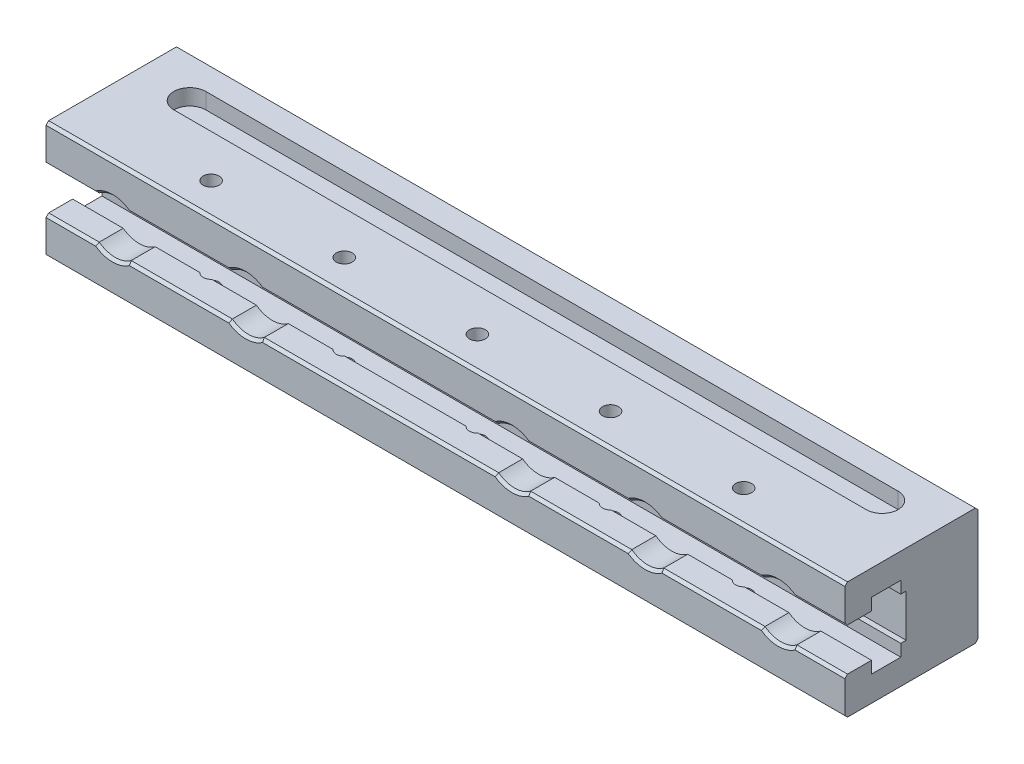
ISO-10303-21;
HEADER;
FILE_DESCRIPTION(('STEP AP214'),'2;1');
FILE_NAME('part.step','',(''),(''),'','','');
FILE_SCHEMA(('AUTOMOTIVE_DESIGN { 1 0 10303 214 1 1 1 1 }'));
ENDSEC;
DATA;
#1=APPLICATION_CONTEXT('core data for automotive mechanical design processes');
#2=APPLICATION_PROTOCOL_DEFINITION('international standard','automotive_design',2000,#1);
#3=PRODUCT_CONTEXT('',#1,'mechanical');
#4=PRODUCT('Part','Part','',(#3));
#5=PRODUCT_RELATED_PRODUCT_CATEGORY('part','',(#4));
#6=PRODUCT_DEFINITION_FORMATION('','',#4);
#7=PRODUCT_DEFINITION_CONTEXT('part definition',#1,'design');
#8=PRODUCT_DEFINITION('design','',#6,#7);
#9=PRODUCT_DEFINITION_SHAPE('','',#8);
#10=(LENGTH_UNIT() NAMED_UNIT(*) SI_UNIT(.MILLI.,.METRE.));
#11=(NAMED_UNIT(*) PLANE_ANGLE_UNIT() SI_UNIT($,.RADIAN.));
#12=(NAMED_UNIT(*) SI_UNIT($,.STERADIAN.) SOLID_ANGLE_UNIT());
#13=UNCERTAINTY_MEASURE_WITH_UNIT(LENGTH_MEASURE(1.E-05),#10,'distance_accuracy_value','');
#14=(GEOMETRIC_REPRESENTATION_CONTEXT(3) GLOBAL_UNCERTAINTY_ASSIGNED_CONTEXT((#13)) GLOBAL_UNIT_ASSIGNED_CONTEXT((#10,
#11,#12)) REPRESENTATION_CONTEXT('',''));
#15=CARTESIAN_POINT('',(0.,0.,0.));
#16=DIRECTION('',(0.,0.,1.));
#17=DIRECTION('',(1.,0.,0.));
#18=AXIS2_PLACEMENT_3D('',#15,#16,#17);
#19=CARTESIAN_POINT('',(-25.,-8.,40.));
#20=DIRECTION('',(0.,0.,1.));
#21=DIRECTION('',(0.,-1.,0.));
#22=AXIS2_PLACEMENT_3D('',#19,#20,#21);
#23=PLANE('',#22);
#24=DIRECTION('',(1.,0.,0.));
#25=VECTOR('',#24,1.);
#26=CARTESIAN_POINT('',(-25.,-8.,40.));
#27=LINE('',#26,#25);
#28=CARTESIAN_POINT('',(22.7639320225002,-8.,40.));
#29=VERTEX_POINT('',#28);
#30=CARTESIAN_POINT('',(6.,-8.,40.));
#31=VERTEX_POINT('',#30);
#32=EDGE_CURVE('E646',#29,#31,#27,.F.);
#33=ORIENTED_EDGE('',*,*,#32,.F.);
#34=DIRECTION('',(0.,-1.,0.));
#35=VECTOR('',#34,1.);
#36=CARTESIAN_POINT('',(22.7639320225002,22.,40.));
#37=LINE('',#36,#35);
#38=CARTESIAN_POINT('',(22.7639320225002,-12.5,40.));
#39=VERTEX_POINT('',#38);
#40=EDGE_CURVE('E633',#29,#39,#37,.T.);
#41=ORIENTED_EDGE('',*,*,#40,.T.);
#42=DIRECTION('',(1.,0.,0.));
#43=VECTOR('',#42,1.);
#44=CARTESIAN_POINT('',(-25.,-12.5,40.));
#45=LINE('',#44,#43);
#46=CARTESIAN_POINT('',(-25.,-12.5,40.));
#47=VERTEX_POINT('',#46);
#48=EDGE_CURVE('E643',#47,#39,#45,.T.);
#49=ORIENTED_EDGE('',*,*,#48,.F.);
#50=DIRECTION('',(0.,-1.,0.));
#51=VECTOR('',#50,1.);
#52=CARTESIAN_POINT('',(-25.,12.4820261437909,40.));
#53=LINE('',#52,#51);
#54=CARTESIAN_POINT('',(-25.,-8.,40.));
#55=VERTEX_POINT('',#54);
#56=EDGE_CURVE('E664',#55,#47,#53,.T.);
#57=ORIENTED_EDGE('',*,*,#56,.F.);
#58=DIRECTION('',(1.,0.,0.));
#59=VECTOR('',#58,1.);
#60=CARTESIAN_POINT('',(-25.,-8.,40.));
#61=LINE('',#60,#59);
#62=CARTESIAN_POINT('',(-6.,-8.,40.));
#63=VERTEX_POINT('',#62);
#64=EDGE_CURVE('E654',#63,#55,#61,.F.);
#65=ORIENTED_EDGE('',*,*,#64,.F.);
#66=CARTESIAN_POINT('',(0.,0.,40.));
#67=DIRECTION('',(0.,0.,-1.));
#68=DIRECTION('',(0.,1.,0.));
#69=AXIS2_PLACEMENT_3D('',#66,#67,#68);
#70=CIRCLE('',#69,10.);
#71=EDGE_CURVE('E658',#31,#63,#70,.T.);
#72=ORIENTED_EDGE('',*,*,#71,.F.);
#73=EDGE_LOOP('',(#33,#41,#49,#57,#65,#72));
#74=FACE_BOUND('',#73,.T.);
#75=ADVANCED_FACE('F14',(#74),#23,.F.);
#76=CARTESIAN_POINT('',(-25.,8.,40.));
#77=DIRECTION('',(0.,0.,-1.));
#78=DIRECTION('',(0.,1.,0.));
#79=AXIS2_PLACEMENT_3D('',#76,#77,#78);
#80=PLANE('',#79);
#81=DIRECTION('',(0.,-1.,0.));
#82=VECTOR('',#81,1.);
#83=CARTESIAN_POINT('',(27.2360679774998,22.,40.));
#84=LINE('',#83,#82);
#85=CARTESIAN_POINT('',(27.2360679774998,12.5,40.));
#86=VERTEX_POINT('',#85);
#87=CARTESIAN_POINT('',(27.2360679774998,8.,40.));
#88=VERTEX_POINT('',#87);
#89=EDGE_CURVE('E2249',#86,#88,#84,.T.);
#90=ORIENTED_EDGE('',*,*,#89,.F.);
#91=DIRECTION('',(1.,0.,0.));
#92=VECTOR('',#91,1.);
#93=CARTESIAN_POINT('',(-25.,12.5,40.));
#94=LINE('',#93,#92);
#95=CARTESIAN_POINT('',(72.7639320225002,12.5,40.));
#96=VERTEX_POINT('',#95);
#97=EDGE_CURVE('E1030',#96,#86,#94,.F.);
#98=ORIENTED_EDGE('',*,*,#97,.F.);
#99=DIRECTION('',(0.,-1.,0.));
#100=VECTOR('',#99,1.);
#101=CARTESIAN_POINT('',(72.7639320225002,22.,40.));
#102=LINE('',#101,#100);
#103=CARTESIAN_POINT('',(72.7639320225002,8.,40.));
#104=VERTEX_POINT('',#103);
#105=EDGE_CURVE('E2269',#104,#96,#102,.F.);
#106=ORIENTED_EDGE('',*,*,#105,.F.);
#107=DIRECTION('',(1.,0.,0.));
#108=VECTOR('',#107,1.);
#109=CARTESIAN_POINT('',(-25.,8.,40.));
#110=LINE('',#109,#108);
#111=CARTESIAN_POINT('',(56.,8.,40.));
#112=VERTEX_POINT('',#111);
#113=EDGE_CURVE('E1062',#104,#112,#110,.F.);
#114=ORIENTED_EDGE('',*,*,#113,.T.);
#115=CARTESIAN_POINT('',(50.,0.,40.));
#116=DIRECTION('',(0.,0.,1.));
#117=DIRECTION('',(0.,-1.,0.));
#118=AXIS2_PLACEMENT_3D('',#115,#116,#117);
#119=CIRCLE('',#118,10.);
#120=CARTESIAN_POINT('',(44.,8.,40.));
#121=VERTEX_POINT('',#120);
#122=EDGE_CURVE('E1060',#112,#121,#119,.T.);
#123=ORIENTED_EDGE('',*,*,#122,.T.);
#124=DIRECTION('',(1.,0.,0.));
#125=VECTOR('',#124,1.);
#126=CARTESIAN_POINT('',(-25.,8.,40.));
#127=LINE('',#126,#125);
#128=EDGE_CURVE('E1053',#121,#88,#127,.F.);
#129=ORIENTED_EDGE('',*,*,#128,.T.);
#130=EDGE_LOOP('',(#90,#98,#106,#114,#123,#129));
#131=FACE_BOUND('',#130,.T.);
#132=ADVANCED_FACE('F1757',(#131),#80,.T.);
#133=DIRECTION('',(1.,0.,0.));
#134=VECTOR('',#133,1.);
#135=CARTESIAN_POINT('',(-25.,-12.5,40.));
#136=LINE('',#135,#134);
#137=CARTESIAN_POINT('',(27.2360679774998,-12.5,40.));
#138=VERTEX_POINT('',#137);
#139=CARTESIAN_POINT('',(72.7639320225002,-12.5,40.));
#140=VERTEX_POINT('',#139);
#141=EDGE_CURVE('E653',#138,#140,#136,.T.);
#142=ORIENTED_EDGE('',*,*,#141,.F.);
#143=DIRECTION('',(0.,-1.,0.));
#144=VECTOR('',#143,1.);
#145=CARTESIAN_POINT('',(27.2360679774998,22.,40.));
#146=LINE('',#145,#144);
#147=CARTESIAN_POINT('',(27.2360679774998,-8.,40.));
#148=VERTEX_POINT('',#147);
#149=EDGE_CURVE('E39',#138,#148,#146,.F.);
#150=ORIENTED_EDGE('',*,*,#149,.T.);
#151=CARTESIAN_POINT('',(44.,-8.,40.));
#152=VERTEX_POINT('',#151);
#153=EDGE_CURVE('E969',#152,#148,#27,.F.);
#154=ORIENTED_EDGE('',*,*,#153,.F.);
#155=CARTESIAN_POINT('',(50.,0.,40.));
#156=DIRECTION('',(0.,0.,-1.));
#157=DIRECTION('',(0.,1.,0.));
#158=AXIS2_PLACEMENT_3D('',#155,#156,#157);
#159=CIRCLE('',#158,10.);
#160=CARTESIAN_POINT('',(56.,-8.,40.));
#161=VERTEX_POINT('',#160);
#162=EDGE_CURVE('E975',#161,#152,#159,.T.);
#163=ORIENTED_EDGE('',*,*,#162,.F.);
#164=DIRECTION('',(1.,0.,0.));
#165=VECTOR('',#164,1.);
#166=CARTESIAN_POINT('',(-25.,-8.,40.));
#167=LINE('',#166,#165);
#168=CARTESIAN_POINT('',(72.7639320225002,-8.,40.));
#169=VERTEX_POINT('',#168);
#170=EDGE_CURVE('E977',#169,#161,#167,.F.);
#171=ORIENTED_EDGE('',*,*,#170,.F.);
#172=DIRECTION('',(0.,-1.,0.));
#173=VECTOR('',#172,1.);
#174=CARTESIAN_POINT('',(72.7639320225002,22.,40.));
#175=LINE('',#174,#173);
#176=EDGE_CURVE('E2261',#169,#140,#175,.T.);
#177=ORIENTED_EDGE('',*,*,#176,.T.);
#178=EDGE_LOOP('',(#142,#150,#154,#163,#171,#177));
#179=FACE_BOUND('',#178,.T.);
#180=ADVANCED_FACE('F1759',(#179),#23,.F.);
#181=DIRECTION('',(0.,-1.,0.));
#182=VECTOR('',#181,1.);
#183=CARTESIAN_POINT('',(77.2360679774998,22.,40.));
#184=LINE('',#183,#182);
#185=CARTESIAN_POINT('',(77.2360679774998,12.5,40.));
#186=VERTEX_POINT('',#185);
#187=CARTESIAN_POINT('',(77.2360679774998,8.,40.));
#188=VERTEX_POINT('',#187);
#189=EDGE_CURVE('E2271',#186,#188,#184,.T.);
#190=ORIENTED_EDGE('',*,*,#189,.F.);
#191=DIRECTION('',(1.,0.,0.));
#192=VECTOR('',#191,1.);
#193=CARTESIAN_POINT('',(-25.,12.5,40.));
#194=LINE('',#193,#192);
#195=CARTESIAN_POINT('',(122.7639320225,12.5,40.));
#196=VERTEX_POINT('',#195);
#197=EDGE_CURVE('E1033',#196,#186,#194,.F.);
#198=ORIENTED_EDGE('',*,*,#197,.F.);
#199=DIRECTION('',(0.,-1.,0.));
#200=VECTOR('',#199,1.);
#201=CARTESIAN_POINT('',(122.7639320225,22.,40.));
#202=LINE('',#201,#200);
#203=CARTESIAN_POINT('',(122.7639320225,8.,40.));
#204=VERTEX_POINT('',#203);
#205=EDGE_CURVE('E1231',#204,#196,#202,.F.);
#206=ORIENTED_EDGE('',*,*,#205,.F.);
#207=EDGE_CURVE('E1061',#204,#188,#110,.F.);
#208=ORIENTED_EDGE('',*,*,#207,.T.);
#209=EDGE_LOOP('',(#190,#198,#206,#208));
#210=FACE_BOUND('',#209,.T.);
#211=ADVANCED_FACE('F1766',(#210),#80,.T.);
#212=DIRECTION('',(1.,0.,0.));
#213=VECTOR('',#212,1.);
#214=CARTESIAN_POINT('',(-25.,-12.5,40.));
#215=LINE('',#214,#213);
#216=CARTESIAN_POINT('',(77.2360679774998,-12.5,40.));
#217=VERTEX_POINT('',#216);
#218=CARTESIAN_POINT('',(122.7639320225,-12.5,40.));
#219=VERTEX_POINT('',#218);
#220=EDGE_CURVE('E656',#217,#219,#215,.T.);
#221=ORIENTED_EDGE('',*,*,#220,.F.);
#222=DIRECTION('',(0.,-1.,0.));
#223=VECTOR('',#222,1.);
#224=CARTESIAN_POINT('',(77.2360679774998,22.,40.));
#225=LINE('',#224,#223);
#226=CARTESIAN_POINT('',(77.2360679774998,-8.,40.));
#227=VERTEX_POINT('',#226);
#228=EDGE_CURVE('E2259',#217,#227,#225,.F.);
#229=ORIENTED_EDGE('',*,*,#228,.T.);
#230=CARTESIAN_POINT('',(122.7639320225,-8.,40.));
#231=VERTEX_POINT('',#230);
#232=EDGE_CURVE('E976',#231,#227,#167,.F.);
#233=ORIENTED_EDGE('',*,*,#232,.F.);
#234=DIRECTION('',(0.,-1.,0.));
#235=VECTOR('',#234,1.);
#236=CARTESIAN_POINT('',(122.7639320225,22.,40.));
#237=LINE('',#236,#235);
#238=EDGE_CURVE('E1215',#231,#219,#237,.T.);
#239=ORIENTED_EDGE('',*,*,#238,.T.);
#240=EDGE_LOOP('',(#221,#229,#233,#239));
#241=FACE_BOUND('',#240,.T.);
#242=ADVANCED_FACE('F1222',(#241),#23,.F.);
#243=DIRECTION('',(0.,-1.,0.));
#244=VECTOR('',#243,1.);
#245=CARTESIAN_POINT('',(127.2360679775,22.,40.));
#246=LINE('',#245,#244);
#247=CARTESIAN_POINT('',(127.2360679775,12.5,40.));
#248=VERTEX_POINT('',#247);
#249=CARTESIAN_POINT('',(127.2360679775,8.,40.));
#250=VERTEX_POINT('',#249);
#251=EDGE_CURVE('E1233',#248,#250,#246,.T.);
#252=ORIENTED_EDGE('',*,*,#251,.F.);
#253=DIRECTION('',(1.,0.,0.));
#254=VECTOR('',#253,1.);
#255=CARTESIAN_POINT('',(-25.,12.5,40.));
#256=LINE('',#255,#254);
#257=CARTESIAN_POINT('',(172.7639320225,12.5,40.));
#258=VERTEX_POINT('',#257);
#259=EDGE_CURVE('E1036',#258,#248,#256,.F.);
#260=ORIENTED_EDGE('',*,*,#259,.F.);
#261=DIRECTION('',(0.,-1.,0.));
#262=VECTOR('',#261,1.);
#263=CARTESIAN_POINT('',(172.7639320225,22.,40.));
#264=LINE('',#263,#262);
#265=CARTESIAN_POINT('',(172.7639320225,8.,40.));
#266=VERTEX_POINT('',#265);
#267=EDGE_CURVE('E1257',#266,#258,#264,.F.);
#268=ORIENTED_EDGE('',*,*,#267,.F.);
#269=DIRECTION('',(1.,0.,0.));
#270=VECTOR('',#269,1.);
#271=CARTESIAN_POINT('',(-25.,8.,40.));
#272=LINE('',#271,#270);
#273=CARTESIAN_POINT('',(156.,8.,40.));
#274=VERTEX_POINT('',#273);
#275=EDGE_CURVE('E1067',#266,#274,#272,.F.);
#276=ORIENTED_EDGE('',*,*,#275,.T.);
#277=CARTESIAN_POINT('',(150.,0.,40.));
#278=DIRECTION('',(0.,0.,1.));
#279=DIRECTION('',(0.,-1.,0.));
#280=AXIS2_PLACEMENT_3D('',#277,#278,#279);
#281=CIRCLE('',#280,10.);
#282=CARTESIAN_POINT('',(144.,8.,40.));
#283=VERTEX_POINT('',#282);
#284=EDGE_CURVE('E1066',#274,#283,#281,.T.);
#285=ORIENTED_EDGE('',*,*,#284,.T.);
#286=EDGE_CURVE('E1057',#283,#250,#110,.F.);
#287=ORIENTED_EDGE('',*,*,#286,.T.);
#288=EDGE_LOOP('',(#252,#260,#268,#276,#285,#287));
#289=FACE_BOUND('',#288,.T.);
#290=ADVANCED_FACE('F1797',(#289),#80,.T.);
#291=DIRECTION('',(1.,0.,0.));
#292=VECTOR('',#291,1.);
#293=CARTESIAN_POINT('',(-25.,-12.5,40.));
#294=LINE('',#293,#292);
#295=CARTESIAN_POINT('',(127.2360679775,-12.5,40.));
#296=VERTEX_POINT('',#295);
#297=CARTESIAN_POINT('',(172.7639320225,-12.5,40.));
#298=VERTEX_POINT('',#297);
#299=EDGE_CURVE('E1201',#296,#298,#294,.T.);
#300=ORIENTED_EDGE('',*,*,#299,.F.);
#301=DIRECTION('',(0.,-1.,0.));
#302=VECTOR('',#301,1.);
#303=CARTESIAN_POINT('',(127.2360679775,22.,40.));
#304=LINE('',#303,#302);
#305=CARTESIAN_POINT('',(127.2360679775,-8.,40.));
#306=VERTEX_POINT('',#305);
#307=EDGE_CURVE('E1218',#296,#306,#304,.F.);
#308=ORIENTED_EDGE('',*,*,#307,.T.);
#309=CARTESIAN_POINT('',(144.,-8.,40.));
#310=VERTEX_POINT('',#309);
#311=EDGE_CURVE('E972',#310,#306,#167,.F.);
#312=ORIENTED_EDGE('',*,*,#311,.F.);
#313=CARTESIAN_POINT('',(150.,0.,40.));
#314=DIRECTION('',(0.,0.,-1.));
#315=DIRECTION('',(0.,1.,0.));
#316=AXIS2_PLACEMENT_3D('',#313,#314,#315);
#317=CIRCLE('',#316,10.);
#318=CARTESIAN_POINT('',(156.,-8.,40.));
#319=VERTEX_POINT('',#318);
#320=EDGE_CURVE('E981',#319,#310,#317,.T.);
#321=ORIENTED_EDGE('',*,*,#320,.F.);
#322=DIRECTION('',(1.,0.,0.));
#323=VECTOR('',#322,1.);
#324=CARTESIAN_POINT('',(-25.,-8.,40.));
#325=LINE('',#324,#323);
#326=CARTESIAN_POINT('',(172.7639320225,-8.,40.));
#327=VERTEX_POINT('',#326);
#328=EDGE_CURVE('E982',#327,#319,#325,.F.);
#329=ORIENTED_EDGE('',*,*,#328,.F.);
#330=DIRECTION('',(0.,-1.,0.));
#331=VECTOR('',#330,1.);
#332=CARTESIAN_POINT('',(172.7639320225,22.,40.));
#333=LINE('',#332,#331);
#334=EDGE_CURVE('E1249',#327,#298,#333,.T.);
#335=ORIENTED_EDGE('',*,*,#334,.T.);
#336=EDGE_LOOP('',(#300,#308,#312,#321,#329,#335));
#337=FACE_BOUND('',#336,.T.);
#338=ADVANCED_FACE('F1786',(#337),#23,.F.);
#339=DIRECTION('',(0.,-1.,0.));
#340=VECTOR('',#339,1.);
#341=CARTESIAN_POINT('',(177.2360679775,22.,40.));
#342=LINE('',#341,#340);
#343=CARTESIAN_POINT('',(177.2360679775,12.5,40.));
#344=VERTEX_POINT('',#343);
#345=CARTESIAN_POINT('',(177.2360679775,8.,40.));
#346=VERTEX_POINT('',#345);
#347=EDGE_CURVE('E1259',#344,#346,#342,.T.);
#348=ORIENTED_EDGE('',*,*,#347,.F.);
#349=DIRECTION('',(1.,0.,0.));
#350=VECTOR('',#349,1.);
#351=CARTESIAN_POINT('',(-25.,12.5,40.));
#352=LINE('',#351,#350);
#353=CARTESIAN_POINT('',(222.7639320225,12.5,40.));
#354=VERTEX_POINT('',#353);
#355=EDGE_CURVE('E1039',#354,#344,#352,.F.);
#356=ORIENTED_EDGE('',*,*,#355,.F.);
#357=DIRECTION('',(0.,-1.,0.));
#358=VECTOR('',#357,1.);
#359=CARTESIAN_POINT('',(222.7639320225,22.,40.));
#360=LINE('',#359,#358);
#361=CARTESIAN_POINT('',(222.7639320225,8.,40.));
#362=VERTEX_POINT('',#361);
#363=EDGE_CURVE('E1283',#362,#354,#360,.F.);
#364=ORIENTED_EDGE('',*,*,#363,.F.);
#365=DIRECTION('',(1.,0.,0.));
#366=VECTOR('',#365,1.);
#367=CARTESIAN_POINT('',(-25.,8.,40.));
#368=LINE('',#367,#366);
#369=CARTESIAN_POINT('',(206.,8.,40.));
#370=VERTEX_POINT('',#369);
#371=EDGE_CURVE('E1045',#362,#370,#368,.F.);
#372=ORIENTED_EDGE('',*,*,#371,.T.);
#373=CARTESIAN_POINT('',(200.,0.,40.));
#374=DIRECTION('',(0.,0.,1.));
#375=DIRECTION('',(0.,-1.,0.));
#376=AXIS2_PLACEMENT_3D('',#373,#374,#375);
#377=CIRCLE('',#376,10.);
#378=CARTESIAN_POINT('',(194.,8.,40.));
#379=VERTEX_POINT('',#378);
#380=EDGE_CURVE('E809',#370,#379,#377,.T.);
#381=ORIENTED_EDGE('',*,*,#380,.T.);
#382=EDGE_CURVE('E1063',#379,#346,#272,.F.);
#383=ORIENTED_EDGE('',*,*,#382,.T.);
#384=EDGE_LOOP('',(#348,#356,#364,#372,#381,#383));
#385=FACE_BOUND('',#384,.T.);
#386=ADVANCED_FACE('F1793',(#385),#80,.T.);
#387=DIRECTION('',(0.,-1.,0.));
#388=VECTOR('',#387,1.);
#389=CARTESIAN_POINT('',(227.2360679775,22.,40.));
#390=LINE('',#389,#388);
#391=CARTESIAN_POINT('',(227.2360679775,12.5,40.));
#392=VERTEX_POINT('',#391);
#393=CARTESIAN_POINT('',(227.2360679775,8.,40.));
#394=VERTEX_POINT('',#393);
#395=EDGE_CURVE('E1285',#392,#394,#390,.T.);
#396=ORIENTED_EDGE('',*,*,#395,.F.);
#397=DIRECTION('',(1.,0.,0.));
#398=VECTOR('',#397,1.);
#399=CARTESIAN_POINT('',(-25.,12.5,40.));
#400=LINE('',#399,#398);
#401=CARTESIAN_POINT('',(275.,12.5,40.));
#402=VERTEX_POINT('',#401);
#403=EDGE_CURVE('E1025',#402,#392,#400,.F.);
#404=ORIENTED_EDGE('',*,*,#403,.F.);
#405=DIRECTION('',(0.,-1.,0.));
#406=VECTOR('',#405,1.);
#407=CARTESIAN_POINT('',(275.,12.4820261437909,40.));
#408=LINE('',#407,#406);
#409=CARTESIAN_POINT('',(275.,8.,40.));
#410=VERTEX_POINT('',#409);
#411=EDGE_CURVE('E789',#410,#402,#408,.F.);
#412=ORIENTED_EDGE('',*,*,#411,.F.);
#413=DIRECTION('',(1.,0.,0.));
#414=VECTOR('',#413,1.);
#415=CARTESIAN_POINT('',(-25.,8.,40.));
#416=LINE('',#415,#414);
#417=CARTESIAN_POINT('',(256.,8.,40.));
#418=VERTEX_POINT('',#417);
#419=EDGE_CURVE('E1046',#410,#418,#416,.F.);
#420=ORIENTED_EDGE('',*,*,#419,.T.);
#421=CARTESIAN_POINT('',(250.,0.,40.));
#422=DIRECTION('',(0.,0.,1.));
#423=DIRECTION('',(0.,-1.,0.));
#424=AXIS2_PLACEMENT_3D('',#421,#422,#423);
#425=CIRCLE('',#424,10.);
#426=CARTESIAN_POINT('',(244.,8.,40.));
#427=VERTEX_POINT('',#426);
#428=EDGE_CURVE('E1049',#418,#427,#425,.T.);
#429=ORIENTED_EDGE('',*,*,#428,.T.);
#430=EDGE_CURVE('E1042',#427,#394,#368,.F.);
#431=ORIENTED_EDGE('',*,*,#430,.T.);
#432=EDGE_LOOP('',(#396,#404,#412,#420,#429,#431));
#433=FACE_BOUND('',#432,.T.);
#434=ADVANCED_FACE('F1784',(#433),#80,.T.);
#435=DIRECTION('',(1.,0.,0.));
#436=VECTOR('',#435,1.);
#437=CARTESIAN_POINT('',(-25.,-12.5,40.));
#438=LINE('',#437,#436);
#439=CARTESIAN_POINT('',(177.2360679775,-12.5,40.));
#440=VERTEX_POINT('',#439);
#441=CARTESIAN_POINT('',(222.7639320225,-12.5,40.));
#442=VERTEX_POINT('',#441);
#443=EDGE_CURVE('E1197',#440,#442,#438,.T.);
#444=ORIENTED_EDGE('',*,*,#443,.F.);
#445=DIRECTION('',(0.,-1.,0.));
#446=VECTOR('',#445,1.);
#447=CARTESIAN_POINT('',(177.2360679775,22.,40.));
#448=LINE('',#447,#446);
#449=CARTESIAN_POINT('',(177.2360679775,-8.,40.));
#450=VERTEX_POINT('',#449);
#451=EDGE_CURVE('E1246',#440,#450,#448,.F.);
#452=ORIENTED_EDGE('',*,*,#451,.T.);
#453=CARTESIAN_POINT('',(194.,-8.,40.));
#454=VERTEX_POINT('',#453);
#455=EDGE_CURVE('E978',#454,#450,#325,.F.);
#456=ORIENTED_EDGE('',*,*,#455,.F.);
#457=CARTESIAN_POINT('',(200.,0.,40.));
#458=DIRECTION('',(0.,0.,-1.));
#459=DIRECTION('',(0.,1.,0.));
#460=AXIS2_PLACEMENT_3D('',#457,#458,#459);
#461=CIRCLE('',#460,10.);
#462=CARTESIAN_POINT('',(206.,-8.,40.));
#463=VERTEX_POINT('',#462);
#464=EDGE_CURVE('E966',#463,#454,#461,.T.);
#465=ORIENTED_EDGE('',*,*,#464,.F.);
#466=DIRECTION('',(1.,0.,0.));
#467=VECTOR('',#466,1.);
#468=CARTESIAN_POINT('',(-25.,-8.,40.));
#469=LINE('',#468,#467);
#470=CARTESIAN_POINT('',(222.7639320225,-8.,40.));
#471=VERTEX_POINT('',#470);
#472=EDGE_CURVE('E967',#471,#463,#469,.F.);
#473=ORIENTED_EDGE('',*,*,#472,.F.);
#474=DIRECTION('',(0.,-1.,0.));
#475=VECTOR('',#474,1.);
#476=CARTESIAN_POINT('',(222.7639320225,22.,40.));
#477=LINE('',#476,#475);
#478=EDGE_CURVE('E1278',#471,#442,#477,.T.);
#479=ORIENTED_EDGE('',*,*,#478,.T.);
#480=EDGE_LOOP('',(#444,#452,#456,#465,#473,#479));
#481=FACE_BOUND('',#480,.T.);
#482=ADVANCED_FACE('F1775',(#481),#23,.F.);
#483=CARTESIAN_POINT('',(125.,16.,16.));
#484=DIRECTION('',(0.,-1.,0.));
#485=DIRECTION('',(0.,0.,-1.));
#486=AXIS2_PLACEMENT_3D('',#483,#484,#485);
#487=PLANE('',#486);
#488=DIRECTION('',(1.,0.,0.));
#489=VECTOR('',#488,1.);
#490=CARTESIAN_POINT('',(-5.,16.,10.));
#491=LINE('',#490,#489);
#492=CARTESIAN_POINT('',(255.,16.,10.));
#493=VERTEX_POINT('',#492);
#494=CARTESIAN_POINT('',(-5.,16.,10.));
#495=VERTEX_POINT('',#494);
#496=EDGE_CURVE('E1289',#493,#495,#491,.F.);
#497=ORIENTED_EDGE('',*,*,#496,.T.);
#498=CARTESIAN_POINT('',(-5.,16.,16.));
#499=DIRECTION('',(0.,-1.,0.));
#500=DIRECTION('',(0.,0.,-1.));
#501=AXIS2_PLACEMENT_3D('',#498,#499,#500);
#502=CIRCLE('',#501,6.);
#503=CARTESIAN_POINT('',(-5.,16.,22.));
#504=VERTEX_POINT('',#503);
#505=EDGE_CURVE('E1408',#495,#504,#502,.F.);
#506=ORIENTED_EDGE('',*,*,#505,.T.);
#507=DIRECTION('',(-1.,0.,0.));
#508=VECTOR('',#507,1.);
#509=CARTESIAN_POINT('',(255.,16.,22.));
#510=LINE('',#509,#508);
#511=CARTESIAN_POINT('',(255.,16.,22.));
#512=VERTEX_POINT('',#511);
#513=EDGE_CURVE('E1422',#504,#512,#510,.F.);
#514=ORIENTED_EDGE('',*,*,#513,.T.);
#515=CARTESIAN_POINT('',(255.,16.,16.));
#516=DIRECTION('',(0.,-1.,0.));
#517=DIRECTION('',(0.,0.,-1.));
#518=AXIS2_PLACEMENT_3D('',#515,#516,#517);
#519=CIRCLE('',#518,6.00000000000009);
#520=EDGE_CURVE('E18',#512,#493,#519,.F.);
#521=ORIENTED_EDGE('',*,*,#520,.T.);
#522=EDGE_LOOP('',(#497,#506,#514,#521));
#523=FACE_BOUND('',#522,.T.);
#524=ADVANCED_FACE('F16',(#523),#487,.F.);
#525=CARTESIAN_POINT('',(125.,-16.,16.));
#526=DIRECTION('',(0.,-1.,0.));
#527=DIRECTION('',(0.,0.,-1.));
#528=AXIS2_PLACEMENT_3D('',#525,#526,#527);
#529=PLANE('',#528);
#530=CARTESIAN_POINT('',(-5.,-16.,16.));
#531=DIRECTION('',(0.,-1.,0.));
#532=DIRECTION('',(0.,0.,-1.));
#533=AXIS2_PLACEMENT_3D('',#530,#531,#532);
#534=CIRCLE('',#533,6.);
#535=CARTESIAN_POINT('',(-5.,-16.,22.));
#536=VERTEX_POINT('',#535);
#537=CARTESIAN_POINT('',(-5.,-16.,10.));
#538=VERTEX_POINT('',#537);
#539=EDGE_CURVE('E1111',#536,#538,#534,.T.);
#540=ORIENTED_EDGE('',*,*,#539,.T.);
#541=DIRECTION('',(-1.,0.,0.));
#542=VECTOR('',#541,1.);
#543=CARTESIAN_POINT('',(-5.,-16.,10.));
#544=LINE('',#543,#542);
#545=CARTESIAN_POINT('',(255.,-16.,10.));
#546=VERTEX_POINT('',#545);
#547=EDGE_CURVE('E1107',#546,#538,#544,.T.);
#548=ORIENTED_EDGE('',*,*,#547,.F.);
#549=CARTESIAN_POINT('',(255.,-16.,16.));
#550=DIRECTION('',(0.,-1.,0.));
#551=DIRECTION('',(0.,0.,-1.));
#552=AXIS2_PLACEMENT_3D('',#549,#550,#551);
#553=CIRCLE('',#552,6.00000000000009);
#554=CARTESIAN_POINT('',(255.,-16.,22.));
#555=VERTEX_POINT('',#554);
#556=EDGE_CURVE('E1121',#546,#555,#553,.T.);
#557=ORIENTED_EDGE('',*,*,#556,.T.);
#558=DIRECTION('',(1.,0.,0.));
#559=VECTOR('',#558,1.);
#560=CARTESIAN_POINT('',(255.,-16.,22.));
#561=LINE('',#560,#559);
#562=EDGE_CURVE('E1118',#536,#555,#561,.T.);
#563=ORIENTED_EDGE('',*,*,#562,.F.);
#564=EDGE_LOOP('',(#540,#548,#557,#563));
#565=FACE_BOUND('',#564,.T.);
#566=ADVANCED_FACE('F1791',(#565),#529,.T.);
#567=CARTESIAN_POINT('',(-25.,8.,27.));
#568=DIRECTION('',(0.,0.,1.));
#569=DIRECTION('',(0.,-1.,0.));
#570=AXIS2_PLACEMENT_3D('',#567,#568,#569);
#571=PLANE('',#570);
#572=CARTESIAN_POINT('',(150.,0.,27.));
#573=DIRECTION('',(0.,0.,1.));
#574=DIRECTION('',(0.,-1.,0.));
#575=AXIS2_PLACEMENT_3D('',#572,#573,#574);
#576=CIRCLE('',#575,10.);
#577=CARTESIAN_POINT('',(156.,8.,27.));
#578=VERTEX_POINT('',#577);
#579=CARTESIAN_POINT('',(156.,-8.,27.));
#580=VERTEX_POINT('',#579);
#581=EDGE_CURVE('E704',#578,#580,#576,.F.);
#582=ORIENTED_EDGE('',*,*,#581,.T.);
#583=DIRECTION('',(1.,0.,0.));
#584=VECTOR('',#583,1.);
#585=CARTESIAN_POINT('',(-25.,-8.,27.));
#586=LINE('',#585,#584);
#587=CARTESIAN_POINT('',(194.,-8.,27.));
#588=VERTEX_POINT('',#587);
#589=EDGE_CURVE('E686',#580,#588,#586,.T.);
#590=ORIENTED_EDGE('',*,*,#589,.T.);
#591=CARTESIAN_POINT('',(200.,0.,27.));
#592=DIRECTION('',(0.,0.,1.));
#593=DIRECTION('',(0.,-1.,0.));
#594=AXIS2_PLACEMENT_3D('',#591,#592,#593);
#595=CIRCLE('',#594,10.);
#596=CARTESIAN_POINT('',(194.,8.,27.));
#597=VERTEX_POINT('',#596);
#598=EDGE_CURVE('E693',#588,#597,#595,.F.);
#599=ORIENTED_EDGE('',*,*,#598,.T.);
#600=DIRECTION('',(1.,0.,0.));
#601=VECTOR('',#600,1.);
#602=CARTESIAN_POINT('',(-25.,8.,27.));
#603=LINE('',#602,#601);
#604=EDGE_CURVE('E1447',#578,#597,#603,.T.);
#605=ORIENTED_EDGE('',*,*,#604,.F.);
#606=EDGE_LOOP('',(#582,#590,#599,#605));
#607=FACE_BOUND('',#606,.T.);
#608=ADVANCED_FACE('F1550',(#607),#571,.T.);
#609=CARTESIAN_POINT('',(-25.,8.,27.));
#610=DIRECTION('',(0.,0.,1.));
#611=DIRECTION('',(0.,-1.,0.));
#612=AXIS2_PLACEMENT_3D('',#609,#610,#611);
#613=PLANE('',#612);
#614=CARTESIAN_POINT('',(50.,0.,27.));
#615=DIRECTION('',(0.,0.,1.));
#616=DIRECTION('',(0.,-1.,0.));
#617=AXIS2_PLACEMENT_3D('',#614,#615,#616);
#618=CIRCLE('',#617,10.);
#619=CARTESIAN_POINT('',(56.,8.,27.));
#620=VERTEX_POINT('',#619);
#621=CARTESIAN_POINT('',(56.,-8.,27.));
#622=VERTEX_POINT('',#621);
#623=EDGE_CURVE('E767',#620,#622,#618,.F.);
#624=ORIENTED_EDGE('',*,*,#623,.T.);
#625=DIRECTION('',(1.,0.,0.));
#626=VECTOR('',#625,1.);
#627=CARTESIAN_POINT('',(-25.,-8.,27.));
#628=LINE('',#627,#626);
#629=CARTESIAN_POINT('',(144.,-8.,27.));
#630=VERTEX_POINT('',#629);
#631=EDGE_CURVE('E1444',#622,#630,#628,.T.);
#632=ORIENTED_EDGE('',*,*,#631,.T.);
#633=CARTESIAN_POINT('',(150.,0.,27.));
#634=DIRECTION('',(0.,0.,1.));
#635=DIRECTION('',(0.,-1.,0.));
#636=AXIS2_PLACEMENT_3D('',#633,#634,#635);
#637=CIRCLE('',#636,10.);
#638=CARTESIAN_POINT('',(144.,8.,27.));
#639=VERTEX_POINT('',#638);
#640=EDGE_CURVE('E700',#630,#639,#637,.F.);
#641=ORIENTED_EDGE('',*,*,#640,.T.);
#642=DIRECTION('',(1.,0.,0.));
#643=VECTOR('',#642,1.);
#644=CARTESIAN_POINT('',(-25.,8.,27.));
#645=LINE('',#644,#643);
#646=EDGE_CURVE('E1441',#620,#639,#645,.T.);
#647=ORIENTED_EDGE('',*,*,#646,.F.);
#648=EDGE_LOOP('',(#624,#632,#641,#647));
#649=FACE_BOUND('',#648,.T.);
#650=ADVANCED_FACE('F1932',(#649),#613,.T.);
#651=CARTESIAN_POINT('',(-25.,8.,27.));
#652=DIRECTION('',(0.,0.,1.));
#653=DIRECTION('',(0.,-1.,0.));
#654=AXIS2_PLACEMENT_3D('',#651,#652,#653);
#655=PLANE('',#654);
#656=CARTESIAN_POINT('',(250.,0.,27.));
#657=DIRECTION('',(0.,0.,1.));
#658=DIRECTION('',(0.,-1.,0.));
#659=AXIS2_PLACEMENT_3D('',#656,#657,#658);
#660=CIRCLE('',#659,10.);
#661=CARTESIAN_POINT('',(244.,-8.,27.));
#662=VERTEX_POINT('',#661);
#663=CARTESIAN_POINT('',(244.,8.,27.));
#664=VERTEX_POINT('',#663);
#665=EDGE_CURVE('E711',#662,#664,#660,.F.);
#666=ORIENTED_EDGE('',*,*,#665,.T.);
#667=DIRECTION('',(1.,0.,0.));
#668=VECTOR('',#667,1.);
#669=CARTESIAN_POINT('',(-25.,8.,27.));
#670=LINE('',#669,#668);
#671=CARTESIAN_POINT('',(206.,8.,27.));
#672=VERTEX_POINT('',#671);
#673=EDGE_CURVE('E802',#672,#664,#670,.T.);
#674=ORIENTED_EDGE('',*,*,#673,.F.);
#675=CARTESIAN_POINT('',(200.,0.,27.));
#676=DIRECTION('',(0.,0.,1.));
#677=DIRECTION('',(0.,-1.,0.));
#678=AXIS2_PLACEMENT_3D('',#675,#676,#677);
#679=CIRCLE('',#678,10.);
#680=CARTESIAN_POINT('',(206.,-8.,27.));
#681=VERTEX_POINT('',#680);
#682=EDGE_CURVE('E697',#672,#681,#679,.F.);
#683=ORIENTED_EDGE('',*,*,#682,.T.);
#684=DIRECTION('',(1.,0.,0.));
#685=VECTOR('',#684,1.);
#686=CARTESIAN_POINT('',(-25.,-8.,27.));
#687=LINE('',#686,#685);
#688=EDGE_CURVE('E1445',#681,#662,#687,.T.);
#689=ORIENTED_EDGE('',*,*,#688,.T.);
#690=EDGE_LOOP('',(#666,#674,#683,#689));
#691=FACE_BOUND('',#690,.T.);
#692=ADVANCED_FACE('F1566',(#691),#655,.T.);
#693=CARTESIAN_POINT('',(-25.,8.,27.));
#694=DIRECTION('',(0.,0.,1.));
#695=DIRECTION('',(0.,-1.,0.));
#696=AXIS2_PLACEMENT_3D('',#693,#694,#695);
#697=PLANE('',#696);
#698=CARTESIAN_POINT('',(0.,0.,27.));
#699=DIRECTION('',(0.,0.,1.));
#700=DIRECTION('',(0.,-1.,0.));
#701=AXIS2_PLACEMENT_3D('',#698,#699,#700);
#702=CIRCLE('',#701,10.);
#703=CARTESIAN_POINT('',(6.,8.,27.));
#704=VERTEX_POINT('',#703);
#705=CARTESIAN_POINT('',(6.,-8.,27.));
#706=VERTEX_POINT('',#705);
#707=EDGE_CURVE('E671',#704,#706,#702,.F.);
#708=ORIENTED_EDGE('',*,*,#707,.T.);
#709=DIRECTION('',(1.,0.,0.));
#710=VECTOR('',#709,1.);
#711=CARTESIAN_POINT('',(-25.,-8.,27.));
#712=LINE('',#711,#710);
#713=CARTESIAN_POINT('',(44.,-8.,27.));
#714=VERTEX_POINT('',#713);
#715=EDGE_CURVE('E1442',#706,#714,#712,.T.);
#716=ORIENTED_EDGE('',*,*,#715,.T.);
#717=CARTESIAN_POINT('',(50.,0.,27.));
#718=DIRECTION('',(0.,0.,1.));
#719=DIRECTION('',(0.,-1.,0.));
#720=AXIS2_PLACEMENT_3D('',#717,#718,#719);
#721=CIRCLE('',#720,10.);
#722=CARTESIAN_POINT('',(44.,8.,27.));
#723=VERTEX_POINT('',#722);
#724=EDGE_CURVE('E707',#714,#723,#721,.F.);
#725=ORIENTED_EDGE('',*,*,#724,.T.);
#726=DIRECTION('',(1.,0.,0.));
#727=VECTOR('',#726,1.);
#728=CARTESIAN_POINT('',(-25.,8.,27.));
#729=LINE('',#728,#727);
#730=EDGE_CURVE('E1438',#704,#723,#729,.T.);
#731=ORIENTED_EDGE('',*,*,#730,.F.);
#732=EDGE_LOOP('',(#708,#716,#725,#731));
#733=FACE_BOUND('',#732,.T.);
#734=ADVANCED_FACE('F1926',(#733),#697,.T.);
#735=CARTESIAN_POINT('',(-5.,22.,10.));
#736=DIRECTION('',(0.,0.,-1.));
#737=DIRECTION('',(1.,0.,0.));
#738=AXIS2_PLACEMENT_3D('',#735,#736,#737);
#739=PLANE('',#738);
#740=DIRECTION('',(0.,-1.,0.));
#741=VECTOR('',#740,1.);
#742=CARTESIAN_POINT('',(-5.,22.,10.0000000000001));
#743=LINE('',#742,#741);
#744=CARTESIAN_POINT('',(-5.,22.,10.0000000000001));
#745=VERTEX_POINT('',#744);
#746=EDGE_CURVE('E1410',#745,#495,#743,.T.);
#747=ORIENTED_EDGE('',*,*,#746,.T.);
#748=ORIENTED_EDGE('',*,*,#496,.F.);
#749=DIRECTION('',(0.,-1.,0.));
#750=VECTOR('',#749,1.);
#751=CARTESIAN_POINT('',(255.,22.,10.));
#752=LINE('',#751,#750);
#753=CARTESIAN_POINT('',(255.,22.,10.));
#754=VERTEX_POINT('',#753);
#755=EDGE_CURVE('E1426',#493,#754,#752,.F.);
#756=ORIENTED_EDGE('',*,*,#755,.T.);
#757=DIRECTION('',(1.,0.,0.));
#758=VECTOR('',#757,1.);
#759=CARTESIAN_POINT('',(-25.,22.,10.));
#760=LINE('',#759,#758);
#761=EDGE_CURVE('E1098',#745,#754,#760,.T.);
#762=ORIENTED_EDGE('',*,*,#761,.F.);
#763=EDGE_LOOP('',(#747,#748,#756,#762));
#764=FACE_BOUND('',#763,.T.);
#765=ADVANCED_FACE('F1922',(#764),#739,.F.);
#766=CARTESIAN_POINT('',(255.,22.,16.));
#767=DIRECTION('',(0.,-1.,0.));
#768=DIRECTION('',(0.,0.,-1.));
#769=AXIS2_PLACEMENT_3D('',#766,#767,#768);
#770=CYLINDRICAL_SURFACE('',#769,6.00000000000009);
#771=ORIENTED_EDGE('',*,*,#755,.F.);
#772=ORIENTED_EDGE('',*,*,#520,.F.);
#773=DIRECTION('',(0.,-1.,0.));
#774=VECTOR('',#773,1.);
#775=CARTESIAN_POINT('',(255.,22.,22.));
#776=LINE('',#775,#774);
#777=CARTESIAN_POINT('',(255.,22.,22.));
#778=VERTEX_POINT('',#777);
#779=EDGE_CURVE('E1417',#512,#778,#776,.F.);
#780=ORIENTED_EDGE('',*,*,#779,.T.);
#781=CARTESIAN_POINT('',(255.,22.,16.));
#782=DIRECTION('',(0.,-1.,0.));
#783=DIRECTION('',(0.,0.,-1.));
#784=AXIS2_PLACEMENT_3D('',#781,#782,#783);
#785=CIRCLE('',#784,6.00000000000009);
#786=EDGE_CURVE('E1097',#754,#778,#785,.T.);
#787=ORIENTED_EDGE('',*,*,#786,.F.);
#788=EDGE_LOOP('',(#771,#772,#780,#787));
#789=FACE_BOUND('',#788,.T.);
#790=ADVANCED_FACE('F1918',(#789),#770,.F.);
#791=CARTESIAN_POINT('',(255.,22.,22.));
#792=DIRECTION('',(0.,0.,1.));
#793=DIRECTION('',(-1.,0.,0.));
#794=AXIS2_PLACEMENT_3D('',#791,#792,#793);
#795=PLANE('',#794);
#796=ORIENTED_EDGE('',*,*,#779,.F.);
#797=ORIENTED_EDGE('',*,*,#513,.F.);
#798=DIRECTION('',(0.,-1.,0.));
#799=VECTOR('',#798,1.);
#800=CARTESIAN_POINT('',(-5.,22.,22.));
#801=LINE('',#800,#799);
#802=CARTESIAN_POINT('',(-5.,22.,22.));
#803=VERTEX_POINT('',#802);
#804=EDGE_CURVE('E1409',#504,#803,#801,.F.);
#805=ORIENTED_EDGE('',*,*,#804,.T.);
#806=DIRECTION('',(1.,0.,0.));
#807=VECTOR('',#806,1.);
#808=CARTESIAN_POINT('',(-25.,22.,22.));
#809=LINE('',#808,#807);
#810=EDGE_CURVE('E1094',#778,#803,#809,.F.);
#811=ORIENTED_EDGE('',*,*,#810,.F.);
#812=EDGE_LOOP('',(#796,#797,#805,#811));
#813=FACE_BOUND('',#812,.T.);
#814=ADVANCED_FACE('F1914',(#813),#795,.F.);
#815=CARTESIAN_POINT('',(-5.,22.,16.));
#816=DIRECTION('',(0.,-1.,0.));
#817=DIRECTION('',(0.,0.,-1.));
#818=AXIS2_PLACEMENT_3D('',#815,#816,#817);
#819=CYLINDRICAL_SURFACE('',#818,6.);
#820=ORIENTED_EDGE('',*,*,#804,.F.);
#821=ORIENTED_EDGE('',*,*,#505,.F.);
#822=ORIENTED_EDGE('',*,*,#746,.F.);
#823=CARTESIAN_POINT('',(-5.,22.,16.));
#824=DIRECTION('',(0.,-1.,0.));
#825=DIRECTION('',(0.,0.,-1.));
#826=AXIS2_PLACEMENT_3D('',#823,#824,#825);
#827=CIRCLE('',#826,6.);
#828=EDGE_CURVE('E1093',#803,#745,#827,.T.);
#829=ORIENTED_EDGE('',*,*,#828,.F.);
#830=EDGE_LOOP('',(#820,#821,#822,#829));
#831=FACE_BOUND('',#830,.T.);
#832=ADVANCED_FACE('F1911',(#831),#819,.F.);
#833=CARTESIAN_POINT('',(-25.,21.5,49.5));
#834=DIRECTION('',(0.,0.707106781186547,0.707106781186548));
#835=DIRECTION('',(0.,-0.707106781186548,0.707106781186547));
#836=AXIS2_PLACEMENT_3D('',#833,#834,#835);
#837=PLANE('',#836);
#838=DIRECTION('',(0.,-0.707106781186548,0.707106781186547));
#839=VECTOR('',#838,1.);
#840=CARTESIAN_POINT('',(-25.,21.5,49.5));
#841=LINE('',#840,#839);
#842=CARTESIAN_POINT('',(-25.,22.,49.));
#843=VERTEX_POINT('',#842);
#844=CARTESIAN_POINT('',(-25.,21.,50.));
#845=VERTEX_POINT('',#844);
#846=EDGE_CURVE('E1882',#843,#845,#841,.T.);
#847=ORIENTED_EDGE('',*,*,#846,.T.);
#848=DIRECTION('',(1.,0.,0.));
#849=VECTOR('',#848,1.);
#850=CARTESIAN_POINT('',(-25.,21.,50.));
#851=LINE('',#850,#849);
#852=CARTESIAN_POINT('',(275.,21.,50.));
#853=VERTEX_POINT('',#852);
#854=EDGE_CURVE('E1090',#853,#845,#851,.F.);
#855=ORIENTED_EDGE('',*,*,#854,.F.);
#856=DIRECTION('',(0.,-0.707106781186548,0.707106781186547));
#857=VECTOR('',#856,1.);
#858=CARTESIAN_POINT('',(275.,21.5,49.5));
#859=LINE('',#858,#857);
#860=CARTESIAN_POINT('',(275.,22.,49.));
#861=VERTEX_POINT('',#860);
#862=EDGE_CURVE('E1414',#853,#861,#859,.F.);
#863=ORIENTED_EDGE('',*,*,#862,.T.);
#864=DIRECTION('',(1.,0.,0.));
#865=VECTOR('',#864,1.);
#866=CARTESIAN_POINT('',(-25.,22.,49.));
#867=LINE('',#866,#865);
#868=EDGE_CURVE('E817',#843,#861,#867,.T.);
#869=ORIENTED_EDGE('',*,*,#868,.F.);
#870=EDGE_LOOP('',(#847,#855,#863,#869));
#871=FACE_BOUND('',#870,.T.);
#872=ADVANCED_FACE('F1880',(#871),#837,.T.);
#873=CARTESIAN_POINT('',(-25.,8.5,49.5));
#874=DIRECTION('',(0.,-0.707106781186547,0.707106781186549));
#875=DIRECTION('',(0.,-0.707106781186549,-0.707106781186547));
#876=AXIS2_PLACEMENT_3D('',#873,#874,#875);
#877=PLANE('',#876);
#878=DIRECTION('',(1.,0.,0.));
#879=VECTOR('',#878,1.);
#880=CARTESIAN_POINT('',(-25.,8.,49.));
#881=LINE('',#880,#879);
#882=CARTESIAN_POINT('',(-6.,8.,49.));
#883=VERTEX_POINT('',#882);
#884=CARTESIAN_POINT('',(-25.,8.,49.));
#885=VERTEX_POINT('',#884);
#886=EDGE_CURVE('E818',#883,#885,#881,.F.);
#887=ORIENTED_EDGE('',*,*,#886,.F.);
#888=CARTESIAN_POINT('',(-5.99999999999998,8.,49.));
#889=CARTESIAN_POINT('',(-6.16227766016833,8.48683298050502,49.486832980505));
#890=CARTESIAN_POINT('',(-6.32455532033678,9.,50.));
#891=B_SPLINE_CURVE_WITH_KNOTS('',2,(#888,#889,#890),.UNSPECIFIED.,.F.,.F.,(3,3),(0.,1.),.UNSPECIFIED.);
#892=CARTESIAN_POINT('',(-6.32455532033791,9.,49.9999999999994));
#893=VERTEX_POINT('',#892);
#894=EDGE_CURVE('E1889',#883,#893,#891,.T.);
#895=ORIENTED_EDGE('',*,*,#894,.T.);
#896=DIRECTION('',(1.,0.,0.));
#897=VECTOR('',#896,1.);
#898=CARTESIAN_POINT('',(-25.,9.,50.));
#899=LINE('',#898,#897);
#900=CARTESIAN_POINT('',(-25.,9.,50.));
#901=VERTEX_POINT('',#900);
#902=EDGE_CURVE('E1087',#901,#893,#899,.T.);
#903=ORIENTED_EDGE('',*,*,#902,.F.);
#904=DIRECTION('',(0.,-0.707106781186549,-0.707106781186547));
#905=VECTOR('',#904,1.);
#906=CARTESIAN_POINT('',(-25.,8.5,49.5));
#907=LINE('',#906,#905);
#908=EDGE_CURVE('E1883',#901,#885,#907,.T.);
#909=ORIENTED_EDGE('',*,*,#908,.T.);
#910=EDGE_LOOP('',(#887,#895,#903,#909));
#911=FACE_BOUND('',#910,.T.);
#912=ADVANCED_FACE('F1897',(#911),#877,.T.);
#913=CARTESIAN_POINT('',(0.,0.,49.9999999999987));
#914=DIRECTION('',(0.,0.,1.));
#915=DIRECTION('',(-1.,0.,0.));
#916=AXIS2_PLACEMENT_3D('',#913,#914,#915);
#917=CONICAL_SURFACE('',#916,11.0000000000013,0.785398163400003);
#918=CARTESIAN_POINT('',(6.32455532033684,9.,50.));
#919=CARTESIAN_POINT('',(6.16227766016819,8.48683298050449,49.4868329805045));
#920=CARTESIAN_POINT('',(6.00000000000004,8.,49.));
#921=B_SPLINE_CURVE_WITH_KNOTS('',2,(#918,#919,#920),.UNSPECIFIED.,.F.,.F.,(3,3),(0.,1.),.UNSPECIFIED.);
#922=CARTESIAN_POINT('',(6.32455532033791,9.,49.9999999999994));
#923=VERTEX_POINT('',#922);
#924=CARTESIAN_POINT('',(6.,8.,49.));
#925=VERTEX_POINT('',#924);
#926=EDGE_CURVE('E1893',#923,#925,#921,.T.);
#927=ORIENTED_EDGE('',*,*,#926,.F.);
#928=CARTESIAN_POINT('',(0.,0.,49.9999999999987));
#929=DIRECTION('',(0.,0.,1.));
#930=DIRECTION('',(-1.,0.,0.));
#931=AXIS2_PLACEMENT_3D('',#928,#929,#930);
#932=CIRCLE('',#931,11.0000000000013);
#933=EDGE_CURVE('E1086',#893,#923,#932,.F.);
#934=ORIENTED_EDGE('',*,*,#933,.F.);
#935=ORIENTED_EDGE('',*,*,#894,.F.);
#936=CARTESIAN_POINT('',(0.,0.,49.));
#937=DIRECTION('',(0.,0.,1.));
#938=DIRECTION('',(0.,-1.,0.));
#939=AXIS2_PLACEMENT_3D('',#936,#937,#938);
#940=CIRCLE('',#939,10.);
#941=EDGE_CURVE('E825',#883,#925,#940,.F.);
#942=ORIENTED_EDGE('',*,*,#941,.T.);
#943=EDGE_LOOP('',(#927,#934,#935,#942));
#944=FACE_BOUND('',#943,.T.);
#945=ADVANCED_FACE('F1907',(#944),#917,.F.);
#946=CARTESIAN_POINT('',(-25.,8.5,49.5));
#947=DIRECTION('',(0.,-0.707106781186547,0.707106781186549));
#948=DIRECTION('',(0.,-0.707106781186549,-0.707106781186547));
#949=AXIS2_PLACEMENT_3D('',#946,#947,#948);
#950=PLANE('',#949);
#951=DIRECTION('',(1.,0.,0.));
#952=VECTOR('',#951,1.);
#953=CARTESIAN_POINT('',(-25.,9.,50.));
#954=LINE('',#953,#952);
#955=CARTESIAN_POINT('',(43.6754446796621,9.,49.9999999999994));
#956=VERTEX_POINT('',#955);
#957=EDGE_CURVE('E1083',#923,#956,#954,.T.);
#958=ORIENTED_EDGE('',*,*,#957,.F.);
#959=ORIENTED_EDGE('',*,*,#926,.T.);
#960=DIRECTION('',(1.,0.,0.));
#961=VECTOR('',#960,1.);
#962=CARTESIAN_POINT('',(-25.,8.,49.));
#963=LINE('',#962,#961);
#964=CARTESIAN_POINT('',(44.,8.,49.));
#965=VERTEX_POINT('',#964);
#966=EDGE_CURVE('E829',#965,#925,#963,.F.);
#967=ORIENTED_EDGE('',*,*,#966,.F.);
#968=CARTESIAN_POINT('',(44.0000000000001,8.,49.));
#969=CARTESIAN_POINT('',(43.8377223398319,8.48683298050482,49.4868329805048));
#970=CARTESIAN_POINT('',(43.6754446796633,9.,50.));
#971=B_SPLINE_CURVE_WITH_KNOTS('',2,(#968,#969,#970),.UNSPECIFIED.,.F.,.F.,(3,3),(0.,1.),.UNSPECIFIED.);
#972=EDGE_CURVE('E2784',#965,#956,#971,.T.);
#973=ORIENTED_EDGE('',*,*,#972,.T.);
#974=EDGE_LOOP('',(#958,#959,#967,#973));
#975=FACE_BOUND('',#974,.T.);
#976=ADVANCED_FACE('F2558',(#975),#950,.T.);
#977=CARTESIAN_POINT('',(50.,0.,49.9999999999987));
#978=DIRECTION('',(0.,0.,1.));
#979=DIRECTION('',(-1.,0.,0.));
#980=AXIS2_PLACEMENT_3D('',#977,#978,#979);
#981=CONICAL_SURFACE('',#980,11.0000000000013,0.785398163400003);
#982=CARTESIAN_POINT('',(56.3245553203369,9.,50.));
#983=CARTESIAN_POINT('',(56.1622776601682,8.48683298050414,49.4868329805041));
#984=CARTESIAN_POINT('',(56.0000000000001,8.,49.));
#985=B_SPLINE_CURVE_WITH_KNOTS('',2,(#982,#983,#984),.UNSPECIFIED.,.F.,.F.,(3,3),(0.,1.),.UNSPECIFIED.);
#986=CARTESIAN_POINT('',(56.3245553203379,9.,49.9999999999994));
#987=VERTEX_POINT('',#986);
#988=CARTESIAN_POINT('',(56.,8.,49.));
#989=VERTEX_POINT('',#988);
#990=EDGE_CURVE('E2781',#987,#989,#985,.T.);
#991=ORIENTED_EDGE('',*,*,#990,.F.);
#992=CARTESIAN_POINT('',(50.,0.,49.9999999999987));
#993=DIRECTION('',(0.,0.,1.));
#994=DIRECTION('',(-1.,0.,0.));
#995=AXIS2_PLACEMENT_3D('',#992,#993,#994);
#996=CIRCLE('',#995,11.0000000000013);
#997=EDGE_CURVE('E1082',#956,#987,#996,.F.);
#998=ORIENTED_EDGE('',*,*,#997,.F.);
#999=ORIENTED_EDGE('',*,*,#972,.F.);
#1000=CARTESIAN_POINT('',(50.,0.,49.));
#1001=DIRECTION('',(0.,0.,1.));
#1002=DIRECTION('',(0.,-1.,0.));
#1003=AXIS2_PLACEMENT_3D('',#1000,#1001,#1002);
#1004=CIRCLE('',#1003,10.);
#1005=EDGE_CURVE('E833',#965,#989,#1004,.F.);
#1006=ORIENTED_EDGE('',*,*,#1005,.T.);
#1007=EDGE_LOOP('',(#991,#998,#999,#1006));
#1008=FACE_BOUND('',#1007,.T.);
#1009=ADVANCED_FACE('F2548',(#1008),#981,.F.);
#1010=CARTESIAN_POINT('',(-25.,8.5,49.5));
#1011=DIRECTION('',(0.,-0.707106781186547,0.707106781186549));
#1012=DIRECTION('',(0.,-0.707106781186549,-0.707106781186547));
#1013=AXIS2_PLACEMENT_3D('',#1010,#1011,#1012);
#1014=PLANE('',#1013);
#1015=DIRECTION('',(1.,0.,0.));
#1016=VECTOR('',#1015,1.);
#1017=CARTESIAN_POINT('',(-25.,9.,50.));
#1018=LINE('',#1017,#1016);
#1019=CARTESIAN_POINT('',(143.675444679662,9.,49.9999999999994));
#1020=VERTEX_POINT('',#1019);
#1021=EDGE_CURVE('E1079',#987,#1020,#1018,.T.);
#1022=ORIENTED_EDGE('',*,*,#1021,.F.);
#1023=ORIENTED_EDGE('',*,*,#990,.T.);
#1024=DIRECTION('',(1.,0.,0.));
#1025=VECTOR('',#1024,1.);
#1026=CARTESIAN_POINT('',(-25.,8.,49.));
#1027=LINE('',#1026,#1025);
#1028=CARTESIAN_POINT('',(144.,8.,49.));
#1029=VERTEX_POINT('',#1028);
#1030=EDGE_CURVE('E837',#1029,#989,#1027,.F.);
#1031=ORIENTED_EDGE('',*,*,#1030,.F.);
#1032=CARTESIAN_POINT('',(144.,8.,49.));
#1033=CARTESIAN_POINT('',(143.837722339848,8.48683298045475,49.4868329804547));
#1034=CARTESIAN_POINT('',(143.675444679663,9.,50.));
#1035=B_SPLINE_CURVE_WITH_KNOTS('',2,(#1032,#1033,#1034),.UNSPECIFIED.,.F.,.F.,(3,3),(0.,1.),.UNSPECIFIED.);
#1036=EDGE_CURVE('E2779',#1029,#1020,#1035,.T.);
#1037=ORIENTED_EDGE('',*,*,#1036,.T.);
#1038=EDGE_LOOP('',(#1022,#1023,#1031,#1037));
#1039=FACE_BOUND('',#1038,.T.);
#1040=ADVANCED_FACE('F2538',(#1039),#1014,.T.);
#1041=CARTESIAN_POINT('',(150.,0.,49.9999999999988));
#1042=DIRECTION('',(0.,0.,1.));
#1043=DIRECTION('',(0.,-1.,0.));
#1044=AXIS2_PLACEMENT_3D('',#1041,#1042,#1043);
#1045=CONICAL_SURFACE('',#1044,11.0000000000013,0.785398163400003);
#1046=CARTESIAN_POINT('',(156.324555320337,9.,50.));
#1047=CARTESIAN_POINT('',(156.162277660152,8.48683298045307,49.4868329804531));
#1048=CARTESIAN_POINT('',(156.,8.,49.));
#1049=B_SPLINE_CURVE_WITH_KNOTS('',2,(#1046,#1047,#1048),.UNSPECIFIED.,.F.,.F.,(3,3),(0.,1.),.UNSPECIFIED.);
#1050=CARTESIAN_POINT('',(156.324555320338,9.,49.9999999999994));
#1051=VERTEX_POINT('',#1050);
#1052=CARTESIAN_POINT('',(156.,8.,49.));
#1053=VERTEX_POINT('',#1052);
#1054=EDGE_CURVE('E2778',#1051,#1053,#1049,.T.);
#1055=ORIENTED_EDGE('',*,*,#1054,.F.);
#1056=CARTESIAN_POINT('',(150.,0.,49.9999999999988));
#1057=DIRECTION('',(0.,0.,1.));
#1058=DIRECTION('',(0.,-1.,0.));
#1059=AXIS2_PLACEMENT_3D('',#1056,#1057,#1058);
#1060=CIRCLE('',#1059,11.0000000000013);
#1061=EDGE_CURVE('E1078',#1020,#1051,#1060,.F.);
#1062=ORIENTED_EDGE('',*,*,#1061,.F.);
#1063=ORIENTED_EDGE('',*,*,#1036,.F.);
#1064=CARTESIAN_POINT('',(150.,0.,49.));
#1065=DIRECTION('',(0.,0.,1.));
#1066=DIRECTION('',(0.,-1.,0.));
#1067=AXIS2_PLACEMENT_3D('',#1064,#1065,#1066);
#1068=CIRCLE('',#1067,10.);
#1069=EDGE_CURVE('E841',#1029,#1053,#1068,.F.);
#1070=ORIENTED_EDGE('',*,*,#1069,.T.);
#1071=EDGE_LOOP('',(#1055,#1062,#1063,#1070));
#1072=FACE_BOUND('',#1071,.T.);
#1073=ADVANCED_FACE('F2529',(#1072),#1045,.F.);
#1074=CARTESIAN_POINT('',(-25.,8.5,49.5));
#1075=DIRECTION('',(0.,-0.707106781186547,0.707106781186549));
#1076=DIRECTION('',(0.,-0.707106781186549,-0.707106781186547));
#1077=AXIS2_PLACEMENT_3D('',#1074,#1075,#1076);
#1078=PLANE('',#1077);
#1079=DIRECTION('',(1.,0.,0.));
#1080=VECTOR('',#1079,1.);
#1081=CARTESIAN_POINT('',(-25.,9.,50.));
#1082=LINE('',#1081,#1080);
#1083=CARTESIAN_POINT('',(193.675444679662,9.,49.9999999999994));
#1084=VERTEX_POINT('',#1083);
#1085=EDGE_CURVE('E1075',#1051,#1084,#1082,.T.);
#1086=ORIENTED_EDGE('',*,*,#1085,.F.);
#1087=ORIENTED_EDGE('',*,*,#1054,.T.);
#1088=DIRECTION('',(1.,0.,0.));
#1089=VECTOR('',#1088,1.);
#1090=CARTESIAN_POINT('',(-25.,8.,49.));
#1091=LINE('',#1090,#1089);
#1092=CARTESIAN_POINT('',(194.,8.,49.));
#1093=VERTEX_POINT('',#1092);
#1094=EDGE_CURVE('E845',#1093,#1053,#1091,.F.);
#1095=ORIENTED_EDGE('',*,*,#1094,.F.);
#1096=CARTESIAN_POINT('',(194.,8.,49.));
#1097=CARTESIAN_POINT('',(193.837722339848,8.48683298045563,49.4868329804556));
#1098=CARTESIAN_POINT('',(193.675444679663,9.,50.));
#1099=B_SPLINE_CURVE_WITH_KNOTS('',2,(#1096,#1097,#1098),.UNSPECIFIED.,.F.,.F.,(3,3),(0.,1.),.UNSPECIFIED.);
#1100=EDGE_CURVE('E892',#1093,#1084,#1099,.T.);
#1101=ORIENTED_EDGE('',*,*,#1100,.T.);
#1102=EDGE_LOOP('',(#1086,#1087,#1095,#1101));
#1103=FACE_BOUND('',#1102,.T.);
#1104=ADVANCED_FACE('F2520',(#1103),#1078,.T.);
#1105=CARTESIAN_POINT('',(200.,0.,49.9999999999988));
#1106=DIRECTION('',(0.,0.,1.));
#1107=DIRECTION('',(-1.,0.,0.));
#1108=AXIS2_PLACEMENT_3D('',#1105,#1106,#1107);
#1109=CONICAL_SURFACE('',#1108,11.0000000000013,0.785398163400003);
#1110=ORIENTED_EDGE('',*,*,#1100,.F.);
#1111=CARTESIAN_POINT('',(200.,0.,49.));
#1112=DIRECTION('',(0.,0.,1.));
#1113=DIRECTION('',(0.,-1.,0.));
#1114=AXIS2_PLACEMENT_3D('',#1111,#1112,#1113);
#1115=CIRCLE('',#1114,10.);
#1116=CARTESIAN_POINT('',(206.,8.,49.));
#1117=VERTEX_POINT('',#1116);
#1118=EDGE_CURVE('E856',#1093,#1117,#1115,.F.);
#1119=ORIENTED_EDGE('',*,*,#1118,.T.);
#1120=CARTESIAN_POINT('',(206.324555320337,9.,50.));
#1121=CARTESIAN_POINT('',(206.162277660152,8.48683298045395,49.4868329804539));
#1122=CARTESIAN_POINT('',(206.,8.,49.));
#1123=B_SPLINE_CURVE_WITH_KNOTS('',2,(#1120,#1121,#1122),.UNSPECIFIED.,.F.,.F.,(3,3),(0.,1.),.UNSPECIFIED.);
#1124=CARTESIAN_POINT('',(206.324555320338,9.,49.9999999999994));
#1125=VERTEX_POINT('',#1124);
#1126=EDGE_CURVE('E889',#1125,#1117,#1123,.T.);
#1127=ORIENTED_EDGE('',*,*,#1126,.F.);
#1128=CARTESIAN_POINT('',(200.,0.,49.9999999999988));
#1129=DIRECTION('',(0.,0.,1.));
#1130=DIRECTION('',(-1.,0.,0.));
#1131=AXIS2_PLACEMENT_3D('',#1128,#1129,#1130);
#1132=CIRCLE('',#1131,11.0000000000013);
#1133=EDGE_CURVE('E1074',#1084,#1125,#1132,.F.);
#1134=ORIENTED_EDGE('',*,*,#1133,.F.);
#1135=EDGE_LOOP('',(#1110,#1119,#1127,#1134));
#1136=FACE_BOUND('',#1135,.T.);
#1137=ADVANCED_FACE('F880',(#1136),#1109,.F.);
#1138=CARTESIAN_POINT('',(-25.,8.5,49.5));
#1139=DIRECTION('',(0.,-0.707106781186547,0.707106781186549));
#1140=DIRECTION('',(0.,-0.707106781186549,-0.707106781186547));
#1141=AXIS2_PLACEMENT_3D('',#1138,#1139,#1140);
#1142=PLANE('',#1141);
#1143=DIRECTION('',(1.,0.,0.));
#1144=VECTOR('',#1143,1.);
#1145=CARTESIAN_POINT('',(-25.,8.,49.));
#1146=LINE('',#1145,#1144);
#1147=CARTESIAN_POINT('',(244.,8.,49.));
#1148=VERTEX_POINT('',#1147);
#1149=EDGE_CURVE('E806',#1148,#1117,#1146,.F.);
#1150=ORIENTED_EDGE('',*,*,#1149,.F.);
#1151=CARTESIAN_POINT('',(244.,8.,49.));
#1152=CARTESIAN_POINT('',(243.837722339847,8.48683298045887,49.4868329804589));
#1153=CARTESIAN_POINT('',(243.675444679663,9.,50.));
#1154=B_SPLINE_CURVE_WITH_KNOTS('',2,(#1151,#1152,#1153),.UNSPECIFIED.,.F.,.F.,(3,3),(0.,1.),.UNSPECIFIED.);
#1155=CARTESIAN_POINT('',(243.675444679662,9.,49.9999999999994));
#1156=VERTEX_POINT('',#1155);
#1157=EDGE_CURVE('E885',#1148,#1156,#1154,.T.);
#1158=ORIENTED_EDGE('',*,*,#1157,.T.);
#1159=DIRECTION('',(1.,0.,0.));
#1160=VECTOR('',#1159,1.);
#1161=CARTESIAN_POINT('',(-25.,9.,50.));
#1162=LINE('',#1161,#1160);
#1163=EDGE_CURVE('E1071',#1125,#1156,#1162,.T.);
#1164=ORIENTED_EDGE('',*,*,#1163,.F.);
#1165=ORIENTED_EDGE('',*,*,#1126,.T.);
#1166=EDGE_LOOP('',(#1150,#1158,#1164,#1165));
#1167=FACE_BOUND('',#1166,.T.);
#1168=ADVANCED_FACE('F875',(#1167),#1142,.T.);
#1169=CARTESIAN_POINT('',(250.,0.,49.9999999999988));
#1170=DIRECTION('',(0.,0.,1.));
#1171=DIRECTION('',(-1.,0.,0.));
#1172=AXIS2_PLACEMENT_3D('',#1169,#1170,#1171);
#1173=CONICAL_SURFACE('',#1172,11.0000000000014,0.785398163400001);
#1174=ORIENTED_EDGE('',*,*,#1157,.F.);
#1175=CARTESIAN_POINT('',(250.,0.,49.));
#1176=DIRECTION('',(0.,0.,1.));
#1177=DIRECTION('',(0.,-1.,0.));
#1178=AXIS2_PLACEMENT_3D('',#1175,#1176,#1177);
#1179=CIRCLE('',#1178,10.);
#1180=CARTESIAN_POINT('',(256.,8.,49.));
#1181=VERTEX_POINT('',#1180);
#1182=EDGE_CURVE('E846',#1148,#1181,#1179,.F.);
#1183=ORIENTED_EDGE('',*,*,#1182,.T.);
#1184=CARTESIAN_POINT('',(256.324555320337,9.,50.));
#1185=CARTESIAN_POINT('',(256.162277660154,8.48683298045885,49.4868329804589));
#1186=CARTESIAN_POINT('',(256.,8.,49.));
#1187=B_SPLINE_CURVE_WITH_KNOTS('',2,(#1184,#1185,#1186),.UNSPECIFIED.,.F.,.F.,(3,3),(0.,1.),.UNSPECIFIED.);
#1188=CARTESIAN_POINT('',(256.324555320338,9.,49.9999999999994));
#1189=VERTEX_POINT('',#1188);
#1190=EDGE_CURVE('E851',#1189,#1181,#1187,.T.);
#1191=ORIENTED_EDGE('',*,*,#1190,.F.);
#1192=CARTESIAN_POINT('',(250.,0.,49.9999999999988));
#1193=DIRECTION('',(0.,0.,1.));
#1194=DIRECTION('',(-1.,0.,0.));
#1195=AXIS2_PLACEMENT_3D('',#1192,#1193,#1194);
#1196=CIRCLE('',#1195,11.0000000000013);
#1197=EDGE_CURVE('E1070',#1156,#1189,#1196,.F.);
#1198=ORIENTED_EDGE('',*,*,#1197,.F.);
#1199=EDGE_LOOP('',(#1174,#1183,#1191,#1198));
#1200=FACE_BOUND('',#1199,.T.);
#1201=ADVANCED_FACE('F870',(#1200),#1173,.F.);
#1202=CARTESIAN_POINT('',(-25.,8.5,49.5));
#1203=DIRECTION('',(0.,-0.707106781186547,0.707106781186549));
#1204=DIRECTION('',(0.,-0.707106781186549,-0.707106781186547));
#1205=AXIS2_PLACEMENT_3D('',#1202,#1203,#1204);
#1206=PLANE('',#1205);
#1207=DIRECTION('',(1.,0.,0.));
#1208=VECTOR('',#1207,1.);
#1209=CARTESIAN_POINT('',(-25.,9.,50.));
#1210=LINE('',#1209,#1208);
#1211=CARTESIAN_POINT('',(275.,9.,50.));
#1212=VERTEX_POINT('',#1211);
#1213=EDGE_CURVE('E850',#1189,#1212,#1210,.T.);
#1214=ORIENTED_EDGE('',*,*,#1213,.F.);
#1215=ORIENTED_EDGE('',*,*,#1190,.T.);
#1216=DIRECTION('',(1.,0.,0.));
#1217=VECTOR('',#1216,1.);
#1218=CARTESIAN_POINT('',(-25.,8.,49.));
#1219=LINE('',#1218,#1217);
#1220=CARTESIAN_POINT('',(275.,8.,49.));
#1221=VERTEX_POINT('',#1220);
#1222=EDGE_CURVE('E810',#1221,#1181,#1219,.F.);
#1223=ORIENTED_EDGE('',*,*,#1222,.F.);
#1224=DIRECTION('',(0.,-0.707106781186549,-0.707106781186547));
#1225=VECTOR('',#1224,1.);
#1226=CARTESIAN_POINT('',(275.,8.5,49.5));
#1227=LINE('',#1226,#1225);
#1228=EDGE_CURVE('E857',#1221,#1212,#1227,.F.);
#1229=ORIENTED_EDGE('',*,*,#1228,.T.);
#1230=EDGE_LOOP('',(#1214,#1215,#1223,#1229));
#1231=FACE_BOUND('',#1230,.T.);
#1232=ADVANCED_FACE('F859',(#1231),#1206,.T.);
#1233=CARTESIAN_POINT('',(200.,0.,32.));
#1234=DIRECTION('',(0.,0.,1.));
#1235=DIRECTION('',(0.,-1.,0.));
#1236=AXIS2_PLACEMENT_3D('',#1233,#1234,#1235);
#1237=CYLINDRICAL_SURFACE('',#1236,10.);
#1238=DIRECTION('',(0.,0.,-1.));
#1239=VECTOR('',#1238,1.);
#1240=CARTESIAN_POINT('',(194.,8.,50.));
#1241=LINE('',#1240,#1239);
#1242=EDGE_CURVE('E842',#379,#1093,#1241,.F.);
#1243=ORIENTED_EDGE('',*,*,#1242,.F.);
#1244=ORIENTED_EDGE('',*,*,#380,.F.);
#1245=DIRECTION('',(0.,0.,-1.));
#1246=VECTOR('',#1245,1.);
#1247=CARTESIAN_POINT('',(206.,8.,50.));
#1248=LINE('',#1247,#1246);
#1249=EDGE_CURVE('E803',#1117,#370,#1248,.T.);
#1250=ORIENTED_EDGE('',*,*,#1249,.F.);
#1251=ORIENTED_EDGE('',*,*,#1118,.F.);
#1252=EDGE_LOOP('',(#1243,#1244,#1250,#1251));
#1253=FACE_BOUND('',#1252,.T.);
#1254=ADVANCED_FACE('F869',(#1253),#1237,.F.);
#1255=CARTESIAN_POINT('',(-25.,8.,50.));
#1256=DIRECTION('',(0.,-1.,0.));
#1257=DIRECTION('',(0.,0.,-1.));
#1258=AXIS2_PLACEMENT_3D('',#1255,#1256,#1257);
#1259=PLANE('',#1258);
#1260=CARTESIAN_POINT('',(175.,8.,38.));
#1261=DIRECTION('',(0.,-1.,0.));
#1262=DIRECTION('',(0.,0.,-1.));
#1263=AXIS2_PLACEMENT_3D('',#1260,#1261,#1262);
#1264=CIRCLE('',#1263,3.);
#1265=EDGE_CURVE('E1261',#346,#266,#1264,.T.);
#1266=ORIENTED_EDGE('',*,*,#1265,.F.);
#1267=ORIENTED_EDGE('',*,*,#382,.F.);
#1268=ORIENTED_EDGE('',*,*,#1242,.T.);
#1269=ORIENTED_EDGE('',*,*,#1094,.T.);
#1270=DIRECTION('',(0.,0.,1.));
#1271=VECTOR('',#1270,1.);
#1272=CARTESIAN_POINT('',(156.,8.,32.));
#1273=LINE('',#1272,#1271);
#1274=EDGE_CURVE('E838',#1053,#274,#1273,.F.);
#1275=ORIENTED_EDGE('',*,*,#1274,.T.);
#1276=ORIENTED_EDGE('',*,*,#275,.F.);
#1277=EDGE_LOOP('',(#1266,#1267,#1268,#1269,#1275,#1276));
#1278=FACE_BOUND('',#1277,.T.);
#1279=ADVANCED_FACE('F1746',(#1278),#1259,.T.);
#1280=CARTESIAN_POINT('',(150.,0.,32.));
#1281=DIRECTION('',(0.,0.,1.));
#1282=DIRECTION('',(0.,-1.,0.));
#1283=AXIS2_PLACEMENT_3D('',#1280,#1281,#1282);
#1284=CYLINDRICAL_SURFACE('',#1283,10.);
#1285=DIRECTION('',(0.,0.,-1.));
#1286=VECTOR('',#1285,1.);
#1287=CARTESIAN_POINT('',(144.,8.,50.));
#1288=LINE('',#1287,#1286);
#1289=EDGE_CURVE('E834',#283,#1029,#1288,.F.);
#1290=ORIENTED_EDGE('',*,*,#1289,.F.);
#1291=ORIENTED_EDGE('',*,*,#284,.F.);
#1292=ORIENTED_EDGE('',*,*,#1274,.F.);
#1293=ORIENTED_EDGE('',*,*,#1069,.F.);
#1294=EDGE_LOOP('',(#1290,#1291,#1292,#1293));
#1295=FACE_BOUND('',#1294,.T.);
#1296=ADVANCED_FACE('F1743',(#1295),#1284,.F.);
#1297=CARTESIAN_POINT('',(-25.,8.,50.));
#1298=DIRECTION('',(0.,-1.,0.));
#1299=DIRECTION('',(0.,0.,-1.));
#1300=AXIS2_PLACEMENT_3D('',#1297,#1298,#1299);
#1301=PLANE('',#1300);
#1302=CARTESIAN_POINT('',(75.,8.,38.));
#1303=DIRECTION('',(0.,-1.,0.));
#1304=DIRECTION('',(0.,0.,-1.));
#1305=AXIS2_PLACEMENT_3D('',#1302,#1303,#1304);
#1306=CIRCLE('',#1305,3.);
#1307=EDGE_CURVE('E2273',#188,#104,#1306,.T.);
#1308=ORIENTED_EDGE('',*,*,#1307,.F.);
#1309=ORIENTED_EDGE('',*,*,#207,.F.);
#1310=CARTESIAN_POINT('',(125.,8.,38.));
#1311=DIRECTION('',(0.,-1.,0.));
#1312=DIRECTION('',(0.,0.,-1.));
#1313=AXIS2_PLACEMENT_3D('',#1310,#1311,#1312);
#1314=CIRCLE('',#1313,3.);
#1315=EDGE_CURVE('E1235',#250,#204,#1314,.T.);
#1316=ORIENTED_EDGE('',*,*,#1315,.F.);
#1317=ORIENTED_EDGE('',*,*,#286,.F.);
#1318=ORIENTED_EDGE('',*,*,#1289,.T.);
#1319=ORIENTED_EDGE('',*,*,#1030,.T.);
#1320=DIRECTION('',(0.,0.,1.));
#1321=VECTOR('',#1320,1.);
#1322=CARTESIAN_POINT('',(56.,8.,32.));
#1323=LINE('',#1322,#1321);
#1324=EDGE_CURVE('E830',#989,#112,#1323,.F.);
#1325=ORIENTED_EDGE('',*,*,#1324,.T.);
#1326=ORIENTED_EDGE('',*,*,#113,.F.);
#1327=EDGE_LOOP('',(#1308,#1309,#1316,#1317,#1318,#1319,#1325,#1326));
#1328=FACE_BOUND('',#1327,.T.);
#1329=ADVANCED_FACE('F1739',(#1328),#1301,.T.);
#1330=CARTESIAN_POINT('',(50.,0.,32.));
#1331=DIRECTION('',(0.,0.,1.));
#1332=DIRECTION('',(0.,-1.,0.));
#1333=AXIS2_PLACEMENT_3D('',#1330,#1331,#1332);
#1334=CYLINDRICAL_SURFACE('',#1333,10.);
#1335=DIRECTION('',(0.,0.,-1.));
#1336=VECTOR('',#1335,1.);
#1337=CARTESIAN_POINT('',(44.,8.,50.));
#1338=LINE('',#1337,#1336);
#1339=EDGE_CURVE('E826',#121,#965,#1338,.F.);
#1340=ORIENTED_EDGE('',*,*,#1339,.F.);
#1341=ORIENTED_EDGE('',*,*,#122,.F.);
#1342=ORIENTED_EDGE('',*,*,#1324,.F.);
#1343=ORIENTED_EDGE('',*,*,#1005,.F.);
#1344=EDGE_LOOP('',(#1340,#1341,#1342,#1343));
#1345=FACE_BOUND('',#1344,.T.);
#1346=ADVANCED_FACE('F1735',(#1345),#1334,.F.);
#1347=CARTESIAN_POINT('',(-25.,8.,50.));
#1348=DIRECTION('',(0.,-1.,0.));
#1349=DIRECTION('',(0.,0.,-1.));
#1350=AXIS2_PLACEMENT_3D('',#1347,#1348,#1349);
#1351=PLANE('',#1350);
#1352=CARTESIAN_POINT('',(25.,8.,38.));
#1353=DIRECTION('',(0.,-1.,0.));
#1354=DIRECTION('',(0.,0.,-1.));
#1355=AXIS2_PLACEMENT_3D('',#1352,#1353,#1354);
#1356=CIRCLE('',#1355,3.);
#1357=CARTESIAN_POINT('',(22.7639320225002,8.,40.));
#1358=VERTEX_POINT('',#1357);
#1359=EDGE_CURVE('E2236',#88,#1358,#1356,.T.);
#1360=ORIENTED_EDGE('',*,*,#1359,.F.);
#1361=ORIENTED_EDGE('',*,*,#128,.F.);
#1362=ORIENTED_EDGE('',*,*,#1339,.T.);
#1363=ORIENTED_EDGE('',*,*,#966,.T.);
#1364=DIRECTION('',(0.,0.,1.));
#1365=VECTOR('',#1364,1.);
#1366=CARTESIAN_POINT('',(6.,8.,32.));
#1367=LINE('',#1366,#1365);
#1368=CARTESIAN_POINT('',(6.,8.,40.));
#1369=VERTEX_POINT('',#1368);
#1370=EDGE_CURVE('E822',#925,#1369,#1367,.F.);
#1371=ORIENTED_EDGE('',*,*,#1370,.T.);
#1372=EDGE_CURVE('E1056',#1358,#1369,#127,.F.);
#1373=ORIENTED_EDGE('',*,*,#1372,.F.);
#1374=EDGE_LOOP('',(#1360,#1361,#1362,#1363,#1371,#1373));
#1375=FACE_BOUND('',#1374,.T.);
#1376=ADVANCED_FACE('F1731',(#1375),#1351,.T.);
#1377=CARTESIAN_POINT('',(0.,0.,32.));
#1378=DIRECTION('',(0.,0.,1.));
#1379=DIRECTION('',(0.,-1.,0.));
#1380=AXIS2_PLACEMENT_3D('',#1377,#1378,#1379);
#1381=CYLINDRICAL_SURFACE('',#1380,10.);
#1382=DIRECTION('',(0.,0.,-1.));
#1383=VECTOR('',#1382,1.);
#1384=CARTESIAN_POINT('',(-6.,8.,50.));
#1385=LINE('',#1384,#1383);
#1386=CARTESIAN_POINT('',(-6.,8.,40.));
#1387=VERTEX_POINT('',#1386);
#1388=EDGE_CURVE('E814',#1387,#883,#1385,.F.);
#1389=ORIENTED_EDGE('',*,*,#1388,.F.);
#1390=CARTESIAN_POINT('',(0.,0.,40.));
#1391=DIRECTION('',(0.,0.,1.));
#1392=DIRECTION('',(0.,-1.,0.));
#1393=AXIS2_PLACEMENT_3D('',#1390,#1391,#1392);
#1394=CIRCLE('',#1393,10.);
#1395=EDGE_CURVE('E1052',#1369,#1387,#1394,.T.);
#1396=ORIENTED_EDGE('',*,*,#1395,.F.);
#1397=ORIENTED_EDGE('',*,*,#1370,.F.);
#1398=ORIENTED_EDGE('',*,*,#941,.F.);
#1399=EDGE_LOOP('',(#1389,#1396,#1397,#1398));
#1400=FACE_BOUND('',#1399,.T.);
#1401=ADVANCED_FACE('F1727',(#1400),#1381,.F.);
#1402=CARTESIAN_POINT('',(250.,0.,32.));
#1403=DIRECTION('',(0.,0.,1.));
#1404=DIRECTION('',(0.,-1.,0.));
#1405=AXIS2_PLACEMENT_3D('',#1402,#1403,#1404);
#1406=CYLINDRICAL_SURFACE('',#1405,10.);
#1407=DIRECTION('',(0.,0.,-1.));
#1408=VECTOR('',#1407,1.);
#1409=CARTESIAN_POINT('',(244.,8.,50.));
#1410=LINE('',#1409,#1408);
#1411=EDGE_CURVE('E799',#427,#1148,#1410,.F.);
#1412=ORIENTED_EDGE('',*,*,#1411,.F.);
#1413=ORIENTED_EDGE('',*,*,#428,.F.);
#1414=DIRECTION('',(0.,0.,-1.));
#1415=VECTOR('',#1414,1.);
#1416=CARTESIAN_POINT('',(256.,8.,50.));
#1417=LINE('',#1416,#1415);
#1418=EDGE_CURVE('E807',#1181,#418,#1417,.T.);
#1419=ORIENTED_EDGE('',*,*,#1418,.F.);
#1420=ORIENTED_EDGE('',*,*,#1182,.F.);
#1421=EDGE_LOOP('',(#1412,#1413,#1419,#1420));
#1422=FACE_BOUND('',#1421,.T.);
#1423=ADVANCED_FACE('F1723',(#1422),#1406,.F.);
#1424=CARTESIAN_POINT('',(-25.,8.,50.));
#1425=DIRECTION('',(0.,-1.,0.));
#1426=DIRECTION('',(0.,0.,-1.));
#1427=AXIS2_PLACEMENT_3D('',#1424,#1425,#1426);
#1428=PLANE('',#1427);
#1429=CARTESIAN_POINT('',(225.,8.,38.));
#1430=DIRECTION('',(0.,-1.,0.));
#1431=DIRECTION('',(0.,0.,-1.));
#1432=AXIS2_PLACEMENT_3D('',#1429,#1430,#1431);
#1433=CIRCLE('',#1432,3.);
#1434=EDGE_CURVE('E1287',#394,#362,#1433,.T.);
#1435=ORIENTED_EDGE('',*,*,#1434,.F.);
#1436=ORIENTED_EDGE('',*,*,#430,.F.);
#1437=ORIENTED_EDGE('',*,*,#1411,.T.);
#1438=ORIENTED_EDGE('',*,*,#1149,.T.);
#1439=ORIENTED_EDGE('',*,*,#1249,.T.);
#1440=ORIENTED_EDGE('',*,*,#371,.F.);
#1441=EDGE_LOOP('',(#1435,#1436,#1437,#1438,#1439,#1440));
#1442=FACE_BOUND('',#1441,.T.);
#1443=ADVANCED_FACE('F1720',(#1442),#1428,.T.);
#1444=CARTESIAN_POINT('',(-25.,8.,29.));
#1445=DIRECTION('',(0.,-1.,0.));
#1446=DIRECTION('',(0.,0.,-1.));
#1447=AXIS2_PLACEMENT_3D('',#1444,#1445,#1446);
#1448=PLANE('',#1447);
#1449=DIRECTION('',(0.,0.,1.));
#1450=VECTOR('',#1449,1.);
#1451=CARTESIAN_POINT('',(244.,8.,32.));
#1452=LINE('',#1451,#1450);
#1453=CARTESIAN_POINT('',(244.,8.,29.));
#1454=VERTEX_POINT('',#1453);
#1455=EDGE_CURVE('E737',#664,#1454,#1452,.T.);
#1456=ORIENTED_EDGE('',*,*,#1455,.T.);
#1457=DIRECTION('',(1.,0.,0.));
#1458=VECTOR('',#1457,1.);
#1459=CARTESIAN_POINT('',(-25.,8.,29.));
#1460=LINE('',#1459,#1458);
#1461=CARTESIAN_POINT('',(206.,8.,29.));
#1462=VERTEX_POINT('',#1461);
#1463=EDGE_CURVE('E1021',#1462,#1454,#1460,.T.);
#1464=ORIENTED_EDGE('',*,*,#1463,.F.);
#1465=DIRECTION('',(0.,0.,1.));
#1466=VECTOR('',#1465,1.);
#1467=CARTESIAN_POINT('',(206.,8.,32.));
#1468=LINE('',#1467,#1466);
#1469=EDGE_CURVE('E784',#1462,#672,#1468,.F.);
#1470=ORIENTED_EDGE('',*,*,#1469,.T.);
#1471=ORIENTED_EDGE('',*,*,#673,.T.);
#1472=EDGE_LOOP('',(#1456,#1464,#1470,#1471));
#1473=FACE_BOUND('',#1472,.T.);
#1474=ADVANCED_FACE('F1536',(#1473),#1448,.T.);
#1475=CARTESIAN_POINT('',(-25.,8.,29.));
#1476=DIRECTION('',(0.,-1.,0.));
#1477=DIRECTION('',(0.,0.,-1.));
#1478=AXIS2_PLACEMENT_3D('',#1475,#1476,#1477);
#1479=PLANE('',#1478);
#1480=DIRECTION('',(0.,0.,1.));
#1481=VECTOR('',#1480,1.);
#1482=CARTESIAN_POINT('',(6.,8.,32.));
#1483=LINE('',#1482,#1481);
#1484=CARTESIAN_POINT('',(6.,8.,29.));
#1485=VERTEX_POINT('',#1484);
#1486=EDGE_CURVE('E710',#1485,#704,#1483,.F.);
#1487=ORIENTED_EDGE('',*,*,#1486,.T.);
#1488=ORIENTED_EDGE('',*,*,#730,.T.);
#1489=DIRECTION('',(0.,0.,1.));
#1490=VECTOR('',#1489,1.);
#1491=CARTESIAN_POINT('',(44.,8.,32.));
#1492=LINE('',#1491,#1490);
#1493=CARTESIAN_POINT('',(44.,8.,29.));
#1494=VERTEX_POINT('',#1493);
#1495=EDGE_CURVE('E762',#723,#1494,#1492,.T.);
#1496=ORIENTED_EDGE('',*,*,#1495,.T.);
#1497=DIRECTION('',(1.,0.,0.));
#1498=VECTOR('',#1497,1.);
#1499=CARTESIAN_POINT('',(-25.,8.,29.));
#1500=LINE('',#1499,#1498);
#1501=EDGE_CURVE('E1011',#1485,#1494,#1500,.T.);
#1502=ORIENTED_EDGE('',*,*,#1501,.F.);
#1503=EDGE_LOOP('',(#1487,#1488,#1496,#1502));
#1504=FACE_BOUND('',#1503,.T.);
#1505=ADVANCED_FACE('F1595',(#1504),#1479,.T.);
#1506=CARTESIAN_POINT('',(-25.,8.,29.));
#1507=DIRECTION('',(0.,-1.,0.));
#1508=DIRECTION('',(0.,0.,-1.));
#1509=AXIS2_PLACEMENT_3D('',#1506,#1507,#1508);
#1510=PLANE('',#1509);
#1511=DIRECTION('',(0.,0.,1.));
#1512=VECTOR('',#1511,1.);
#1513=CARTESIAN_POINT('',(56.,8.,32.));
#1514=LINE('',#1513,#1512);
#1515=CARTESIAN_POINT('',(56.,8.,29.));
#1516=VERTEX_POINT('',#1515);
#1517=EDGE_CURVE('E764',#1516,#620,#1514,.F.);
#1518=ORIENTED_EDGE('',*,*,#1517,.T.);
#1519=ORIENTED_EDGE('',*,*,#646,.T.);
#1520=DIRECTION('',(0.,0.,1.));
#1521=VECTOR('',#1520,1.);
#1522=CARTESIAN_POINT('',(144.,8.,32.));
#1523=LINE('',#1522,#1521);
#1524=CARTESIAN_POINT('',(144.,8.,29.));
#1525=VERTEX_POINT('',#1524);
#1526=EDGE_CURVE('E757',#639,#1525,#1523,.T.);
#1527=ORIENTED_EDGE('',*,*,#1526,.T.);
#1528=DIRECTION('',(1.,0.,0.));
#1529=VECTOR('',#1528,1.);
#1530=CARTESIAN_POINT('',(-25.,8.,29.));
#1531=LINE('',#1530,#1529);
#1532=EDGE_CURVE('E1007',#1516,#1525,#1531,.T.);
#1533=ORIENTED_EDGE('',*,*,#1532,.F.);
#1534=EDGE_LOOP('',(#1518,#1519,#1527,#1533));
#1535=FACE_BOUND('',#1534,.T.);
#1536=ADVANCED_FACE('F1604',(#1535),#1510,.T.);
#1537=CARTESIAN_POINT('',(-25.,8.,29.));
#1538=DIRECTION('',(0.,-1.,0.));
#1539=DIRECTION('',(0.,0.,-1.));
#1540=AXIS2_PLACEMENT_3D('',#1537,#1538,#1539);
#1541=PLANE('',#1540);
#1542=DIRECTION('',(0.,0.,1.));
#1543=VECTOR('',#1542,1.);
#1544=CARTESIAN_POINT('',(156.,8.,32.));
#1545=LINE('',#1544,#1543);
#1546=CARTESIAN_POINT('',(156.,8.,29.));
#1547=VERTEX_POINT('',#1546);
#1548=EDGE_CURVE('E759',#1547,#578,#1545,.F.);
#1549=ORIENTED_EDGE('',*,*,#1548,.T.);
#1550=ORIENTED_EDGE('',*,*,#604,.T.);
#1551=DIRECTION('',(0.,0.,1.));
#1552=VECTOR('',#1551,1.);
#1553=CARTESIAN_POINT('',(194.,8.,32.));
#1554=LINE('',#1553,#1552);
#1555=CARTESIAN_POINT('',(194.,8.,29.));
#1556=VERTEX_POINT('',#1555);
#1557=EDGE_CURVE('E782',#597,#1556,#1554,.T.);
#1558=ORIENTED_EDGE('',*,*,#1557,.T.);
#1559=DIRECTION('',(1.,0.,0.));
#1560=VECTOR('',#1559,1.);
#1561=CARTESIAN_POINT('',(-25.,8.,29.));
#1562=LINE('',#1561,#1560);
#1563=EDGE_CURVE('E747',#1547,#1556,#1562,.T.);
#1564=ORIENTED_EDGE('',*,*,#1563,.F.);
#1565=EDGE_LOOP('',(#1549,#1550,#1558,#1564));
#1566=FACE_BOUND('',#1565,.T.);
#1567=ADVANCED_FACE('F1544',(#1566),#1541,.T.);
#1568=CARTESIAN_POINT('',(-25.,-8.,29.));
#1569=DIRECTION('',(0.,-1.,0.));
#1570=DIRECTION('',(0.,0.,-1.));
#1571=AXIS2_PLACEMENT_3D('',#1568,#1569,#1570);
#1572=PLANE('',#1571);
#1573=DIRECTION('',(1.,0.,0.));
#1574=VECTOR('',#1573,1.);
#1575=CARTESIAN_POINT('',(-25.,-8.,29.));
#1576=LINE('',#1575,#1574);
#1577=CARTESIAN_POINT('',(206.,-8.,29.));
#1578=VERTEX_POINT('',#1577);
#1579=CARTESIAN_POINT('',(244.,-8.,29.));
#1580=VERTEX_POINT('',#1579);
#1581=EDGE_CURVE('E724',#1578,#1580,#1576,.T.);
#1582=ORIENTED_EDGE('',*,*,#1581,.T.);
#1583=DIRECTION('',(0.,0.,1.));
#1584=VECTOR('',#1583,1.);
#1585=CARTESIAN_POINT('',(244.,-8.,32.));
#1586=LINE('',#1585,#1584);
#1587=EDGE_CURVE('E734',#1580,#662,#1586,.F.);
#1588=ORIENTED_EDGE('',*,*,#1587,.T.);
#1589=ORIENTED_EDGE('',*,*,#688,.F.);
#1590=DIRECTION('',(0.,0.,1.));
#1591=VECTOR('',#1590,1.);
#1592=CARTESIAN_POINT('',(206.,-8.,32.));
#1593=LINE('',#1592,#1591);
#1594=EDGE_CURVE('E687',#681,#1578,#1593,.T.);
#1595=ORIENTED_EDGE('',*,*,#1594,.T.);
#1596=EDGE_LOOP('',(#1582,#1588,#1589,#1595));
#1597=FACE_BOUND('',#1596,.T.);
#1598=ADVANCED_FACE('F1562',(#1597),#1572,.F.);
#1599=CARTESIAN_POINT('',(-25.,-8.,29.));
#1600=DIRECTION('',(0.,-1.,0.));
#1601=DIRECTION('',(0.,0.,-1.));
#1602=AXIS2_PLACEMENT_3D('',#1599,#1600,#1601);
#1603=PLANE('',#1602);
#1604=ORIENTED_EDGE('',*,*,#715,.F.);
#1605=DIRECTION('',(0.,0.,1.));
#1606=VECTOR('',#1605,1.);
#1607=CARTESIAN_POINT('',(6.,-8.,32.));
#1608=LINE('',#1607,#1606);
#1609=CARTESIAN_POINT('',(6.,-8.,29.));
#1610=VERTEX_POINT('',#1609);
#1611=EDGE_CURVE('E708',#706,#1610,#1608,.T.);
#1612=ORIENTED_EDGE('',*,*,#1611,.T.);
#1613=DIRECTION('',(1.,0.,0.));
#1614=VECTOR('',#1613,1.);
#1615=CARTESIAN_POINT('',(-25.,-8.,29.));
#1616=LINE('',#1615,#1614);
#1617=CARTESIAN_POINT('',(44.,-8.,29.));
#1618=VERTEX_POINT('',#1617);
#1619=EDGE_CURVE('E992',#1610,#1618,#1616,.T.);
#1620=ORIENTED_EDGE('',*,*,#1619,.T.);
#1621=DIRECTION('',(0.,0.,1.));
#1622=VECTOR('',#1621,1.);
#1623=CARTESIAN_POINT('',(44.,-8.,32.));
#1624=LINE('',#1623,#1622);
#1625=EDGE_CURVE('E703',#1618,#714,#1624,.F.);
#1626=ORIENTED_EDGE('',*,*,#1625,.T.);
#1627=EDGE_LOOP('',(#1604,#1612,#1620,#1626));
#1628=FACE_BOUND('',#1627,.T.);
#1629=ADVANCED_FACE('F1617',(#1628),#1603,.F.);
#1630=CARTESIAN_POINT('',(-25.,-8.,29.));
#1631=DIRECTION('',(0.,-1.,0.));
#1632=DIRECTION('',(0.,0.,-1.));
#1633=AXIS2_PLACEMENT_3D('',#1630,#1631,#1632);
#1634=PLANE('',#1633);
#1635=ORIENTED_EDGE('',*,*,#631,.F.);
#1636=DIRECTION('',(0.,0.,1.));
#1637=VECTOR('',#1636,1.);
#1638=CARTESIAN_POINT('',(56.,-8.,32.));
#1639=LINE('',#1638,#1637);
#1640=CARTESIAN_POINT('',(56.,-8.,29.));
#1641=VERTEX_POINT('',#1640);
#1642=EDGE_CURVE('E701',#622,#1641,#1639,.T.);
#1643=ORIENTED_EDGE('',*,*,#1642,.T.);
#1644=DIRECTION('',(1.,0.,0.));
#1645=VECTOR('',#1644,1.);
#1646=CARTESIAN_POINT('',(-25.,-8.,29.));
#1647=LINE('',#1646,#1645);
#1648=CARTESIAN_POINT('',(144.,-8.,29.));
#1649=VERTEX_POINT('',#1648);
#1650=EDGE_CURVE('E989',#1641,#1649,#1647,.T.);
#1651=ORIENTED_EDGE('',*,*,#1650,.T.);
#1652=DIRECTION('',(0.,0.,1.));
#1653=VECTOR('',#1652,1.);
#1654=CARTESIAN_POINT('',(144.,-8.,32.));
#1655=LINE('',#1654,#1653);
#1656=EDGE_CURVE('E696',#1649,#630,#1655,.F.);
#1657=ORIENTED_EDGE('',*,*,#1656,.T.);
#1658=EDGE_LOOP('',(#1635,#1643,#1651,#1657));
#1659=FACE_BOUND('',#1658,.T.);
#1660=ADVANCED_FACE('F1610',(#1659),#1634,.F.);
#1661=CARTESIAN_POINT('',(-25.,-8.,29.));
#1662=DIRECTION('',(0.,-1.,0.));
#1663=DIRECTION('',(0.,0.,-1.));
#1664=AXIS2_PLACEMENT_3D('',#1661,#1662,#1663);
#1665=PLANE('',#1664);
#1666=ORIENTED_EDGE('',*,*,#589,.F.);
#1667=DIRECTION('',(0.,0.,1.));
#1668=VECTOR('',#1667,1.);
#1669=CARTESIAN_POINT('',(156.,-8.,32.));
#1670=LINE('',#1669,#1668);
#1671=CARTESIAN_POINT('',(156.,-8.,29.));
#1672=VERTEX_POINT('',#1671);
#1673=EDGE_CURVE('E694',#580,#1672,#1670,.T.);
#1674=ORIENTED_EDGE('',*,*,#1673,.T.);
#1675=DIRECTION('',(1.,0.,0.));
#1676=VECTOR('',#1675,1.);
#1677=CARTESIAN_POINT('',(-25.,-8.,29.));
#1678=LINE('',#1677,#1676);
#1679=CARTESIAN_POINT('',(194.,-8.,29.));
#1680=VERTEX_POINT('',#1679);
#1681=EDGE_CURVE('E986',#1672,#1680,#1678,.T.);
#1682=ORIENTED_EDGE('',*,*,#1681,.T.);
#1683=DIRECTION('',(0.,0.,1.));
#1684=VECTOR('',#1683,1.);
#1685=CARTESIAN_POINT('',(194.,-8.,32.));
#1686=LINE('',#1685,#1684);
#1687=EDGE_CURVE('E689',#1680,#588,#1686,.F.);
#1688=ORIENTED_EDGE('',*,*,#1687,.T.);
#1689=EDGE_LOOP('',(#1666,#1674,#1682,#1688));
#1690=FACE_BOUND('',#1689,.T.);
#1691=ADVANCED_FACE('F1553',(#1690),#1665,.F.);
#1692=CARTESIAN_POINT('',(-25.,-8.,50.));
#1693=DIRECTION('',(0.,-1.,0.));
#1694=DIRECTION('',(0.,0.,-1.));
#1695=AXIS2_PLACEMENT_3D('',#1692,#1693,#1694);
#1696=PLANE('',#1695);
#1697=ORIENTED_EDGE('',*,*,#455,.T.);
#1698=CARTESIAN_POINT('',(175.,-8.,38.));
#1699=DIRECTION('',(0.,-1.,0.));
#1700=DIRECTION('',(0.,0.,-1.));
#1701=AXIS2_PLACEMENT_3D('',#1698,#1699,#1700);
#1702=CIRCLE('',#1701,3.);
#1703=EDGE_CURVE('E1252',#450,#327,#1702,.T.);
#1704=ORIENTED_EDGE('',*,*,#1703,.T.);
#1705=ORIENTED_EDGE('',*,*,#328,.T.);
#1706=DIRECTION('',(0.,0.,-1.));
#1707=VECTOR('',#1706,1.);
#1708=CARTESIAN_POINT('',(156.,-8.,32.));
#1709=LINE('',#1708,#1707);
#1710=CARTESIAN_POINT('',(156.,-8.00000000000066,49.0000000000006));
#1711=VERTEX_POINT('',#1710);
#1712=EDGE_CURVE('E684',#319,#1711,#1709,.F.);
#1713=ORIENTED_EDGE('',*,*,#1712,.T.);
#1714=DIRECTION('',(1.,0.,0.));
#1715=VECTOR('',#1714,1.);
#1716=CARTESIAN_POINT('',(-25.,-8.,49.));
#1717=LINE('',#1716,#1715);
#1718=CARTESIAN_POINT('',(194.,-8.,49.0000000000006));
#1719=VERTEX_POINT('',#1718);
#1720=EDGE_CURVE('E1468',#1719,#1711,#1717,.F.);
#1721=ORIENTED_EDGE('',*,*,#1720,.F.);
#1722=DIRECTION('',(0.,0.,-1.));
#1723=VECTOR('',#1722,1.);
#1724=CARTESIAN_POINT('',(194.,-8.,32.));
#1725=LINE('',#1724,#1723);
#1726=EDGE_CURVE('E677',#1719,#454,#1725,.T.);
#1727=ORIENTED_EDGE('',*,*,#1726,.T.);
#1728=EDGE_LOOP('',(#1697,#1704,#1705,#1713,#1721,#1727));
#1729=FACE_BOUND('',#1728,.T.);
#1730=ADVANCED_FACE('F1699',(#1729),#1696,.F.);
#1731=CARTESIAN_POINT('',(150.,0.,32.));
#1732=DIRECTION('',(0.,0.,-1.));
#1733=DIRECTION('',(0.,1.,0.));
#1734=AXIS2_PLACEMENT_3D('',#1731,#1732,#1733);
#1735=CYLINDRICAL_SURFACE('',#1734,10.);
#1736=ORIENTED_EDGE('',*,*,#1712,.F.);
#1737=ORIENTED_EDGE('',*,*,#320,.T.);
#1738=DIRECTION('',(0.,0.,-1.));
#1739=VECTOR('',#1738,1.);
#1740=CARTESIAN_POINT('',(144.,-8.,50.));
#1741=LINE('',#1740,#1739);
#1742=CARTESIAN_POINT('',(144.,-8.,49.0000000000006));
#1743=VERTEX_POINT('',#1742);
#1744=EDGE_CURVE('E682',#310,#1743,#1741,.F.);
#1745=ORIENTED_EDGE('',*,*,#1744,.T.);
#1746=CARTESIAN_POINT('',(150.,0.,49.0000000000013));
#1747=DIRECTION('',(0.,0.,1.));
#1748=DIRECTION('',(0.,-1.,0.));
#1749=AXIS2_PLACEMENT_3D('',#1746,#1747,#1748);
#1750=CIRCLE('',#1749,9.99999999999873);
#1751=EDGE_CURVE('E1465',#1743,#1711,#1750,.T.);
#1752=ORIENTED_EDGE('',*,*,#1751,.T.);
#1753=EDGE_LOOP('',(#1736,#1737,#1745,#1752));
#1754=FACE_BOUND('',#1753,.T.);
#1755=ADVANCED_FACE('F1695',(#1754),#1735,.F.);
#1756=CARTESIAN_POINT('',(-25.,-8.,50.));
#1757=DIRECTION('',(0.,-1.,0.));
#1758=DIRECTION('',(0.,0.,-1.));
#1759=AXIS2_PLACEMENT_3D('',#1756,#1757,#1758);
#1760=PLANE('',#1759);
#1761=ORIENTED_EDGE('',*,*,#232,.T.);
#1762=CARTESIAN_POINT('',(75.,-8.,38.));
#1763=DIRECTION('',(0.,-1.,0.));
#1764=DIRECTION('',(0.,0.,-1.));
#1765=AXIS2_PLACEMENT_3D('',#1762,#1763,#1764);
#1766=CIRCLE('',#1765,3.);
#1767=EDGE_CURVE('E2264',#227,#169,#1766,.T.);
#1768=ORIENTED_EDGE('',*,*,#1767,.T.);
#1769=ORIENTED_EDGE('',*,*,#170,.T.);
#1770=DIRECTION('',(0.,0.,-1.));
#1771=VECTOR('',#1770,1.);
#1772=CARTESIAN_POINT('',(56.,-8.,32.));
#1773=LINE('',#1772,#1771);
#1774=CARTESIAN_POINT('',(55.9999999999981,-8.00000000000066,49.0000000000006));
#1775=VERTEX_POINT('',#1774);
#1776=EDGE_CURVE('E680',#161,#1775,#1773,.F.);
#1777=ORIENTED_EDGE('',*,*,#1776,.T.);
#1778=DIRECTION('',(1.,0.,0.));
#1779=VECTOR('',#1778,1.);
#1780=CARTESIAN_POINT('',(-25.,-8.,49.));
#1781=LINE('',#1780,#1779);
#1782=EDGE_CURVE('E1473',#1743,#1775,#1781,.F.);
#1783=ORIENTED_EDGE('',*,*,#1782,.F.);
#1784=ORIENTED_EDGE('',*,*,#1744,.F.);
#1785=ORIENTED_EDGE('',*,*,#311,.T.);
#1786=CARTESIAN_POINT('',(125.,-8.,38.));
#1787=DIRECTION('',(0.,-1.,0.));
#1788=DIRECTION('',(0.,0.,-1.));
#1789=AXIS2_PLACEMENT_3D('',#1786,#1787,#1788);
#1790=CIRCLE('',#1789,3.);
#1791=EDGE_CURVE('E1224',#306,#231,#1790,.T.);
#1792=ORIENTED_EDGE('',*,*,#1791,.T.);
#1793=EDGE_LOOP('',(#1761,#1768,#1769,#1777,#1783,#1784,#1785,#1792));
#1794=FACE_BOUND('',#1793,.T.);
#1795=ADVANCED_FACE('F1691',(#1794),#1760,.F.);
#1796=CARTESIAN_POINT('',(50.,0.,32.));
#1797=DIRECTION('',(0.,0.,-1.));
#1798=DIRECTION('',(0.,1.,0.));
#1799=AXIS2_PLACEMENT_3D('',#1796,#1797,#1798);
#1800=CYLINDRICAL_SURFACE('',#1799,10.);
#1801=ORIENTED_EDGE('',*,*,#1776,.F.);
#1802=ORIENTED_EDGE('',*,*,#162,.T.);
#1803=DIRECTION('',(0.,0.,-1.));
#1804=VECTOR('',#1803,1.);
#1805=CARTESIAN_POINT('',(44.,-8.,50.));
#1806=LINE('',#1805,#1804);
#1807=CARTESIAN_POINT('',(44.000000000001,-8.,49.0000000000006));
#1808=VERTEX_POINT('',#1807);
#1809=EDGE_CURVE('E678',#152,#1808,#1806,.F.);
#1810=ORIENTED_EDGE('',*,*,#1809,.T.);
#1811=CARTESIAN_POINT('',(50.,0.,49.0000000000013));
#1812=DIRECTION('',(0.,0.,1.));
#1813=DIRECTION('',(0.,-1.,0.));
#1814=AXIS2_PLACEMENT_3D('',#1811,#1812,#1813);
#1815=CIRCLE('',#1814,9.99999999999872);
#1816=EDGE_CURVE('E1470',#1808,#1775,#1815,.T.);
#1817=ORIENTED_EDGE('',*,*,#1816,.T.);
#1818=EDGE_LOOP('',(#1801,#1802,#1810,#1817));
#1819=FACE_BOUND('',#1818,.T.);
#1820=ADVANCED_FACE('F1688',(#1819),#1800,.F.);
#1821=CARTESIAN_POINT('',(-25.,-8.,50.));
#1822=DIRECTION('',(0.,-1.,0.));
#1823=DIRECTION('',(0.,0.,-1.));
#1824=AXIS2_PLACEMENT_3D('',#1821,#1822,#1823);
#1825=PLANE('',#1824);
#1826=ORIENTED_EDGE('',*,*,#153,.T.);
#1827=CARTESIAN_POINT('',(25.,-8.,38.));
#1828=DIRECTION('',(0.,-1.,0.));
#1829=DIRECTION('',(0.,0.,-1.));
#1830=AXIS2_PLACEMENT_3D('',#1827,#1828,#1829);
#1831=CIRCLE('',#1830,3.);
#1832=EDGE_CURVE('E647',#148,#29,#1831,.T.);
#1833=ORIENTED_EDGE('',*,*,#1832,.T.);
#1834=ORIENTED_EDGE('',*,*,#32,.T.);
#1835=DIRECTION('',(0.,0.,-1.));
#1836=VECTOR('',#1835,1.);
#1837=CARTESIAN_POINT('',(6.,-8.,32.));
#1838=LINE('',#1837,#1836);
#1839=CARTESIAN_POINT('',(5.9999999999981,-8.00000000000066,49.0000000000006));
#1840=VERTEX_POINT('',#1839);
#1841=EDGE_CURVE('E675',#31,#1840,#1838,.F.);
#1842=ORIENTED_EDGE('',*,*,#1841,.T.);
#1843=DIRECTION('',(1.,0.,0.));
#1844=VECTOR('',#1843,1.);
#1845=CARTESIAN_POINT('',(-25.,-8.,49.));
#1846=LINE('',#1845,#1844);
#1847=EDGE_CURVE('E1478',#1808,#1840,#1846,.F.);
#1848=ORIENTED_EDGE('',*,*,#1847,.F.);
#1849=ORIENTED_EDGE('',*,*,#1809,.F.);
#1850=EDGE_LOOP('',(#1826,#1833,#1834,#1842,#1848,#1849));
#1851=FACE_BOUND('',#1850,.T.);
#1852=ADVANCED_FACE('F1685',(#1851),#1825,.F.);
#1853=CARTESIAN_POINT('',(0.,0.,32.));
#1854=DIRECTION('',(0.,0.,-1.));
#1855=DIRECTION('',(0.,1.,0.));
#1856=AXIS2_PLACEMENT_3D('',#1853,#1854,#1855);
#1857=CYLINDRICAL_SURFACE('',#1856,10.);
#1858=ORIENTED_EDGE('',*,*,#1841,.F.);
#1859=ORIENTED_EDGE('',*,*,#71,.T.);
#1860=DIRECTION('',(0.,0.,-1.));
#1861=VECTOR('',#1860,1.);
#1862=CARTESIAN_POINT('',(-6.,-8.,50.));
#1863=LINE('',#1862,#1861);
#1864=CARTESIAN_POINT('',(-5.99999999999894,-8.,49.0000000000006));
#1865=VERTEX_POINT('',#1864);
#1866=EDGE_CURVE('E667',#63,#1865,#1863,.F.);
#1867=ORIENTED_EDGE('',*,*,#1866,.T.);
#1868=CARTESIAN_POINT('',(0.,0.,49.0000000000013));
#1869=DIRECTION('',(0.,0.,1.));
#1870=DIRECTION('',(0.,-1.,0.));
#1871=AXIS2_PLACEMENT_3D('',#1868,#1869,#1870);
#1872=CIRCLE('',#1871,9.99999999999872);
#1873=EDGE_CURVE('E1475',#1865,#1840,#1872,.T.);
#1874=ORIENTED_EDGE('',*,*,#1873,.T.);
#1875=EDGE_LOOP('',(#1858,#1859,#1867,#1874));
#1876=FACE_BOUND('',#1875,.T.);
#1877=ADVANCED_FACE('F1632',(#1876),#1857,.F.);
#1878=CARTESIAN_POINT('',(-25.,-8.,50.));
#1879=DIRECTION('',(0.,-1.,0.));
#1880=DIRECTION('',(0.,0.,-1.));
#1881=AXIS2_PLACEMENT_3D('',#1878,#1879,#1880);
#1882=PLANE('',#1881);
#1883=CARTESIAN_POINT('',(244.,-8.,40.));
#1884=VERTEX_POINT('',#1883);
#1885=CARTESIAN_POINT('',(227.2360679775,-8.,40.));
#1886=VERTEX_POINT('',#1885);
#1887=EDGE_CURVE('E964',#1884,#1886,#469,.F.);
#1888=ORIENTED_EDGE('',*,*,#1887,.T.);
#1889=CARTESIAN_POINT('',(225.,-8.,38.));
#1890=DIRECTION('',(0.,-1.,0.));
#1891=DIRECTION('',(0.,0.,-1.));
#1892=AXIS2_PLACEMENT_3D('',#1889,#1890,#1891);
#1893=CIRCLE('',#1892,3.);
#1894=EDGE_CURVE('E1275',#1886,#471,#1893,.T.);
#1895=ORIENTED_EDGE('',*,*,#1894,.T.);
#1896=ORIENTED_EDGE('',*,*,#472,.T.);
#1897=DIRECTION('',(0.,0.,-1.));
#1898=VECTOR('',#1897,1.);
#1899=CARTESIAN_POINT('',(206.,-8.,32.));
#1900=LINE('',#1899,#1898);
#1901=CARTESIAN_POINT('',(206.,-8.00000000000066,49.0000000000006));
#1902=VERTEX_POINT('',#1901);
#1903=EDGE_CURVE('E1189',#463,#1902,#1900,.F.);
#1904=ORIENTED_EDGE('',*,*,#1903,.T.);
#1905=DIRECTION('',(1.,0.,0.));
#1906=VECTOR('',#1905,1.);
#1907=CARTESIAN_POINT('',(-25.,-8.,49.));
#1908=LINE('',#1907,#1906);
#1909=CARTESIAN_POINT('',(244.,-8.,49.0000000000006));
#1910=VERTEX_POINT('',#1909);
#1911=EDGE_CURVE('E1164',#1910,#1902,#1908,.F.);
#1912=ORIENTED_EDGE('',*,*,#1911,.F.);
#1913=DIRECTION('',(0.,0.,-1.));
#1914=VECTOR('',#1913,1.);
#1915=CARTESIAN_POINT('',(244.,-8.,32.));
#1916=LINE('',#1915,#1914);
#1917=EDGE_CURVE('E1191',#1910,#1884,#1916,.T.);
#1918=ORIENTED_EDGE('',*,*,#1917,.T.);
#1919=EDGE_LOOP('',(#1888,#1895,#1896,#1904,#1912,#1918));
#1920=FACE_BOUND('',#1919,.T.);
#1921=ADVANCED_FACE('F1678',(#1920),#1882,.F.);
#1922=CARTESIAN_POINT('',(200.,0.,32.));
#1923=DIRECTION('',(0.,0.,-1.));
#1924=DIRECTION('',(0.,1.,0.));
#1925=AXIS2_PLACEMENT_3D('',#1922,#1923,#1924);
#1926=CYLINDRICAL_SURFACE('',#1925,10.);
#1927=ORIENTED_EDGE('',*,*,#1903,.F.);
#1928=ORIENTED_EDGE('',*,*,#464,.T.);
#1929=ORIENTED_EDGE('',*,*,#1726,.F.);
#1930=CARTESIAN_POINT('',(200.,0.,49.0000000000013));
#1931=DIRECTION('',(0.,0.,1.));
#1932=DIRECTION('',(0.,-1.,0.));
#1933=AXIS2_PLACEMENT_3D('',#1930,#1931,#1932);
#1934=CIRCLE('',#1933,9.99999999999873);
#1935=EDGE_CURVE('E1461',#1719,#1902,#1934,.T.);
#1936=ORIENTED_EDGE('',*,*,#1935,.T.);
#1937=EDGE_LOOP('',(#1927,#1928,#1929,#1936));
#1938=FACE_BOUND('',#1937,.T.);
#1939=ADVANCED_FACE('F1674',(#1938),#1926,.F.);
#1940=CARTESIAN_POINT('',(250.,0.,32.));
#1941=DIRECTION('',(0.,0.,-1.));
#1942=DIRECTION('',(0.,1.,0.));
#1943=AXIS2_PLACEMENT_3D('',#1940,#1941,#1942);
#1944=CYLINDRICAL_SURFACE('',#1943,10.);
#1945=DIRECTION('',(0.,0.,-1.));
#1946=VECTOR('',#1945,1.);
#1947=CARTESIAN_POINT('',(256.,-8.,50.));
#1948=LINE('',#1947,#1946);
#1949=CARTESIAN_POINT('',(256.,-8.00000000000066,49.0000000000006));
#1950=VERTEX_POINT('',#1949);
#1951=CARTESIAN_POINT('',(256.,-8.,40.));
#1952=VERTEX_POINT('',#1951);
#1953=EDGE_CURVE('E1186',#1950,#1952,#1948,.T.);
#1954=ORIENTED_EDGE('',*,*,#1953,.T.);
#1955=CARTESIAN_POINT('',(250.,0.,40.));
#1956=DIRECTION('',(0.,0.,-1.));
#1957=DIRECTION('',(0.,1.,0.));
#1958=AXIS2_PLACEMENT_3D('',#1955,#1956,#1957);
#1959=CIRCLE('',#1958,10.);
#1960=EDGE_CURVE('E1196',#1952,#1884,#1959,.T.);
#1961=ORIENTED_EDGE('',*,*,#1960,.T.);
#1962=ORIENTED_EDGE('',*,*,#1917,.F.);
#1963=CARTESIAN_POINT('',(250.,0.,49.0000000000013));
#1964=DIRECTION('',(0.,0.,1.));
#1965=DIRECTION('',(0.,-1.,0.));
#1966=AXIS2_PLACEMENT_3D('',#1963,#1964,#1965);
#1967=CIRCLE('',#1966,9.99999999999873);
#1968=EDGE_CURVE('E1459',#1910,#1950,#1967,.T.);
#1969=ORIENTED_EDGE('',*,*,#1968,.T.);
#1970=EDGE_LOOP('',(#1954,#1961,#1962,#1969));
#1971=FACE_BOUND('',#1970,.T.);
#1972=ADVANCED_FACE('F1670',(#1971),#1944,.F.);
#1973=CARTESIAN_POINT('',(-25.,-8.5,49.5));
#1974=DIRECTION('',(0.,0.707106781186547,0.707106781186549));
#1975=DIRECTION('',(0.,-0.707106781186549,0.707106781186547));
#1976=AXIS2_PLACEMENT_3D('',#1973,#1974,#1975);
#1977=PLANE('',#1976);
#1978=DIRECTION('',(1.,0.,0.));
#1979=VECTOR('',#1978,1.);
#1980=CARTESIAN_POINT('',(-25.,-9.,50.));
#1981=LINE('',#1980,#1979);
#1982=CARTESIAN_POINT('',(-25.,-9.,50.));
#1983=VERTEX_POINT('',#1982);
#1984=CARTESIAN_POINT('',(-6.32455532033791,-9.,49.9999999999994));
#1985=VERTEX_POINT('',#1984);
#1986=EDGE_CURVE('E961',#1983,#1985,#1981,.T.);
#1987=ORIENTED_EDGE('',*,*,#1986,.T.);
#1988=CARTESIAN_POINT('',(-6.32455532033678,-9.,50.));
#1989=CARTESIAN_POINT('',(-6.16227766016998,-8.48683298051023,49.4868329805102));
#1990=CARTESIAN_POINT('',(-5.99999999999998,-8.00000000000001,49.));
#1991=B_SPLINE_CURVE_WITH_KNOTS('',2,(#1988,#1989,#1990),.UNSPECIFIED.,.F.,.F.,(3,3),(0.,1.),.UNSPECIFIED.);
#1992=EDGE_CURVE('E1479',#1985,#1865,#1991,.T.);
#1993=ORIENTED_EDGE('',*,*,#1992,.T.);
#1994=DIRECTION('',(1.,0.,0.));
#1995=VECTOR('',#1994,1.);
#1996=CARTESIAN_POINT('',(-25.,-8.,49.));
#1997=LINE('',#1996,#1995);
#1998=CARTESIAN_POINT('',(-25.,-8.,49.));
#1999=VERTEX_POINT('',#1998);
#2000=EDGE_CURVE('E670',#1865,#1999,#1997,.F.);
#2001=ORIENTED_EDGE('',*,*,#2000,.T.);
#2002=DIRECTION('',(0.,-0.707106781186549,0.707106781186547));
#2003=VECTOR('',#2002,1.);
#2004=CARTESIAN_POINT('',(-25.,-8.5,49.5));
#2005=LINE('',#2004,#2003);
#2006=EDGE_CURVE('E1193',#1999,#1983,#2005,.T.);
#2007=ORIENTED_EDGE('',*,*,#2006,.T.);
#2008=EDGE_LOOP('',(#1987,#1993,#2001,#2007));
#2009=FACE_BOUND('',#2008,.T.);
#2010=ADVANCED_FACE('F1660',(#2009),#1977,.T.);
#2011=CARTESIAN_POINT('',(0.,0.,49.9999999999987));
#2012=DIRECTION('',(0.,0.,1.));
#2013=DIRECTION('',(-1.,0.,0.));
#2014=AXIS2_PLACEMENT_3D('',#2011,#2012,#2013);
#2015=CONICAL_SURFACE('',#2014,11.0000000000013,0.785398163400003);
#2016=CARTESIAN_POINT('',(6.00000000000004,-8.00000000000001,49.));
#2017=CARTESIAN_POINT('',(6.16227766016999,-8.48683298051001,49.48683298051));
#2018=CARTESIAN_POINT('',(6.32455532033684,-9.,50.));
#2019=B_SPLINE_CURVE_WITH_KNOTS('',2,(#2016,#2017,#2018),.UNSPECIFIED.,.F.,.F.,(3,3),(0.,1.),.UNSPECIFIED.);
#2020=CARTESIAN_POINT('',(6.32455532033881,-8.99999999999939,49.9999999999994));
#2021=VERTEX_POINT('',#2020);
#2022=EDGE_CURVE('E1639',#1840,#2021,#2019,.T.);
#2023=ORIENTED_EDGE('',*,*,#2022,.F.);
#2024=ORIENTED_EDGE('',*,*,#1873,.F.);
#2025=ORIENTED_EDGE('',*,*,#1992,.F.);
#2026=CARTESIAN_POINT('',(0.,0.,49.9999999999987));
#2027=DIRECTION('',(0.,0.,1.));
#2028=DIRECTION('',(-1.,0.,0.));
#2029=AXIS2_PLACEMENT_3D('',#2026,#2027,#2028);
#2030=CIRCLE('',#2029,11.0000000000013);
#2031=EDGE_CURVE('E960',#1985,#2021,#2030,.T.);
#2032=ORIENTED_EDGE('',*,*,#2031,.T.);
#2033=EDGE_LOOP('',(#2023,#2024,#2025,#2032));
#2034=FACE_BOUND('',#2033,.T.);
#2035=ADVANCED_FACE('F1636',(#2034),#2015,.F.);
#2036=CARTESIAN_POINT('',(-25.,-8.5,49.5));
#2037=DIRECTION('',(0.,0.707106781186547,0.707106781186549));
#2038=DIRECTION('',(0.,-0.707106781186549,0.707106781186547));
#2039=AXIS2_PLACEMENT_3D('',#2036,#2037,#2038);
#2040=PLANE('',#2039);
#2041=ORIENTED_EDGE('',*,*,#1847,.T.);
#2042=ORIENTED_EDGE('',*,*,#2022,.T.);
#2043=DIRECTION('',(1.,0.,0.));
#2044=VECTOR('',#2043,1.);
#2045=CARTESIAN_POINT('',(-25.,-9.,50.));
#2046=LINE('',#2045,#2044);
#2047=CARTESIAN_POINT('',(43.6754446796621,-9.,49.9999999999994));
#2048=VERTEX_POINT('',#2047);
#2049=EDGE_CURVE('E958',#2021,#2048,#2046,.T.);
#2050=ORIENTED_EDGE('',*,*,#2049,.T.);
#2051=CARTESIAN_POINT('',(43.6754446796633,-9.,50.));
#2052=CARTESIAN_POINT('',(43.8377223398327,-8.48683298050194,49.4868329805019));
#2053=CARTESIAN_POINT('',(44.0000000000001,-8.00000000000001,49.));
#2054=B_SPLINE_CURVE_WITH_KNOTS('',2,(#2051,#2052,#2053),.UNSPECIFIED.,.F.,.F.,(3,3),(0.,1.),.UNSPECIFIED.);
#2055=EDGE_CURVE('E1474',#2048,#1808,#2054,.T.);
#2056=ORIENTED_EDGE('',*,*,#2055,.T.);
#2057=EDGE_LOOP('',(#2041,#2042,#2050,#2056));
#2058=FACE_BOUND('',#2057,.T.);
#2059=ADVANCED_FACE('F1646',(#2058),#2040,.T.);
#2060=CARTESIAN_POINT('',(50.,0.,49.9999999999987));
#2061=DIRECTION('',(0.,0.,1.));
#2062=DIRECTION('',(-1.,0.,0.));
#2063=AXIS2_PLACEMENT_3D('',#2060,#2061,#2062);
#2064=CONICAL_SURFACE('',#2063,11.0000000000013,0.785398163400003);
#2065=CARTESIAN_POINT('',(56.0000000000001,-8.00000000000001,49.));
#2066=CARTESIAN_POINT('',(56.1622776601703,-8.48683298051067,49.4868329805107));
#2067=CARTESIAN_POINT('',(56.3245553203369,-9.,50.));
#2068=B_SPLINE_CURVE_WITH_KNOTS('',2,(#2065,#2066,#2067),.UNSPECIFIED.,.F.,.F.,(3,3),(0.,1.),.UNSPECIFIED.);
#2069=CARTESIAN_POINT('',(56.3245553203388,-8.99999999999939,49.9999999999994));
#2070=VERTEX_POINT('',#2069);
#2071=EDGE_CURVE('E2342',#1775,#2070,#2068,.T.);
#2072=ORIENTED_EDGE('',*,*,#2071,.F.);
#2073=ORIENTED_EDGE('',*,*,#1816,.F.);
#2074=ORIENTED_EDGE('',*,*,#2055,.F.);
#2075=CARTESIAN_POINT('',(50.,0.,49.9999999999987));
#2076=DIRECTION('',(0.,0.,1.));
#2077=DIRECTION('',(-1.,0.,0.));
#2078=AXIS2_PLACEMENT_3D('',#2075,#2076,#2077);
#2079=CIRCLE('',#2078,11.0000000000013);
#2080=EDGE_CURVE('E957',#2048,#2070,#2079,.T.);
#2081=ORIENTED_EDGE('',*,*,#2080,.T.);
#2082=EDGE_LOOP('',(#2072,#2073,#2074,#2081));
#2083=FACE_BOUND('',#2082,.T.);
#2084=ADVANCED_FACE('F2338',(#2083),#2064,.F.);
#2085=CARTESIAN_POINT('',(-25.,-8.5,49.5));
#2086=DIRECTION('',(0.,0.707106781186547,0.707106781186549));
#2087=DIRECTION('',(0.,-0.707106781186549,0.707106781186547));
#2088=AXIS2_PLACEMENT_3D('',#2085,#2086,#2087);
#2089=PLANE('',#2088);
#2090=ORIENTED_EDGE('',*,*,#1782,.T.);
#2091=ORIENTED_EDGE('',*,*,#2071,.T.);
#2092=DIRECTION('',(1.,0.,0.));
#2093=VECTOR('',#2092,1.);
#2094=CARTESIAN_POINT('',(-25.,-9.,50.));
#2095=LINE('',#2094,#2093);
#2096=CARTESIAN_POINT('',(143.675444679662,-9.,49.9999999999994));
#2097=VERTEX_POINT('',#2096);
#2098=EDGE_CURVE('E955',#2070,#2097,#2095,.T.);
#2099=ORIENTED_EDGE('',*,*,#2098,.T.);
#2100=CARTESIAN_POINT('',(143.675444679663,-9.,50.));
#2101=CARTESIAN_POINT('',(143.83772233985,-8.48683298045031,49.4868329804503));
#2102=CARTESIAN_POINT('',(144.,-8.00000000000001,49.));
#2103=B_SPLINE_CURVE_WITH_KNOTS('',2,(#2100,#2101,#2102),.UNSPECIFIED.,.F.,.F.,(3,3),(0.,1.),.UNSPECIFIED.);
#2104=EDGE_CURVE('E1469',#2097,#1743,#2103,.T.);
#2105=ORIENTED_EDGE('',*,*,#2104,.T.);
#2106=EDGE_LOOP('',(#2090,#2091,#2099,#2105));
#2107=FACE_BOUND('',#2106,.T.);
#2108=ADVANCED_FACE('F2333',(#2107),#2089,.T.);
#2109=CARTESIAN_POINT('',(150.,0.,49.9999999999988));
#2110=DIRECTION('',(0.,0.,1.));
#2111=DIRECTION('',(0.,-1.,0.));
#2112=AXIS2_PLACEMENT_3D('',#2109,#2110,#2111);
#2113=CONICAL_SURFACE('',#2112,11.0000000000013,0.785398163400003);
#2114=CARTESIAN_POINT('',(156.,-8.00000000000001,49.));
#2115=CARTESIAN_POINT('',(156.162277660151,-8.48683298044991,49.4868329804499));
#2116=CARTESIAN_POINT('',(156.324555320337,-9.,50.));
#2117=B_SPLINE_CURVE_WITH_KNOTS('',2,(#2114,#2115,#2116),.UNSPECIFIED.,.F.,.F.,(3,3),(0.,1.),.UNSPECIFIED.);
#2118=CARTESIAN_POINT('',(156.324555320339,-8.99999999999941,49.9999999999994));
#2119=VERTEX_POINT('',#2118);
#2120=EDGE_CURVE('E2316',#1711,#2119,#2117,.T.);
#2121=ORIENTED_EDGE('',*,*,#2120,.F.);
#2122=ORIENTED_EDGE('',*,*,#1751,.F.);
#2123=ORIENTED_EDGE('',*,*,#2104,.F.);
#2124=CARTESIAN_POINT('',(150.,0.,49.9999999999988));
#2125=DIRECTION('',(0.,0.,1.));
#2126=DIRECTION('',(0.,-1.,0.));
#2127=AXIS2_PLACEMENT_3D('',#2124,#2125,#2126);
#2128=CIRCLE('',#2127,11.0000000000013);
#2129=EDGE_CURVE('E954',#2097,#2119,#2128,.T.);
#2130=ORIENTED_EDGE('',*,*,#2129,.T.);
#2131=EDGE_LOOP('',(#2121,#2122,#2123,#2130));
#2132=FACE_BOUND('',#2131,.T.);
#2133=ADVANCED_FACE('F2328',(#2132),#2113,.F.);
#2134=CARTESIAN_POINT('',(-25.,-8.5,49.5));
#2135=DIRECTION('',(0.,0.707106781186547,0.707106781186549));
#2136=DIRECTION('',(0.,-0.707106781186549,0.707106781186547));
#2137=AXIS2_PLACEMENT_3D('',#2134,#2135,#2136);
#2138=PLANE('',#2137);
#2139=ORIENTED_EDGE('',*,*,#1720,.T.);
#2140=ORIENTED_EDGE('',*,*,#2120,.T.);
#2141=DIRECTION('',(1.,0.,0.));
#2142=VECTOR('',#2141,1.);
#2143=CARTESIAN_POINT('',(-25.,-9.,50.));
#2144=LINE('',#2143,#2142);
#2145=CARTESIAN_POINT('',(193.675444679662,-9.,49.9999999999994));
#2146=VERTEX_POINT('',#2145);
#2147=EDGE_CURVE('E952',#2119,#2146,#2144,.T.);
#2148=ORIENTED_EDGE('',*,*,#2147,.T.);
#2149=CARTESIAN_POINT('',(193.675444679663,-9.,50.));
#2150=CARTESIAN_POINT('',(193.837722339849,-8.48683298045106,49.4868329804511));
#2151=CARTESIAN_POINT('',(194.,-8.00000000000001,49.));
#2152=B_SPLINE_CURVE_WITH_KNOTS('',2,(#2149,#2150,#2151),.UNSPECIFIED.,.F.,.F.,(3,3),(0.,1.),.UNSPECIFIED.);
#2153=EDGE_CURVE('E1464',#2146,#1719,#2152,.T.);
#2154=ORIENTED_EDGE('',*,*,#2153,.T.);
#2155=EDGE_LOOP('',(#2139,#2140,#2148,#2154));
#2156=FACE_BOUND('',#2155,.T.);
#2157=ADVANCED_FACE('F2319',(#2156),#2138,.T.);
#2158=CARTESIAN_POINT('',(200.,0.,49.9999999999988));
#2159=DIRECTION('',(0.,0.,1.));
#2160=DIRECTION('',(-1.,0.,0.));
#2161=AXIS2_PLACEMENT_3D('',#2158,#2159,#2160);
#2162=CONICAL_SURFACE('',#2161,11.0000000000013,0.785398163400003);
#2163=CARTESIAN_POINT('',(206.,-8.00000000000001,49.));
#2164=CARTESIAN_POINT('',(206.162277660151,-8.48683298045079,49.4868329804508));
#2165=CARTESIAN_POINT('',(206.324555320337,-9.,50.));
#2166=B_SPLINE_CURVE_WITH_KNOTS('',2,(#2163,#2164,#2165),.UNSPECIFIED.,.F.,.F.,(3,3),(0.,1.),.UNSPECIFIED.);
#2167=CARTESIAN_POINT('',(206.324555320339,-8.99999999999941,49.9999999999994));
#2168=VERTEX_POINT('',#2167);
#2169=EDGE_CURVE('E1161',#1902,#2168,#2166,.T.);
#2170=ORIENTED_EDGE('',*,*,#2169,.F.);
#2171=ORIENTED_EDGE('',*,*,#1935,.F.);
#2172=ORIENTED_EDGE('',*,*,#2153,.F.);
#2173=CARTESIAN_POINT('',(200.,0.,49.9999999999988));
#2174=DIRECTION('',(0.,0.,1.));
#2175=DIRECTION('',(-1.,0.,0.));
#2176=AXIS2_PLACEMENT_3D('',#2173,#2174,#2175);
#2177=CIRCLE('',#2176,11.0000000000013);
#2178=EDGE_CURVE('E951',#2146,#2168,#2177,.T.);
#2179=ORIENTED_EDGE('',*,*,#2178,.T.);
#2180=EDGE_LOOP('',(#2170,#2171,#2172,#2179));
#2181=FACE_BOUND('',#2180,.T.);
#2182=ADVANCED_FACE('F1152',(#2181),#2162,.F.);
#2183=CARTESIAN_POINT('',(-25.,-8.5,49.5));
#2184=DIRECTION('',(0.,0.707106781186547,0.707106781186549));
#2185=DIRECTION('',(0.,-0.707106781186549,0.707106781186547));
#2186=AXIS2_PLACEMENT_3D('',#2183,#2184,#2185);
#2187=PLANE('',#2186);
#2188=DIRECTION('',(1.,0.,0.));
#2189=VECTOR('',#2188,1.);
#2190=CARTESIAN_POINT('',(-25.,-9.,50.));
#2191=LINE('',#2190,#2189);
#2192=CARTESIAN_POINT('',(243.675444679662,-9.,49.9999999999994));
#2193=VERTEX_POINT('',#2192);
#2194=EDGE_CURVE('E949',#2168,#2193,#2191,.T.);
#2195=ORIENTED_EDGE('',*,*,#2194,.T.);
#2196=CARTESIAN_POINT('',(243.675444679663,-9.,50.));
#2197=CARTESIAN_POINT('',(243.837722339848,-8.48683298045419,49.4868329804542));
#2198=CARTESIAN_POINT('',(244.,-8.00000000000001,49.));
#2199=B_SPLINE_CURVE_WITH_KNOTS('',2,(#2196,#2197,#2198),.UNSPECIFIED.,.F.,.F.,(3,3),(0.,1.),.UNSPECIFIED.);
#2200=EDGE_CURVE('E1157',#2193,#1910,#2199,.T.);
#2201=ORIENTED_EDGE('',*,*,#2200,.T.);
#2202=ORIENTED_EDGE('',*,*,#1911,.T.);
#2203=ORIENTED_EDGE('',*,*,#2169,.T.);
#2204=EDGE_LOOP('',(#2195,#2201,#2202,#2203));
#2205=FACE_BOUND('',#2204,.T.);
#2206=ADVANCED_FACE('F1147',(#2205),#2187,.T.);
#2207=CARTESIAN_POINT('',(250.,0.,49.9999999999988));
#2208=DIRECTION('',(0.,0.,1.));
#2209=DIRECTION('',(-1.,0.,0.));
#2210=AXIS2_PLACEMENT_3D('',#2207,#2208,#2209);
#2211=CONICAL_SURFACE('',#2210,11.0000000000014,0.785398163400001);
#2212=ORIENTED_EDGE('',*,*,#2200,.F.);
#2213=CARTESIAN_POINT('',(250.,0.,49.9999999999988));
#2214=DIRECTION('',(0.,0.,1.));
#2215=DIRECTION('',(-1.,0.,0.));
#2216=AXIS2_PLACEMENT_3D('',#2213,#2214,#2215);
#2217=CIRCLE('',#2216,11.0000000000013);
#2218=CARTESIAN_POINT('',(256.324555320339,-8.99999999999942,49.9999999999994));
#2219=VERTEX_POINT('',#2218);
#2220=EDGE_CURVE('E948',#2193,#2219,#2217,.T.);
#2221=ORIENTED_EDGE('',*,*,#2220,.T.);
#2222=CARTESIAN_POINT('',(256.,-8.00000000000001,49.));
#2223=CARTESIAN_POINT('',(256.162277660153,-8.48683298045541,49.4868329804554));
#2224=CARTESIAN_POINT('',(256.324555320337,-9.,50.));
#2225=B_SPLINE_CURVE_WITH_KNOTS('',2,(#2222,#2223,#2224),.UNSPECIFIED.,.F.,.F.,(3,3),(0.,1.),.UNSPECIFIED.);
#2226=EDGE_CURVE('E1124',#1950,#2219,#2225,.T.);
#2227=ORIENTED_EDGE('',*,*,#2226,.F.);
#2228=ORIENTED_EDGE('',*,*,#1968,.F.);
#2229=EDGE_LOOP('',(#2212,#2221,#2227,#2228));
#2230=FACE_BOUND('',#2229,.T.);
#2231=ADVANCED_FACE('F1142',(#2230),#2211,.F.);
#2232=CARTESIAN_POINT('',(-25.,-8.5,49.5));
#2233=DIRECTION('',(0.,0.707106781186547,0.707106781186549));
#2234=DIRECTION('',(0.,-0.707106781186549,0.707106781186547));
#2235=AXIS2_PLACEMENT_3D('',#2232,#2233,#2234);
#2236=PLANE('',#2235);
#2237=DIRECTION('',(1.,0.,0.));
#2238=VECTOR('',#2237,1.);
#2239=CARTESIAN_POINT('',(-25.,-8.,49.));
#2240=LINE('',#2239,#2238);
#2241=CARTESIAN_POINT('',(275.,-8.,49.));
#2242=VERTEX_POINT('',#2241);
#2243=EDGE_CURVE('E963',#2242,#1950,#2240,.F.);
#2244=ORIENTED_EDGE('',*,*,#2243,.T.);
#2245=ORIENTED_EDGE('',*,*,#2226,.T.);
#2246=DIRECTION('',(1.,0.,0.));
#2247=VECTOR('',#2246,1.);
#2248=CARTESIAN_POINT('',(-25.,-9.,50.));
#2249=LINE('',#2248,#2247);
#2250=CARTESIAN_POINT('',(275.,-9.,50.));
#2251=VERTEX_POINT('',#2250);
#2252=EDGE_CURVE('E945',#2219,#2251,#2249,.T.);
#2253=ORIENTED_EDGE('',*,*,#2252,.T.);
#2254=DIRECTION('',(0.,-0.707106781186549,0.707106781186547));
#2255=VECTOR('',#2254,1.);
#2256=CARTESIAN_POINT('',(275.,-8.5,49.5));
#2257=LINE('',#2256,#2255);
#2258=EDGE_CURVE('E1129',#2251,#2242,#2257,.F.);
#2259=ORIENTED_EDGE('',*,*,#2258,.T.);
#2260=EDGE_LOOP('',(#2244,#2245,#2253,#2259));
#2261=FACE_BOUND('',#2260,.T.);
#2262=ADVANCED_FACE('F1131',(#2261),#2236,.T.);
#2263=CARTESIAN_POINT('',(-25.,-21.5,49.5));
#2264=DIRECTION('',(0.,-0.707106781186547,0.707106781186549));
#2265=DIRECTION('',(0.,-0.707106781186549,-0.707106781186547));
#2266=AXIS2_PLACEMENT_3D('',#2263,#2264,#2265);
#2267=PLANE('',#2266);
#2268=DIRECTION('',(0.,-0.707106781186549,-0.707106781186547));
#2269=VECTOR('',#2268,1.);
#2270=CARTESIAN_POINT('',(-25.,-21.5,49.5));
#2271=LINE('',#2270,#2269);
#2272=CARTESIAN_POINT('',(-25.,-21.,50.));
#2273=VERTEX_POINT('',#2272);
#2274=CARTESIAN_POINT('',(-25.,-22.,49.));
#2275=VERTEX_POINT('',#2274);
#2276=EDGE_CURVE('E1119',#2273,#2275,#2271,.T.);
#2277=ORIENTED_EDGE('',*,*,#2276,.T.);
#2278=DIRECTION('',(1.,0.,0.));
#2279=VECTOR('',#2278,1.);
#2280=CARTESIAN_POINT('',(-25.,-22.,49.));
#2281=LINE('',#2280,#2279);
#2282=CARTESIAN_POINT('',(275.,-22.,49.));
#2283=VERTEX_POINT('',#2282);
#2284=EDGE_CURVE('E939',#2275,#2283,#2281,.T.);
#2285=ORIENTED_EDGE('',*,*,#2284,.T.);
#2286=DIRECTION('',(0.,-0.707106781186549,-0.707106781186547));
#2287=VECTOR('',#2286,1.);
#2288=CARTESIAN_POINT('',(275.,-21.5,49.5));
#2289=LINE('',#2288,#2287);
#2290=CARTESIAN_POINT('',(275.,-21.,50.));
#2291=VERTEX_POINT('',#2290);
#2292=EDGE_CURVE('E1122',#2283,#2291,#2289,.F.);
#2293=ORIENTED_EDGE('',*,*,#2292,.T.);
#2294=DIRECTION('',(1.,0.,0.));
#2295=VECTOR('',#2294,1.);
#2296=CARTESIAN_POINT('',(-25.,-21.,50.));
#2297=LINE('',#2296,#2295);
#2298=EDGE_CURVE('E942',#2291,#2273,#2297,.F.);
#2299=ORIENTED_EDGE('',*,*,#2298,.T.);
#2300=EDGE_LOOP('',(#2277,#2285,#2293,#2299));
#2301=FACE_BOUND('',#2300,.T.);
#2302=ADVANCED_FACE('F1141',(#2301),#2267,.T.);
#2303=CARTESIAN_POINT('',(255.,-22.,16.));
#2304=DIRECTION('',(0.,-1.,0.));
#2305=DIRECTION('',(0.,0.,-1.));
#2306=AXIS2_PLACEMENT_3D('',#2303,#2304,#2305);
#2307=CYLINDRICAL_SURFACE('',#2306,6.00000000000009);
#2308=DIRECTION('',(0.,-1.,0.));
#2309=VECTOR('',#2308,1.);
#2310=CARTESIAN_POINT('',(255.,-22.,22.));
#2311=LINE('',#2310,#2309);
#2312=CARTESIAN_POINT('',(255.,-22.,22.));
#2313=VERTEX_POINT('',#2312);
#2314=EDGE_CURVE('E1115',#555,#2313,#2311,.T.);
#2315=ORIENTED_EDGE('',*,*,#2314,.F.);
#2316=ORIENTED_EDGE('',*,*,#556,.F.);
#2317=DIRECTION('',(0.,-1.,0.));
#2318=VECTOR('',#2317,1.);
#2319=CARTESIAN_POINT('',(255.,-22.,10.));
#2320=LINE('',#2319,#2318);
#2321=CARTESIAN_POINT('',(255.,-22.,10.));
#2322=VERTEX_POINT('',#2321);
#2323=EDGE_CURVE('E1108',#2322,#546,#2320,.F.);
#2324=ORIENTED_EDGE('',*,*,#2323,.F.);
#2325=CARTESIAN_POINT('',(255.,-22.,16.));
#2326=DIRECTION('',(0.,-1.,0.));
#2327=DIRECTION('',(0.,0.,-1.));
#2328=AXIS2_PLACEMENT_3D('',#2325,#2326,#2327);
#2329=CIRCLE('',#2328,6.00000000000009);
#2330=EDGE_CURVE('E938',#2322,#2313,#2329,.T.);
#2331=ORIENTED_EDGE('',*,*,#2330,.T.);
#2332=EDGE_LOOP('',(#2315,#2316,#2324,#2331));
#2333=FACE_BOUND('',#2332,.T.);
#2334=ADVANCED_FACE('F1953',(#2333),#2307,.F.);
#2335=CARTESIAN_POINT('',(255.,-22.,22.));
#2336=DIRECTION('',(0.,0.,-1.));
#2337=DIRECTION('',(1.,0.,0.));
#2338=AXIS2_PLACEMENT_3D('',#2335,#2336,#2337);
#2339=PLANE('',#2338);
#2340=ORIENTED_EDGE('',*,*,#562,.T.);
#2341=ORIENTED_EDGE('',*,*,#2314,.T.);
#2342=DIRECTION('',(1.,0.,0.));
#2343=VECTOR('',#2342,1.);
#2344=CARTESIAN_POINT('',(-25.,-22.,22.));
#2345=LINE('',#2344,#2343);
#2346=CARTESIAN_POINT('',(-5.,-22.,22.));
#2347=VERTEX_POINT('',#2346);
#2348=EDGE_CURVE('E936',#2313,#2347,#2345,.F.);
#2349=ORIENTED_EDGE('',*,*,#2348,.T.);
#2350=DIRECTION('',(0.,-1.,0.));
#2351=VECTOR('',#2350,1.);
#2352=CARTESIAN_POINT('',(-5.,-22.,22.));
#2353=LINE('',#2352,#2351);
#2354=EDGE_CURVE('E1112',#2347,#536,#2353,.F.);
#2355=ORIENTED_EDGE('',*,*,#2354,.T.);
#2356=EDGE_LOOP('',(#2340,#2341,#2349,#2355));
#2357=FACE_BOUND('',#2356,.T.);
#2358=ADVANCED_FACE('F1956',(#2357),#2339,.T.);
#2359=CARTESIAN_POINT('',(-5.,-22.,16.));
#2360=DIRECTION('',(0.,-1.,0.));
#2361=DIRECTION('',(0.,0.,-1.));
#2362=AXIS2_PLACEMENT_3D('',#2359,#2360,#2361);
#2363=CYLINDRICAL_SURFACE('',#2362,6.);
#2364=DIRECTION('',(0.,-1.,0.));
#2365=VECTOR('',#2364,1.);
#2366=CARTESIAN_POINT('',(-5.,-22.,10.));
#2367=LINE('',#2366,#2365);
#2368=CARTESIAN_POINT('',(-5.,-22.,10.));
#2369=VERTEX_POINT('',#2368);
#2370=EDGE_CURVE('E690',#538,#2369,#2367,.T.);
#2371=ORIENTED_EDGE('',*,*,#2370,.F.);
#2372=ORIENTED_EDGE('',*,*,#539,.F.);
#2373=ORIENTED_EDGE('',*,*,#2354,.F.);
#2374=CARTESIAN_POINT('',(-5.,-22.,16.));
#2375=DIRECTION('',(0.,-1.,0.));
#2376=DIRECTION('',(0.,0.,-1.));
#2377=AXIS2_PLACEMENT_3D('',#2374,#2375,#2376);
#2378=CIRCLE('',#2377,6.);
#2379=EDGE_CURVE('E935',#2347,#2369,#2378,.T.);
#2380=ORIENTED_EDGE('',*,*,#2379,.T.);
#2381=EDGE_LOOP('',(#2371,#2372,#2373,#2380));
#2382=FACE_BOUND('',#2381,.T.);
#2383=ADVANCED_FACE('F1946',(#2382),#2363,.F.);
#2384=CARTESIAN_POINT('',(-5.,-22.,10.));
#2385=DIRECTION('',(0.,0.,1.));
#2386=DIRECTION('',(-1.,0.,0.));
#2387=AXIS2_PLACEMENT_3D('',#2384,#2385,#2386);
#2388=PLANE('',#2387);
#2389=ORIENTED_EDGE('',*,*,#547,.T.);
#2390=ORIENTED_EDGE('',*,*,#2370,.T.);
#2391=DIRECTION('',(1.,0.,0.));
#2392=VECTOR('',#2391,1.);
#2393=CARTESIAN_POINT('',(-25.,-22.,10.));
#2394=LINE('',#2393,#2392);
#2395=EDGE_CURVE('E931',#2369,#2322,#2394,.T.);
#2396=ORIENTED_EDGE('',*,*,#2395,.T.);
#2397=ORIENTED_EDGE('',*,*,#2323,.T.);
#2398=EDGE_LOOP('',(#2389,#2390,#2396,#2397));
#2399=FACE_BOUND('',#2398,.T.);
#2400=ADVANCED_FACE('F1528',(#2399),#2388,.T.);
#2401=CARTESIAN_POINT('',(200.,0.,32.));
#2402=DIRECTION('',(0.,0.,1.));
#2403=DIRECTION('',(0.,-1.,0.));
#2404=AXIS2_PLACEMENT_3D('',#2401,#2402,#2403);
#2405=CYLINDRICAL_SURFACE('',#2404,10.);
#2406=CARTESIAN_POINT('',(200.,0.,14.));
#2407=DIRECTION('',(0.,0.,1.));
#2408=DIRECTION('',(0.,-1.,0.));
#2409=AXIS2_PLACEMENT_3D('',#2406,#2407,#2408);
#2410=CIRCLE('',#2409,10.);
#2411=CARTESIAN_POINT('',(200.,-10.,14.));
#2412=VERTEX_POINT('',#2411);
#2413=EDGE_CURVE('E934',#2412,#2412,#2410,.T.);
#2414=ORIENTED_EDGE('',*,*,#2413,.F.);
#2415=EDGE_LOOP('',(#2414));
#2416=FACE_BOUND('',#2415,.T.);
#2417=ORIENTED_EDGE('',*,*,#1469,.F.);
#2418=CARTESIAN_POINT('',(200.,0.,29.));
#2419=DIRECTION('',(0.,0.,1.));
#2420=DIRECTION('',(0.,-1.,0.));
#2421=AXIS2_PLACEMENT_3D('',#2418,#2419,#2420);
#2422=CIRCLE('',#2421,10.);
#2423=EDGE_CURVE('E1024',#1556,#1462,#2422,.F.);
#2424=ORIENTED_EDGE('',*,*,#2423,.F.);
#2425=ORIENTED_EDGE('',*,*,#1557,.F.);
#2426=ORIENTED_EDGE('',*,*,#598,.F.);
#2427=ORIENTED_EDGE('',*,*,#1687,.F.);
#2428=CARTESIAN_POINT('',(200.,0.,29.));
#2429=DIRECTION('',(0.,0.,1.));
#2430=DIRECTION('',(0.,-1.,0.));
#2431=AXIS2_PLACEMENT_3D('',#2428,#2429,#2430);
#2432=CIRCLE('',#2431,10.);
#2433=EDGE_CURVE('E985',#1680,#1578,#2432,.T.);
#2434=ORIENTED_EDGE('',*,*,#2433,.T.);
#2435=ORIENTED_EDGE('',*,*,#1594,.F.);
#2436=ORIENTED_EDGE('',*,*,#682,.F.);
#2437=EDGE_LOOP('',(#2417,#2424,#2425,#2426,#2427,#2434,#2435,#2436));
#2438=FACE_BOUND('',#2437,.T.);
#2439=ADVANCED_FACE('F1524',(#2416,#2438),#2405,.F.);
#2440=CARTESIAN_POINT('',(150.,0.,32.));
#2441=DIRECTION('',(0.,0.,1.));
#2442=DIRECTION('',(0.,-1.,0.));
#2443=AXIS2_PLACEMENT_3D('',#2440,#2441,#2442);
#2444=CYLINDRICAL_SURFACE('',#2443,10.);
#2445=CARTESIAN_POINT('',(150.,0.,14.));
#2446=DIRECTION('',(0.,0.,1.));
#2447=DIRECTION('',(0.,-1.,0.));
#2448=AXIS2_PLACEMENT_3D('',#2445,#2446,#2447);
#2449=CIRCLE('',#2448,10.);
#2450=CARTESIAN_POINT('',(150.,-10.,14.));
#2451=VERTEX_POINT('',#2450);
#2452=EDGE_CURVE('E1329',#2451,#2451,#2449,.T.);
#2453=ORIENTED_EDGE('',*,*,#2452,.F.);
#2454=EDGE_LOOP('',(#2453));
#2455=FACE_BOUND('',#2454,.T.);
#2456=ORIENTED_EDGE('',*,*,#1548,.F.);
#2457=CARTESIAN_POINT('',(150.,0.,29.));
#2458=DIRECTION('',(0.,0.,1.));
#2459=DIRECTION('',(0.,-1.,0.));
#2460=AXIS2_PLACEMENT_3D('',#2457,#2458,#2459);
#2461=CIRCLE('',#2460,10.);
#2462=EDGE_CURVE('E1006',#1525,#1547,#2461,.F.);
#2463=ORIENTED_EDGE('',*,*,#2462,.F.);
#2464=ORIENTED_EDGE('',*,*,#1526,.F.);
#2465=ORIENTED_EDGE('',*,*,#640,.F.);
#2466=ORIENTED_EDGE('',*,*,#1656,.F.);
#2467=CARTESIAN_POINT('',(150.,0.,29.));
#2468=DIRECTION('',(0.,0.,1.));
#2469=DIRECTION('',(0.,-1.,0.));
#2470=AXIS2_PLACEMENT_3D('',#2467,#2468,#2469);
#2471=CIRCLE('',#2470,10.);
#2472=EDGE_CURVE('E988',#1649,#1672,#2471,.T.);
#2473=ORIENTED_EDGE('',*,*,#2472,.T.);
#2474=ORIENTED_EDGE('',*,*,#1673,.F.);
#2475=ORIENTED_EDGE('',*,*,#581,.F.);
#2476=EDGE_LOOP('',(#2456,#2463,#2464,#2465,#2466,#2473,#2474,#2475));
#2477=FACE_BOUND('',#2476,.T.);
#2478=ADVANCED_FACE('F1527',(#2455,#2477),#2444,.F.);
#2479=CARTESIAN_POINT('',(50.,0.,32.));
#2480=DIRECTION('',(0.,0.,1.));
#2481=DIRECTION('',(0.,-1.,0.));
#2482=AXIS2_PLACEMENT_3D('',#2479,#2480,#2481);
#2483=CYLINDRICAL_SURFACE('',#2482,10.);
#2484=CARTESIAN_POINT('',(50.,0.,14.));
#2485=DIRECTION('',(0.,0.,1.));
#2486=DIRECTION('',(0.,-1.,0.));
#2487=AXIS2_PLACEMENT_3D('',#2484,#2485,#2486);
#2488=CIRCLE('',#2487,10.);
#2489=CARTESIAN_POINT('',(50.,-10.,14.));
#2490=VERTEX_POINT('',#2489);
#2491=EDGE_CURVE('E1326',#2490,#2490,#2488,.T.);
#2492=ORIENTED_EDGE('',*,*,#2491,.F.);
#2493=EDGE_LOOP('',(#2492));
#2494=FACE_BOUND('',#2493,.T.);
#2495=ORIENTED_EDGE('',*,*,#1517,.F.);
#2496=CARTESIAN_POINT('',(50.,0.,29.));
#2497=DIRECTION('',(0.,0.,1.));
#2498=DIRECTION('',(0.,-1.,0.));
#2499=AXIS2_PLACEMENT_3D('',#2496,#2497,#2498);
#2500=CIRCLE('',#2499,10.);
#2501=EDGE_CURVE('E1010',#1494,#1516,#2500,.F.);
#2502=ORIENTED_EDGE('',*,*,#2501,.F.);
#2503=ORIENTED_EDGE('',*,*,#1495,.F.);
#2504=ORIENTED_EDGE('',*,*,#724,.F.);
#2505=ORIENTED_EDGE('',*,*,#1625,.F.);
#2506=CARTESIAN_POINT('',(50.,0.,29.));
#2507=DIRECTION('',(0.,0.,1.));
#2508=DIRECTION('',(0.,-1.,0.));
#2509=AXIS2_PLACEMENT_3D('',#2506,#2507,#2508);
#2510=CIRCLE('',#2509,10.);
#2511=EDGE_CURVE('E991',#1618,#1641,#2510,.T.);
#2512=ORIENTED_EDGE('',*,*,#2511,.T.);
#2513=ORIENTED_EDGE('',*,*,#1642,.F.);
#2514=ORIENTED_EDGE('',*,*,#623,.F.);
#2515=EDGE_LOOP('',(#2495,#2502,#2503,#2504,#2505,#2512,#2513,#2514));
#2516=FACE_BOUND('',#2515,.T.);
#2517=ADVANCED_FACE('F1600',(#2494,#2516),#2483,.F.);
#2518=CARTESIAN_POINT('',(250.,0.,32.));
#2519=DIRECTION('',(0.,0.,1.));
#2520=DIRECTION('',(0.,-1.,0.));
#2521=AXIS2_PLACEMENT_3D('',#2518,#2519,#2520);
#2522=CYLINDRICAL_SURFACE('',#2521,10.);
#2523=ORIENTED_EDGE('',*,*,#1587,.F.);
#2524=CARTESIAN_POINT('',(250.,0.,29.));
#2525=DIRECTION('',(0.,0.,1.));
#2526=DIRECTION('',(0.,-1.,0.));
#2527=AXIS2_PLACEMENT_3D('',#2524,#2525,#2526);
#2528=CIRCLE('',#2527,10.);
#2529=CARTESIAN_POINT('',(256.,-8.,29.));
#2530=VERTEX_POINT('',#2529);
#2531=EDGE_CURVE('E1000',#1580,#2530,#2528,.T.);
#2532=ORIENTED_EDGE('',*,*,#2531,.T.);
#2533=DIRECTION('',(0.,0.,-1.));
#2534=VECTOR('',#2533,1.);
#2535=CARTESIAN_POINT('',(256.,-8.,29.));
#2536=LINE('',#2535,#2534);
#2537=CARTESIAN_POINT('',(256.,-8.,27.));
#2538=VERTEX_POINT('',#2537);
#2539=EDGE_CURVE('E721',#2530,#2538,#2536,.T.);
#2540=ORIENTED_EDGE('',*,*,#2539,.T.);
#2541=CARTESIAN_POINT('',(250.,0.,27.));
#2542=DIRECTION('',(0.,0.,1.));
#2543=DIRECTION('',(0.,-1.,0.));
#2544=AXIS2_PLACEMENT_3D('',#2541,#2542,#2543);
#2545=CIRCLE('',#2544,10.);
#2546=CARTESIAN_POINT('',(256.,8.,27.));
#2547=VERTEX_POINT('',#2546);
#2548=EDGE_CURVE('E753',#2547,#2538,#2545,.F.);
#2549=ORIENTED_EDGE('',*,*,#2548,.F.);
#2550=DIRECTION('',(0.,0.,-1.));
#2551=VECTOR('',#2550,1.);
#2552=CARTESIAN_POINT('',(256.,8.,29.));
#2553=LINE('',#2552,#2551);
#2554=CARTESIAN_POINT('',(256.,8.,29.));
#2555=VERTEX_POINT('',#2554);
#2556=EDGE_CURVE('E743',#2555,#2547,#2553,.T.);
#2557=ORIENTED_EDGE('',*,*,#2556,.F.);
#2558=CARTESIAN_POINT('',(250.,0.,29.));
#2559=DIRECTION('',(0.,0.,1.));
#2560=DIRECTION('',(0.,-1.,0.));
#2561=AXIS2_PLACEMENT_3D('',#2558,#2559,#2560);
#2562=CIRCLE('',#2561,10.);
#2563=EDGE_CURVE('E1020',#1454,#2555,#2562,.F.);
#2564=ORIENTED_EDGE('',*,*,#2563,.F.);
#2565=ORIENTED_EDGE('',*,*,#1455,.F.);
#2566=ORIENTED_EDGE('',*,*,#665,.F.);
#2567=EDGE_LOOP('',(#2523,#2532,#2540,#2549,#2557,#2564,#2565,#2566));
#2568=FACE_BOUND('',#2567,.T.);
#2569=CARTESIAN_POINT('',(250.,0.,14.));
#2570=DIRECTION('',(0.,0.,1.));
#2571=DIRECTION('',(0.,-1.,0.));
#2572=AXIS2_PLACEMENT_3D('',#2569,#2570,#2571);
#2573=CIRCLE('',#2572,10.);
#2574=CARTESIAN_POINT('',(250.,-10.,14.));
#2575=VERTEX_POINT('',#2574);
#2576=EDGE_CURVE('E1323',#2575,#2575,#2573,.T.);
#2577=ORIENTED_EDGE('',*,*,#2576,.F.);
#2578=EDGE_LOOP('',(#2577));
#2579=FACE_BOUND('',#2578,.T.);
#2580=ADVANCED_FACE('F1568',(#2568,#2579),#2522,.F.);
#2581=CARTESIAN_POINT('',(0.,0.,32.));
#2582=DIRECTION('',(0.,0.,1.));
#2583=DIRECTION('',(0.,-1.,0.));
#2584=AXIS2_PLACEMENT_3D('',#2581,#2582,#2583);
#2585=CYLINDRICAL_SURFACE('',#2584,10.);
#2586=CARTESIAN_POINT('',(0.,0.,14.));
#2587=DIRECTION('',(0.,0.,1.));
#2588=DIRECTION('',(0.,-1.,0.));
#2589=AXIS2_PLACEMENT_3D('',#2586,#2587,#2588);
#2590=CIRCLE('',#2589,10.);
#2591=CARTESIAN_POINT('',(0.,-10.,14.));
#2592=VERTEX_POINT('',#2591);
#2593=EDGE_CURVE('E930',#2592,#2592,#2590,.T.);
#2594=ORIENTED_EDGE('',*,*,#2593,.F.);
#2595=EDGE_LOOP('',(#2594));
#2596=FACE_BOUND('',#2595,.T.);
#2597=ORIENTED_EDGE('',*,*,#1486,.F.);
#2598=CARTESIAN_POINT('',(0.,0.,29.));
#2599=DIRECTION('',(0.,0.,1.));
#2600=DIRECTION('',(0.,-1.,0.));
#2601=AXIS2_PLACEMENT_3D('',#2598,#2599,#2600);
#2602=CIRCLE('',#2601,10.);
#2603=CARTESIAN_POINT('',(-6.,8.,29.));
#2604=VERTEX_POINT('',#2603);
#2605=EDGE_CURVE('E1014',#2604,#1485,#2602,.F.);
#2606=ORIENTED_EDGE('',*,*,#2605,.F.);
#2607=DIRECTION('',(0.,0.,-1.));
#2608=VECTOR('',#2607,1.);
#2609=CARTESIAN_POINT('',(-6.,8.,29.));
#2610=LINE('',#2609,#2608);
#2611=CARTESIAN_POINT('',(-6.,8.,27.));
#2612=VERTEX_POINT('',#2611);
#2613=EDGE_CURVE('E770',#2612,#2604,#2610,.F.);
#2614=ORIENTED_EDGE('',*,*,#2613,.F.);
#2615=CARTESIAN_POINT('',(0.,0.,27.));
#2616=DIRECTION('',(0.,0.,1.));
#2617=DIRECTION('',(0.,-1.,0.));
#2618=AXIS2_PLACEMENT_3D('',#2615,#2616,#2617);
#2619=CIRCLE('',#2618,10.);
#2620=CARTESIAN_POINT('',(-6.,-8.,27.));
#2621=VERTEX_POINT('',#2620);
#2622=EDGE_CURVE('E714',#2621,#2612,#2619,.F.);
#2623=ORIENTED_EDGE('',*,*,#2622,.F.);
#2624=DIRECTION('',(0.,0.,-1.));
#2625=VECTOR('',#2624,1.);
#2626=CARTESIAN_POINT('',(-6.,-8.,29.));
#2627=LINE('',#2626,#2625);
#2628=CARTESIAN_POINT('',(-6.,-8.,29.));
#2629=VERTEX_POINT('',#2628);
#2630=EDGE_CURVE('E712',#2621,#2629,#2627,.F.);
#2631=ORIENTED_EDGE('',*,*,#2630,.T.);
#2632=CARTESIAN_POINT('',(0.,0.,29.));
#2633=DIRECTION('',(0.,0.,1.));
#2634=DIRECTION('',(0.,-1.,0.));
#2635=AXIS2_PLACEMENT_3D('',#2632,#2633,#2634);
#2636=CIRCLE('',#2635,10.);
#2637=EDGE_CURVE('E994',#2629,#1610,#2636,.T.);
#2638=ORIENTED_EDGE('',*,*,#2637,.T.);
#2639=ORIENTED_EDGE('',*,*,#1611,.F.);
#2640=ORIENTED_EDGE('',*,*,#707,.F.);
#2641=EDGE_LOOP('',(#2597,#2606,#2614,#2623,#2631,#2638,#2639,#2640));
#2642=FACE_BOUND('',#2641,.T.);
#2643=ADVANCED_FACE('F1591',(#2596,#2642),#2585,.F.);
#2644=CARTESIAN_POINT('',(-25.,-8.,50.));
#2645=DIRECTION('',(0.,-1.,0.));
#2646=DIRECTION('',(0.,0.,-1.));
#2647=AXIS2_PLACEMENT_3D('',#2644,#2645,#2646);
#2648=PLANE('',#2647);
#2649=ORIENTED_EDGE('',*,*,#1866,.F.);
#2650=ORIENTED_EDGE('',*,*,#64,.T.);
#2651=DIRECTION('',(0.,0.,-1.));
#2652=VECTOR('',#2651,1.);
#2653=CARTESIAN_POINT('',(-25.,-8.,24.3562091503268));
#2654=LINE('',#2653,#2652);
#2655=EDGE_CURVE('E666',#1999,#55,#2654,.T.);
#2656=ORIENTED_EDGE('',*,*,#2655,.F.);
#2657=ORIENTED_EDGE('',*,*,#2000,.F.);
#2658=EDGE_LOOP('',(#2649,#2650,#2656,#2657));
#2659=FACE_BOUND('',#2658,.T.);
#2660=ADVANCED_FACE('F1627',(#2659),#2648,.F.);
#2661=CARTESIAN_POINT('',(-25.,-8.,29.));
#2662=DIRECTION('',(0.,-1.,0.));
#2663=DIRECTION('',(0.,0.,-1.));
#2664=AXIS2_PLACEMENT_3D('',#2661,#2662,#2663);
#2665=PLANE('',#2664);
#2666=DIRECTION('',(1.,0.,0.));
#2667=VECTOR('',#2666,1.);
#2668=CARTESIAN_POINT('',(-25.,-8.,27.));
#2669=LINE('',#2668,#2667);
#2670=CARTESIAN_POINT('',(-25.,-8.,27.));
#2671=VERTEX_POINT('',#2670);
#2672=EDGE_CURVE('E773',#2671,#2621,#2669,.T.);
#2673=ORIENTED_EDGE('',*,*,#2672,.F.);
#2674=DIRECTION('',(0.,0.,-1.));
#2675=VECTOR('',#2674,1.);
#2676=CARTESIAN_POINT('',(-25.,-8.,24.3562091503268));
#2677=LINE('',#2676,#2675);
#2678=CARTESIAN_POINT('',(-25.,-8.,29.));
#2679=VERTEX_POINT('',#2678);
#2680=EDGE_CURVE('E715',#2679,#2671,#2677,.T.);
#2681=ORIENTED_EDGE('',*,*,#2680,.F.);
#2682=DIRECTION('',(1.,0.,0.));
#2683=VECTOR('',#2682,1.);
#2684=CARTESIAN_POINT('',(-25.,-8.,29.));
#2685=LINE('',#2684,#2683);
#2686=EDGE_CURVE('E995',#2679,#2629,#2685,.T.);
#2687=ORIENTED_EDGE('',*,*,#2686,.T.);
#2688=ORIENTED_EDGE('',*,*,#2630,.F.);
#2689=EDGE_LOOP('',(#2673,#2681,#2687,#2688));
#2690=FACE_BOUND('',#2689,.T.);
#2691=ADVANCED_FACE('F1622',(#2690),#2665,.F.);
#2692=CARTESIAN_POINT('',(-25.,8.,27.));
#2693=DIRECTION('',(0.,0.,1.));
#2694=DIRECTION('',(0.,-1.,0.));
#2695=AXIS2_PLACEMENT_3D('',#2692,#2693,#2694);
#2696=PLANE('',#2695);
#2697=DIRECTION('',(0.,-1.,0.));
#2698=VECTOR('',#2697,1.);
#2699=CARTESIAN_POINT('',(-25.,12.4820261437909,27.));
#2700=LINE('',#2699,#2698);
#2701=CARTESIAN_POINT('',(-25.,8.,27.));
#2702=VERTEX_POINT('',#2701);
#2703=EDGE_CURVE('E718',#2671,#2702,#2700,.F.);
#2704=ORIENTED_EDGE('',*,*,#2703,.F.);
#2705=ORIENTED_EDGE('',*,*,#2672,.T.);
#2706=ORIENTED_EDGE('',*,*,#2622,.T.);
#2707=DIRECTION('',(1.,0.,0.));
#2708=VECTOR('',#2707,1.);
#2709=CARTESIAN_POINT('',(-25.,8.,27.));
#2710=LINE('',#2709,#2708);
#2711=EDGE_CURVE('E772',#2702,#2612,#2710,.T.);
#2712=ORIENTED_EDGE('',*,*,#2711,.F.);
#2713=EDGE_LOOP('',(#2704,#2705,#2706,#2712));
#2714=FACE_BOUND('',#2713,.T.);
#2715=ADVANCED_FACE('F1983',(#2714),#2696,.T.);
#2716=CARTESIAN_POINT('',(-25.,8.,29.));
#2717=DIRECTION('',(0.,-1.,0.));
#2718=DIRECTION('',(0.,0.,-1.));
#2719=AXIS2_PLACEMENT_3D('',#2716,#2717,#2718);
#2720=PLANE('',#2719);
#2721=DIRECTION('',(0.,0.,-1.));
#2722=VECTOR('',#2721,1.);
#2723=CARTESIAN_POINT('',(-25.,8.,24.3562091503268));
#2724=LINE('',#2723,#2722);
#2725=CARTESIAN_POINT('',(-25.,8.,29.));
#2726=VERTEX_POINT('',#2725);
#2727=EDGE_CURVE('E778',#2702,#2726,#2724,.F.);
#2728=ORIENTED_EDGE('',*,*,#2727,.F.);
#2729=ORIENTED_EDGE('',*,*,#2711,.T.);
#2730=ORIENTED_EDGE('',*,*,#2613,.T.);
#2731=DIRECTION('',(1.,0.,0.));
#2732=VECTOR('',#2731,1.);
#2733=CARTESIAN_POINT('',(-25.,8.,29.));
#2734=LINE('',#2733,#2732);
#2735=EDGE_CURVE('E1015',#2726,#2604,#2734,.T.);
#2736=ORIENTED_EDGE('',*,*,#2735,.F.);
#2737=EDGE_LOOP('',(#2728,#2729,#2730,#2736));
#2738=FACE_BOUND('',#2737,.T.);
#2739=ADVANCED_FACE('F1587',(#2738),#2720,.T.);
#2740=CARTESIAN_POINT('',(-25.,8.,50.));
#2741=DIRECTION('',(0.,-1.,0.));
#2742=DIRECTION('',(0.,0.,-1.));
#2743=AXIS2_PLACEMENT_3D('',#2740,#2741,#2742);
#2744=PLANE('',#2743);
#2745=DIRECTION('',(1.,0.,0.));
#2746=VECTOR('',#2745,1.);
#2747=CARTESIAN_POINT('',(-25.,8.,40.));
#2748=LINE('',#2747,#2746);
#2749=CARTESIAN_POINT('',(-25.,8.,40.));
#2750=VERTEX_POINT('',#2749);
#2751=EDGE_CURVE('E1050',#1387,#2750,#2748,.F.);
#2752=ORIENTED_EDGE('',*,*,#2751,.F.);
#2753=ORIENTED_EDGE('',*,*,#1388,.T.);
#2754=ORIENTED_EDGE('',*,*,#886,.T.);
#2755=DIRECTION('',(0.,0.,-1.));
#2756=VECTOR('',#2755,1.);
#2757=CARTESIAN_POINT('',(-25.,8.,24.3562091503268));
#2758=LINE('',#2757,#2756);
#2759=EDGE_CURVE('E796',#2750,#885,#2758,.F.);
#2760=ORIENTED_EDGE('',*,*,#2759,.F.);
#2761=EDGE_LOOP('',(#2752,#2753,#2754,#2760));
#2762=FACE_BOUND('',#2761,.T.);
#2763=ADVANCED_FACE('F1989',(#2762),#2744,.T.);
#2764=CARTESIAN_POINT('',(-25.,22.,0.));
#2765=DIRECTION('',(0.,1.,0.));
#2766=DIRECTION('',(0.,0.,1.));
#2767=AXIS2_PLACEMENT_3D('',#2764,#2765,#2766);
#2768=PLANE('',#2767);
#2769=CARTESIAN_POINT('',(25.,22.,38.));
#2770=DIRECTION('',(0.,-1.,0.));
#2771=DIRECTION('',(0.,0.,-1.));
#2772=AXIS2_PLACEMENT_3D('',#2769,#2770,#2771);
#2773=CIRCLE('',#2772,3.);
#2774=CARTESIAN_POINT('',(25.,22.,35.));
#2775=VERTEX_POINT('',#2774);
#2776=EDGE_CURVE('E638',#2775,#2775,#2773,.T.);
#2777=ORIENTED_EDGE('',*,*,#2776,.T.);
#2778=EDGE_LOOP('',(#2777));
#2779=FACE_BOUND('',#2778,.T.);
#2780=CARTESIAN_POINT('',(75.,22.,38.));
#2781=DIRECTION('',(0.,-1.,0.));
#2782=DIRECTION('',(0.,0.,-1.));
#2783=AXIS2_PLACEMENT_3D('',#2780,#2781,#2782);
#2784=CIRCLE('',#2783,3.);
#2785=CARTESIAN_POINT('',(75.,22.,35.));
#2786=VERTEX_POINT('',#2785);
#2787=EDGE_CURVE('E2253',#2786,#2786,#2784,.T.);
#2788=ORIENTED_EDGE('',*,*,#2787,.T.);
#2789=EDGE_LOOP('',(#2788));
#2790=FACE_BOUND('',#2789,.T.);
#2791=CARTESIAN_POINT('',(125.,22.,38.));
#2792=DIRECTION('',(0.,-1.,0.));
#2793=DIRECTION('',(0.,0.,-1.));
#2794=AXIS2_PLACEMENT_3D('',#2791,#2792,#2793);
#2795=CIRCLE('',#2794,3.);
#2796=CARTESIAN_POINT('',(125.,22.,35.));
#2797=VERTEX_POINT('',#2796);
#2798=EDGE_CURVE('E1219',#2797,#2797,#2795,.T.);
#2799=ORIENTED_EDGE('',*,*,#2798,.T.);
#2800=EDGE_LOOP('',(#2799));
#2801=FACE_BOUND('',#2800,.T.);
#2802=CARTESIAN_POINT('',(175.,22.,38.));
#2803=DIRECTION('',(0.,-1.,0.));
#2804=DIRECTION('',(0.,0.,-1.));
#2805=AXIS2_PLACEMENT_3D('',#2802,#2803,#2804);
#2806=CIRCLE('',#2805,3.);
#2807=CARTESIAN_POINT('',(175.,22.,35.));
#2808=VERTEX_POINT('',#2807);
#2809=EDGE_CURVE('E1238',#2808,#2808,#2806,.T.);
#2810=ORIENTED_EDGE('',*,*,#2809,.T.);
#2811=EDGE_LOOP('',(#2810));
#2812=FACE_BOUND('',#2811,.T.);
#2813=CARTESIAN_POINT('',(225.,22.,38.));
#2814=DIRECTION('',(0.,-1.,0.));
#2815=DIRECTION('',(0.,0.,-1.));
#2816=AXIS2_PLACEMENT_3D('',#2813,#2814,#2815);
#2817=CIRCLE('',#2816,3.);
#2818=CARTESIAN_POINT('',(225.,22.,35.));
#2819=VERTEX_POINT('',#2818);
#2820=EDGE_CURVE('E1264',#2819,#2819,#2817,.T.);
#2821=ORIENTED_EDGE('',*,*,#2820,.T.);
#2822=EDGE_LOOP('',(#2821));
#2823=FACE_BOUND('',#2822,.T.);
#2824=ORIENTED_EDGE('',*,*,#810,.T.);
#2825=ORIENTED_EDGE('',*,*,#828,.T.);
#2826=ORIENTED_EDGE('',*,*,#761,.T.);
#2827=ORIENTED_EDGE('',*,*,#786,.T.);
#2828=EDGE_LOOP('',(#2824,#2825,#2826,#2827));
#2829=FACE_BOUND('',#2828,.T.);
#2830=ORIENTED_EDGE('',*,*,#868,.T.);
#2831=DIRECTION('',(0.,0.,1.));
#2832=VECTOR('',#2831,1.);
#2833=CARTESIAN_POINT('',(275.,22.,24.3562091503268));
#2834=LINE('',#2833,#2832);
#2835=CARTESIAN_POINT('',(275.,22.,1.00000000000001));
#2836=VERTEX_POINT('',#2835);
#2837=EDGE_CURVE('E899',#2836,#861,#2834,.T.);
#2838=ORIENTED_EDGE('',*,*,#2837,.F.);
#2839=DIRECTION('',(1.,0.,0.));
#2840=VECTOR('',#2839,1.);
#2841=CARTESIAN_POINT('',(-25.,22.,1.00000000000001));
#2842=LINE('',#2841,#2840);
#2843=CARTESIAN_POINT('',(-25.,22.,1.00000000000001));
#2844=VERTEX_POINT('',#2843);
#2845=EDGE_CURVE('E915',#2844,#2836,#2842,.T.);
#2846=ORIENTED_EDGE('',*,*,#2845,.F.);
#2847=DIRECTION('',(0.,0.,-1.));
#2848=VECTOR('',#2847,1.);
#2849=CARTESIAN_POINT('',(-25.,22.,24.3562091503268));
#2850=LINE('',#2849,#2848);
#2851=EDGE_CURVE('E920',#843,#2844,#2850,.T.);
#2852=ORIENTED_EDGE('',*,*,#2851,.F.);
#2853=EDGE_LOOP('',(#2830,#2838,#2846,#2852));
#2854=FACE_BOUND('',#2853,.T.);
#2855=ADVANCED_FACE('F1877',(#2779,#2790,#2801,#2812,#2823,#2829,#2854),#2768,.T.);
#2856=CARTESIAN_POINT('',(-25.,22.,50.));
#2857=DIRECTION('',(0.,0.,1.));
#2858=DIRECTION('',(0.,-1.,0.));
#2859=AXIS2_PLACEMENT_3D('',#2856,#2857,#2858);
#2860=PLANE('',#2859);
#2861=ORIENTED_EDGE('',*,*,#1213,.T.);
#2862=DIRECTION('',(0.,-1.,0.));
#2863=VECTOR('',#2862,1.);
#2864=CARTESIAN_POINT('',(275.,12.4820261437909,50.));
#2865=LINE('',#2864,#2863);
#2866=EDGE_CURVE('E813',#853,#1212,#2865,.T.);
#2867=ORIENTED_EDGE('',*,*,#2866,.F.);
#2868=ORIENTED_EDGE('',*,*,#854,.T.);
#2869=DIRECTION('',(0.,-1.,0.));
#2870=VECTOR('',#2869,1.);
#2871=CARTESIAN_POINT('',(-25.,12.4820261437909,50.));
#2872=LINE('',#2871,#2870);
#2873=EDGE_CURVE('E821',#901,#845,#2872,.F.);
#2874=ORIENTED_EDGE('',*,*,#2873,.F.);
#2875=ORIENTED_EDGE('',*,*,#902,.T.);
#2876=ORIENTED_EDGE('',*,*,#933,.T.);
#2877=ORIENTED_EDGE('',*,*,#957,.T.);
#2878=ORIENTED_EDGE('',*,*,#997,.T.);
#2879=ORIENTED_EDGE('',*,*,#1021,.T.);
#2880=ORIENTED_EDGE('',*,*,#1061,.T.);
#2881=ORIENTED_EDGE('',*,*,#1085,.T.);
#2882=ORIENTED_EDGE('',*,*,#1133,.T.);
#2883=ORIENTED_EDGE('',*,*,#1163,.T.);
#2884=ORIENTED_EDGE('',*,*,#1197,.T.);
#2885=EDGE_LOOP('',(#2861,#2867,#2868,#2874,#2875,#2876,#2877,#2878,#2879,#2880,#2881,#2882,
#2883,#2884));
#2886=FACE_BOUND('',#2885,.T.);
#2887=ADVANCED_FACE('F1995',(#2886),#2860,.T.);
#2888=CARTESIAN_POINT('',(-25.,8.,50.));
#2889=DIRECTION('',(0.,-1.,0.));
#2890=DIRECTION('',(0.,0.,-1.));
#2891=AXIS2_PLACEMENT_3D('',#2888,#2889,#2890);
#2892=PLANE('',#2891);
#2893=ORIENTED_EDGE('',*,*,#419,.F.);
#2894=DIRECTION('',(0.,0.,1.));
#2895=VECTOR('',#2894,1.);
#2896=CARTESIAN_POINT('',(275.,8.,24.3562091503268));
#2897=LINE('',#2896,#2895);
#2898=EDGE_CURVE('E792',#1221,#410,#2897,.F.);
#2899=ORIENTED_EDGE('',*,*,#2898,.F.);
#2900=ORIENTED_EDGE('',*,*,#1222,.T.);
#2901=ORIENTED_EDGE('',*,*,#1418,.T.);
#2902=EDGE_LOOP('',(#2893,#2899,#2900,#2901));
#2903=FACE_BOUND('',#2902,.T.);
#2904=ADVANCED_FACE('F1999',(#2903),#2892,.T.);
#2905=DIRECTION('',(0.,-1.,0.));
#2906=VECTOR('',#2905,1.);
#2907=CARTESIAN_POINT('',(22.7639320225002,22.,40.));
#2908=LINE('',#2907,#2906);
#2909=CARTESIAN_POINT('',(22.7639320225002,12.5,40.));
#2910=VERTEX_POINT('',#2909);
#2911=EDGE_CURVE('E31',#1358,#2910,#2908,.F.);
#2912=ORIENTED_EDGE('',*,*,#2911,.F.);
#2913=ORIENTED_EDGE('',*,*,#1372,.T.);
#2914=ORIENTED_EDGE('',*,*,#1395,.T.);
#2915=ORIENTED_EDGE('',*,*,#2751,.T.);
#2916=DIRECTION('',(0.,-1.,0.));
#2917=VECTOR('',#2916,1.);
#2918=CARTESIAN_POINT('',(-25.,12.4820261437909,40.));
#2919=LINE('',#2918,#2917);
#2920=CARTESIAN_POINT('',(-25.,12.5,40.));
#2921=VERTEX_POINT('',#2920);
#2922=EDGE_CURVE('E793',#2921,#2750,#2919,.T.);
#2923=ORIENTED_EDGE('',*,*,#2922,.F.);
#2924=DIRECTION('',(1.,0.,0.));
#2925=VECTOR('',#2924,1.);
#2926=CARTESIAN_POINT('',(-25.,12.5,40.));
#2927=LINE('',#2926,#2925);
#2928=EDGE_CURVE('E1028',#2910,#2921,#2927,.F.);
#2929=ORIENTED_EDGE('',*,*,#2928,.F.);
#2930=EDGE_LOOP('',(#2912,#2913,#2914,#2915,#2923,#2929));
#2931=FACE_BOUND('',#2930,.T.);
#2932=ADVANCED_FACE('F1767',(#2931),#80,.T.);
#2933=CARTESIAN_POINT('',(-25.,12.5,40.));
#2934=DIRECTION('',(0.,-1.,0.));
#2935=DIRECTION('',(0.,0.,-1.));
#2936=AXIS2_PLACEMENT_3D('',#2933,#2934,#2935);
#2937=PLANE('',#2936);
#2938=CARTESIAN_POINT('',(25.,12.5,38.));
#2939=DIRECTION('',(0.,-1.,0.));
#2940=DIRECTION('',(0.,0.,-1.));
#2941=AXIS2_PLACEMENT_3D('',#2938,#2939,#2940);
#2942=CIRCLE('',#2941,3.);
#2943=EDGE_CURVE('E2246',#2910,#86,#2942,.T.);
#2944=ORIENTED_EDGE('',*,*,#2943,.F.);
#2945=ORIENTED_EDGE('',*,*,#2928,.T.);
#2946=DIRECTION('',(0.,0.,-1.));
#2947=VECTOR('',#2946,1.);
#2948=CARTESIAN_POINT('',(-25.,12.5,24.3562091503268));
#2949=LINE('',#2948,#2947);
#2950=CARTESIAN_POINT('',(-25.,12.5,29.));
#2951=VERTEX_POINT('',#2950);
#2952=EDGE_CURVE('E777',#2951,#2921,#2949,.F.);
#2953=ORIENTED_EDGE('',*,*,#2952,.F.);
#2954=DIRECTION('',(1.,0.,0.));
#2955=VECTOR('',#2954,1.);
#2956=CARTESIAN_POINT('',(-25.,12.5,29.));
#2957=LINE('',#2956,#2955);
#2958=CARTESIAN_POINT('',(275.,12.5,29.));
#2959=VERTEX_POINT('',#2958);
#2960=EDGE_CURVE('E1018',#2959,#2951,#2957,.F.);
#2961=ORIENTED_EDGE('',*,*,#2960,.F.);
#2962=DIRECTION('',(0.,0.,1.));
#2963=VECTOR('',#2962,1.);
#2964=CARTESIAN_POINT('',(275.,12.5,24.3562091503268));
#2965=LINE('',#2964,#2963);
#2966=EDGE_CURVE('E756',#402,#2959,#2965,.F.);
#2967=ORIENTED_EDGE('',*,*,#2966,.F.);
#2968=ORIENTED_EDGE('',*,*,#403,.T.);
#2969=CARTESIAN_POINT('',(225.,12.5,38.));
#2970=DIRECTION('',(0.,-1.,0.));
#2971=DIRECTION('',(0.,0.,-1.));
#2972=AXIS2_PLACEMENT_3D('',#2969,#2970,#2971);
#2973=CIRCLE('',#2972,3.);
#2974=EDGE_CURVE('E1281',#354,#392,#2973,.T.);
#2975=ORIENTED_EDGE('',*,*,#2974,.F.);
#2976=ORIENTED_EDGE('',*,*,#355,.T.);
#2977=CARTESIAN_POINT('',(175.,12.5,38.));
#2978=DIRECTION('',(0.,-1.,0.));
#2979=DIRECTION('',(0.,0.,-1.));
#2980=AXIS2_PLACEMENT_3D('',#2977,#2978,#2979);
#2981=CIRCLE('',#2980,3.);
#2982=EDGE_CURVE('E1255',#258,#344,#2981,.T.);
#2983=ORIENTED_EDGE('',*,*,#2982,.F.);
#2984=ORIENTED_EDGE('',*,*,#259,.T.);
#2985=CARTESIAN_POINT('',(125.,12.5,38.));
#2986=DIRECTION('',(0.,-1.,0.));
#2987=DIRECTION('',(0.,0.,-1.));
#2988=AXIS2_PLACEMENT_3D('',#2985,#2986,#2987);
#2989=CIRCLE('',#2988,3.);
#2990=EDGE_CURVE('E1226',#196,#248,#2989,.T.);
#2991=ORIENTED_EDGE('',*,*,#2990,.F.);
#2992=ORIENTED_EDGE('',*,*,#197,.T.);
#2993=CARTESIAN_POINT('',(75.,12.5,38.));
#2994=DIRECTION('',(0.,-1.,0.));
#2995=DIRECTION('',(0.,0.,-1.));
#2996=AXIS2_PLACEMENT_3D('',#2993,#2994,#2995);
#2997=CIRCLE('',#2996,3.);
#2998=EDGE_CURVE('E2267',#96,#186,#2997,.T.);
#2999=ORIENTED_EDGE('',*,*,#2998,.F.);
#3000=ORIENTED_EDGE('',*,*,#97,.T.);
#3001=EDGE_LOOP('',(#2944,#2945,#2953,#2961,#2967,#2968,#2975,#2976,#2983,#2984,#2991,#2992,
#2999,#3000));
#3002=FACE_BOUND('',#3001,.T.);
#3003=ADVANCED_FACE('F1579',(#3002),#2937,.T.);
#3004=CARTESIAN_POINT('',(-25.,12.5,29.));
#3005=DIRECTION('',(0.,0.,1.));
#3006=DIRECTION('',(0.,-1.,0.));
#3007=AXIS2_PLACEMENT_3D('',#3004,#3005,#3006);
#3008=PLANE('',#3007);
#3009=ORIENTED_EDGE('',*,*,#2462,.T.);
#3010=ORIENTED_EDGE('',*,*,#1563,.T.);
#3011=ORIENTED_EDGE('',*,*,#2423,.T.);
#3012=ORIENTED_EDGE('',*,*,#1463,.T.);
#3013=ORIENTED_EDGE('',*,*,#2563,.T.);
#3014=DIRECTION('',(1.,0.,0.));
#3015=VECTOR('',#3014,1.);
#3016=CARTESIAN_POINT('',(-25.,8.,29.));
#3017=LINE('',#3016,#3015);
#3018=CARTESIAN_POINT('',(275.,8.,29.));
#3019=VERTEX_POINT('',#3018);
#3020=EDGE_CURVE('E746',#3019,#2555,#3017,.F.);
#3021=ORIENTED_EDGE('',*,*,#3020,.F.);
#3022=DIRECTION('',(0.,-1.,0.));
#3023=VECTOR('',#3022,1.);
#3024=CARTESIAN_POINT('',(275.,12.4820261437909,29.));
#3025=LINE('',#3024,#3023);
#3026=EDGE_CURVE('E750',#2959,#3019,#3025,.T.);
#3027=ORIENTED_EDGE('',*,*,#3026,.F.);
#3028=ORIENTED_EDGE('',*,*,#2960,.T.);
#3029=DIRECTION('',(0.,-1.,0.));
#3030=VECTOR('',#3029,1.);
#3031=CARTESIAN_POINT('',(-25.,12.4820261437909,29.));
#3032=LINE('',#3031,#3030);
#3033=EDGE_CURVE('E774',#2726,#2951,#3032,.F.);
#3034=ORIENTED_EDGE('',*,*,#3033,.F.);
#3035=ORIENTED_EDGE('',*,*,#2735,.T.);
#3036=ORIENTED_EDGE('',*,*,#2605,.T.);
#3037=ORIENTED_EDGE('',*,*,#1501,.T.);
#3038=ORIENTED_EDGE('',*,*,#2501,.T.);
#3039=ORIENTED_EDGE('',*,*,#1532,.T.);
#3040=EDGE_LOOP('',(#3009,#3010,#3011,#3012,#3013,#3021,#3027,#3028,#3034,#3035,#3036,#3037,
#3038,#3039));
#3041=FACE_BOUND('',#3040,.T.);
#3042=ADVANCED_FACE('F1540',(#3041),#3008,.T.);
#3043=CARTESIAN_POINT('',(-25.,8.,29.));
#3044=DIRECTION('',(0.,-1.,0.));
#3045=DIRECTION('',(0.,0.,-1.));
#3046=AXIS2_PLACEMENT_3D('',#3043,#3044,#3045);
#3047=PLANE('',#3046);
#3048=DIRECTION('',(0.,0.,1.));
#3049=VECTOR('',#3048,1.);
#3050=CARTESIAN_POINT('',(275.,8.,24.3562091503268));
#3051=LINE('',#3050,#3049);
#3052=CARTESIAN_POINT('',(275.,8.,27.));
#3053=VERTEX_POINT('',#3052);
#3054=EDGE_CURVE('E742',#3019,#3053,#3051,.F.);
#3055=ORIENTED_EDGE('',*,*,#3054,.F.);
#3056=ORIENTED_EDGE('',*,*,#3020,.T.);
#3057=ORIENTED_EDGE('',*,*,#2556,.T.);
#3058=DIRECTION('',(1.,0.,0.));
#3059=VECTOR('',#3058,1.);
#3060=CARTESIAN_POINT('',(-25.,8.,27.));
#3061=LINE('',#3060,#3059);
#3062=EDGE_CURVE('E739',#3053,#2547,#3061,.F.);
#3063=ORIENTED_EDGE('',*,*,#3062,.F.);
#3064=EDGE_LOOP('',(#3055,#3056,#3057,#3063));
#3065=FACE_BOUND('',#3064,.T.);
#3066=ADVANCED_FACE('F1573',(#3065),#3047,.T.);
#3067=CARTESIAN_POINT('',(-25.,8.,27.));
#3068=DIRECTION('',(0.,0.,1.));
#3069=DIRECTION('',(0.,-1.,0.));
#3070=AXIS2_PLACEMENT_3D('',#3067,#3068,#3069);
#3071=PLANE('',#3070);
#3072=DIRECTION('',(0.,-1.,0.));
#3073=VECTOR('',#3072,1.);
#3074=CARTESIAN_POINT('',(275.,12.4820261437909,27.));
#3075=LINE('',#3074,#3073);
#3076=CARTESIAN_POINT('',(275.,-8.,27.));
#3077=VERTEX_POINT('',#3076);
#3078=EDGE_CURVE('E733',#3053,#3077,#3075,.T.);
#3079=ORIENTED_EDGE('',*,*,#3078,.F.);
#3080=ORIENTED_EDGE('',*,*,#3062,.T.);
#3081=ORIENTED_EDGE('',*,*,#2548,.T.);
#3082=DIRECTION('',(1.,0.,0.));
#3083=VECTOR('',#3082,1.);
#3084=CARTESIAN_POINT('',(-25.,-8.,27.));
#3085=LINE('',#3084,#3083);
#3086=EDGE_CURVE('E725',#2538,#3077,#3085,.T.);
#3087=ORIENTED_EDGE('',*,*,#3086,.T.);
#3088=EDGE_LOOP('',(#3079,#3080,#3081,#3087));
#3089=FACE_BOUND('',#3088,.T.);
#3090=ADVANCED_FACE('F2012',(#3089),#3071,.T.);
#3091=CARTESIAN_POINT('',(-25.,-8.,29.));
#3092=DIRECTION('',(0.,-1.,0.));
#3093=DIRECTION('',(0.,0.,-1.));
#3094=AXIS2_PLACEMENT_3D('',#3091,#3092,#3093);
#3095=PLANE('',#3094);
#3096=DIRECTION('',(1.,0.,0.));
#3097=VECTOR('',#3096,1.);
#3098=CARTESIAN_POINT('',(-25.,-8.,29.));
#3099=LINE('',#3098,#3097);
#3100=CARTESIAN_POINT('',(275.,-8.,29.));
#3101=VERTEX_POINT('',#3100);
#3102=EDGE_CURVE('E998',#2530,#3101,#3099,.T.);
#3103=ORIENTED_EDGE('',*,*,#3102,.T.);
#3104=DIRECTION('',(0.,0.,1.));
#3105=VECTOR('',#3104,1.);
#3106=CARTESIAN_POINT('',(275.,-8.,24.3562091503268));
#3107=LINE('',#3106,#3105);
#3108=EDGE_CURVE('E730',#3077,#3101,#3107,.T.);
#3109=ORIENTED_EDGE('',*,*,#3108,.F.);
#3110=ORIENTED_EDGE('',*,*,#3086,.F.);
#3111=ORIENTED_EDGE('',*,*,#2539,.F.);
#3112=EDGE_LOOP('',(#3103,#3109,#3110,#3111));
#3113=FACE_BOUND('',#3112,.T.);
#3114=ADVANCED_FACE('F2015',(#3113),#3095,.F.);
#3115=CARTESIAN_POINT('',(-25.,-12.5,29.));
#3116=DIRECTION('',(0.,0.,-1.));
#3117=DIRECTION('',(0.,1.,0.));
#3118=AXIS2_PLACEMENT_3D('',#3115,#3116,#3117);
#3119=PLANE('',#3118);
#3120=ORIENTED_EDGE('',*,*,#1681,.F.);
#3121=ORIENTED_EDGE('',*,*,#2472,.F.);
#3122=ORIENTED_EDGE('',*,*,#1650,.F.);
#3123=ORIENTED_EDGE('',*,*,#2511,.F.);
#3124=ORIENTED_EDGE('',*,*,#1619,.F.);
#3125=ORIENTED_EDGE('',*,*,#2637,.F.);
#3126=ORIENTED_EDGE('',*,*,#2686,.F.);
#3127=DIRECTION('',(0.,-1.,0.));
#3128=VECTOR('',#3127,1.);
#3129=CARTESIAN_POINT('',(-25.,12.4820261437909,29.));
#3130=LINE('',#3129,#3128);
#3131=CARTESIAN_POINT('',(-25.,-12.5,29.));
#3132=VERTEX_POINT('',#3131);
#3133=EDGE_CURVE('E663',#3132,#2679,#3130,.F.);
#3134=ORIENTED_EDGE('',*,*,#3133,.F.);
#3135=DIRECTION('',(1.,0.,0.));
#3136=VECTOR('',#3135,1.);
#3137=CARTESIAN_POINT('',(-25.,-12.5,29.));
#3138=LINE('',#3137,#3136);
#3139=CARTESIAN_POINT('',(275.,-12.5,29.));
#3140=VERTEX_POINT('',#3139);
#3141=EDGE_CURVE('E983',#3132,#3140,#3138,.T.);
#3142=ORIENTED_EDGE('',*,*,#3141,.T.);
#3143=DIRECTION('',(0.,-1.,0.));
#3144=VECTOR('',#3143,1.);
#3145=CARTESIAN_POINT('',(275.,12.4820261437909,29.));
#3146=LINE('',#3145,#3144);
#3147=EDGE_CURVE('E726',#3101,#3140,#3146,.T.);
#3148=ORIENTED_EDGE('',*,*,#3147,.F.);
#3149=ORIENTED_EDGE('',*,*,#3102,.F.);
#3150=ORIENTED_EDGE('',*,*,#2531,.F.);
#3151=ORIENTED_EDGE('',*,*,#1581,.F.);
#3152=ORIENTED_EDGE('',*,*,#2433,.F.);
#3153=EDGE_LOOP('',(#3120,#3121,#3122,#3123,#3124,#3125,#3126,#3134,#3142,#3148,#3149,#3150,
#3151,#3152));
#3154=FACE_BOUND('',#3153,.T.);
#3155=ADVANCED_FACE('F1557',(#3154),#3119,.F.);
#3156=CARTESIAN_POINT('',(-25.,-12.5,40.));
#3157=DIRECTION('',(0.,-1.,0.));
#3158=DIRECTION('',(0.,0.,-1.));
#3159=AXIS2_PLACEMENT_3D('',#3156,#3157,#3158);
#3160=PLANE('',#3159);
#3161=ORIENTED_EDGE('',*,*,#48,.T.);
#3162=CARTESIAN_POINT('',(25.,-12.5,38.));
#3163=DIRECTION('',(0.,-1.,0.));
#3164=DIRECTION('',(0.,0.,-1.));
#3165=AXIS2_PLACEMENT_3D('',#3162,#3163,#3164);
#3166=CIRCLE('',#3165,3.);
#3167=EDGE_CURVE('E630',#39,#138,#3166,.T.);
#3168=ORIENTED_EDGE('',*,*,#3167,.T.);
#3169=ORIENTED_EDGE('',*,*,#141,.T.);
#3170=CARTESIAN_POINT('',(75.,-12.5,38.));
#3171=DIRECTION('',(0.,-1.,0.));
#3172=DIRECTION('',(0.,0.,-1.));
#3173=AXIS2_PLACEMENT_3D('',#3170,#3171,#3172);
#3174=CIRCLE('',#3173,3.);
#3175=EDGE_CURVE('E1209',#140,#217,#3174,.T.);
#3176=ORIENTED_EDGE('',*,*,#3175,.T.);
#3177=ORIENTED_EDGE('',*,*,#220,.T.);
#3178=CARTESIAN_POINT('',(125.,-12.5,38.));
#3179=DIRECTION('',(0.,-1.,0.));
#3180=DIRECTION('',(0.,0.,-1.));
#3181=AXIS2_PLACEMENT_3D('',#3178,#3179,#3180);
#3182=CIRCLE('',#3181,3.);
#3183=EDGE_CURVE('E1206',#219,#296,#3182,.T.);
#3184=ORIENTED_EDGE('',*,*,#3183,.T.);
#3185=ORIENTED_EDGE('',*,*,#299,.T.);
#3186=CARTESIAN_POINT('',(175.,-12.5,38.));
#3187=DIRECTION('',(0.,-1.,0.));
#3188=DIRECTION('',(0.,0.,-1.));
#3189=AXIS2_PLACEMENT_3D('',#3186,#3187,#3188);
#3190=CIRCLE('',#3189,3.);
#3191=EDGE_CURVE('E1241',#298,#440,#3190,.T.);
#3192=ORIENTED_EDGE('',*,*,#3191,.T.);
#3193=ORIENTED_EDGE('',*,*,#443,.T.);
#3194=CARTESIAN_POINT('',(225.,-12.5,38.));
#3195=DIRECTION('',(0.,-1.,0.));
#3196=DIRECTION('',(0.,0.,-1.));
#3197=AXIS2_PLACEMENT_3D('',#3194,#3195,#3196);
#3198=CIRCLE('',#3197,3.);
#3199=CARTESIAN_POINT('',(227.2360679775,-12.5,40.));
#3200=VERTEX_POINT('',#3199);
#3201=EDGE_CURVE('E1272',#442,#3200,#3198,.T.);
#3202=ORIENTED_EDGE('',*,*,#3201,.T.);
#3203=DIRECTION('',(1.,0.,0.));
#3204=VECTOR('',#3203,1.);
#3205=CARTESIAN_POINT('',(-25.,-12.5,40.));
#3206=LINE('',#3205,#3204);
#3207=CARTESIAN_POINT('',(275.,-12.5,40.));
#3208=VERTEX_POINT('',#3207);
#3209=EDGE_CURVE('E1194',#3200,#3208,#3206,.T.);
#3210=ORIENTED_EDGE('',*,*,#3209,.T.);
#3211=DIRECTION('',(0.,0.,1.));
#3212=VECTOR('',#3211,1.);
#3213=CARTESIAN_POINT('',(275.,-12.5,24.3562091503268));
#3214=LINE('',#3213,#3212);
#3215=EDGE_CURVE('E729',#3140,#3208,#3214,.T.);
#3216=ORIENTED_EDGE('',*,*,#3215,.F.);
#3217=ORIENTED_EDGE('',*,*,#3141,.F.);
#3218=DIRECTION('',(0.,0.,-1.));
#3219=VECTOR('',#3218,1.);
#3220=CARTESIAN_POINT('',(-25.,-12.5,24.3562091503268));
#3221=LINE('',#3220,#3219);
#3222=EDGE_CURVE('E651',#47,#3132,#3221,.T.);
#3223=ORIENTED_EDGE('',*,*,#3222,.F.);
#3224=EDGE_LOOP('',(#3161,#3168,#3169,#3176,#3177,#3184,#3185,#3192,#3193,#3202,#3210,#3216,
#3217,#3223));
#3225=FACE_BOUND('',#3224,.T.);
#3226=ADVANCED_FACE('F649',(#3225),#3160,.F.);
#3227=ORIENTED_EDGE('',*,*,#3209,.F.);
#3228=DIRECTION('',(0.,-1.,0.));
#3229=VECTOR('',#3228,1.);
#3230=CARTESIAN_POINT('',(227.2360679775,22.,40.));
#3231=LINE('',#3230,#3229);
#3232=EDGE_CURVE('E1267',#3200,#1886,#3231,.F.);
#3233=ORIENTED_EDGE('',*,*,#3232,.T.);
#3234=ORIENTED_EDGE('',*,*,#1887,.F.);
#3235=ORIENTED_EDGE('',*,*,#1960,.F.);
#3236=DIRECTION('',(1.,0.,0.));
#3237=VECTOR('',#3236,1.);
#3238=CARTESIAN_POINT('',(-25.,-8.,40.));
#3239=LINE('',#3238,#3237);
#3240=CARTESIAN_POINT('',(275.,-8.,40.));
#3241=VERTEX_POINT('',#3240);
#3242=EDGE_CURVE('E1185',#1952,#3241,#3239,.T.);
#3243=ORIENTED_EDGE('',*,*,#3242,.T.);
#3244=DIRECTION('',(0.,-1.,0.));
#3245=VECTOR('',#3244,1.);
#3246=CARTESIAN_POINT('',(275.,12.4820261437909,40.));
#3247=LINE('',#3246,#3245);
#3248=EDGE_CURVE('E1177',#3208,#3241,#3247,.F.);
#3249=ORIENTED_EDGE('',*,*,#3248,.F.);
#3250=EDGE_LOOP('',(#3227,#3233,#3234,#3235,#3243,#3249));
#3251=FACE_BOUND('',#3250,.T.);
#3252=ADVANCED_FACE('F1760',(#3251),#23,.F.);
#3253=CARTESIAN_POINT('',(-25.,-8.,50.));
#3254=DIRECTION('',(0.,-1.,0.));
#3255=DIRECTION('',(0.,0.,-1.));
#3256=AXIS2_PLACEMENT_3D('',#3253,#3254,#3255);
#3257=PLANE('',#3256);
#3258=DIRECTION('',(0.,0.,1.));
#3259=VECTOR('',#3258,1.);
#3260=CARTESIAN_POINT('',(275.,-8.,24.3562091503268));
#3261=LINE('',#3260,#3259);
#3262=EDGE_CURVE('E1172',#3241,#2242,#3261,.T.);
#3263=ORIENTED_EDGE('',*,*,#3262,.F.);
#3264=ORIENTED_EDGE('',*,*,#3242,.F.);
#3265=ORIENTED_EDGE('',*,*,#1953,.F.);
#3266=ORIENTED_EDGE('',*,*,#2243,.F.);
#3267=EDGE_LOOP('',(#3263,#3264,#3265,#3266));
#3268=FACE_BOUND('',#3267,.T.);
#3269=ADVANCED_FACE('F1773',(#3268),#3257,.F.);
#3270=CARTESIAN_POINT('',(-25.,-22.,50.));
#3271=DIRECTION('',(0.,0.,-1.));
#3272=DIRECTION('',(0.,1.,0.));
#3273=AXIS2_PLACEMENT_3D('',#3270,#3271,#3272);
#3274=PLANE('',#3273);
#3275=DIRECTION('',(0.,-1.,0.));
#3276=VECTOR('',#3275,1.);
#3277=CARTESIAN_POINT('',(275.,12.4820261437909,50.));
#3278=LINE('',#3277,#3276);
#3279=EDGE_CURVE('E1165',#2251,#2291,#3278,.T.);
#3280=ORIENTED_EDGE('',*,*,#3279,.F.);
#3281=ORIENTED_EDGE('',*,*,#2252,.F.);
#3282=ORIENTED_EDGE('',*,*,#2220,.F.);
#3283=ORIENTED_EDGE('',*,*,#2194,.F.);
#3284=ORIENTED_EDGE('',*,*,#2178,.F.);
#3285=ORIENTED_EDGE('',*,*,#2147,.F.);
#3286=ORIENTED_EDGE('',*,*,#2129,.F.);
#3287=ORIENTED_EDGE('',*,*,#2098,.F.);
#3288=ORIENTED_EDGE('',*,*,#2080,.F.);
#3289=ORIENTED_EDGE('',*,*,#2049,.F.);
#3290=ORIENTED_EDGE('',*,*,#2031,.F.);
#3291=ORIENTED_EDGE('',*,*,#1986,.F.);
#3292=DIRECTION('',(0.,-1.,0.));
#3293=VECTOR('',#3292,1.);
#3294=CARTESIAN_POINT('',(-25.,12.4820261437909,50.));
#3295=LINE('',#3294,#3293);
#3296=EDGE_CURVE('E674',#2273,#1983,#3295,.F.);
#3297=ORIENTED_EDGE('',*,*,#3296,.F.);
#3298=ORIENTED_EDGE('',*,*,#2298,.F.);
#3299=EDGE_LOOP('',(#3280,#3281,#3282,#3283,#3284,#3285,#3286,#3287,#3288,#3289,#3290,#3291,
#3297,#3298));
#3300=FACE_BOUND('',#3299,.T.);
#3301=ADVANCED_FACE('F1780',(#3300),#3274,.F.);
#3302=CARTESIAN_POINT('',(-25.,-22.,0.));
#3303=DIRECTION('',(0.,1.,0.));
#3304=DIRECTION('',(0.,0.,1.));
#3305=AXIS2_PLACEMENT_3D('',#3302,#3303,#3304);
#3306=PLANE('',#3305);
#3307=CARTESIAN_POINT('',(25.,-22.,38.));
#3308=DIRECTION('',(0.,-1.,0.));
#3309=DIRECTION('',(0.,0.,-1.));
#3310=AXIS2_PLACEMENT_3D('',#3307,#3308,#3309);
#3311=CIRCLE('',#3310,3.);
#3312=CARTESIAN_POINT('',(25.,-22.,35.));
#3313=VERTEX_POINT('',#3312);
#3314=EDGE_CURVE('E2239',#3313,#3313,#3311,.T.);
#3315=ORIENTED_EDGE('',*,*,#3314,.F.);
#3316=EDGE_LOOP('',(#3315));
#3317=FACE_BOUND('',#3316,.T.);
#3318=CARTESIAN_POINT('',(75.,-22.,38.));
#3319=DIRECTION('',(0.,-1.,0.));
#3320=DIRECTION('',(0.,0.,-1.));
#3321=AXIS2_PLACEMENT_3D('',#3318,#3319,#3320);
#3322=CIRCLE('',#3321,3.);
#3323=CARTESIAN_POINT('',(75.,-22.,35.));
#3324=VERTEX_POINT('',#3323);
#3325=EDGE_CURVE('E2252',#3324,#3324,#3322,.T.);
#3326=ORIENTED_EDGE('',*,*,#3325,.F.);
#3327=EDGE_LOOP('',(#3326));
#3328=FACE_BOUND('',#3327,.T.);
#3329=CARTESIAN_POINT('',(125.,-22.,38.));
#3330=DIRECTION('',(0.,-1.,0.));
#3331=DIRECTION('',(0.,0.,-1.));
#3332=AXIS2_PLACEMENT_3D('',#3329,#3330,#3331);
#3333=CIRCLE('',#3332,3.);
#3334=CARTESIAN_POINT('',(125.,-22.,35.));
#3335=VERTEX_POINT('',#3334);
#3336=EDGE_CURVE('E2275',#3335,#3335,#3333,.T.);
#3337=ORIENTED_EDGE('',*,*,#3336,.F.);
#3338=EDGE_LOOP('',(#3337));
#3339=FACE_BOUND('',#3338,.T.);
#3340=CARTESIAN_POINT('',(175.,-22.,38.));
#3341=DIRECTION('',(0.,-1.,0.));
#3342=DIRECTION('',(0.,0.,-1.));
#3343=AXIS2_PLACEMENT_3D('',#3340,#3341,#3342);
#3344=CIRCLE('',#3343,3.);
#3345=CARTESIAN_POINT('',(175.,-22.,35.));
#3346=VERTEX_POINT('',#3345);
#3347=EDGE_CURVE('E1237',#3346,#3346,#3344,.T.);
#3348=ORIENTED_EDGE('',*,*,#3347,.F.);
#3349=EDGE_LOOP('',(#3348));
#3350=FACE_BOUND('',#3349,.T.);
#3351=CARTESIAN_POINT('',(225.,-22.,38.));
#3352=DIRECTION('',(0.,-1.,0.));
#3353=DIRECTION('',(0.,0.,-1.));
#3354=AXIS2_PLACEMENT_3D('',#3351,#3352,#3353);
#3355=CIRCLE('',#3354,3.);
#3356=CARTESIAN_POINT('',(225.,-22.,35.));
#3357=VERTEX_POINT('',#3356);
#3358=EDGE_CURVE('E1263',#3357,#3357,#3355,.T.);
#3359=ORIENTED_EDGE('',*,*,#3358,.F.);
#3360=EDGE_LOOP('',(#3359));
#3361=FACE_BOUND('',#3360,.T.);
#3362=ORIENTED_EDGE('',*,*,#2379,.F.);
#3363=ORIENTED_EDGE('',*,*,#2348,.F.);
#3364=ORIENTED_EDGE('',*,*,#2330,.F.);
#3365=ORIENTED_EDGE('',*,*,#2395,.F.);
#3366=EDGE_LOOP('',(#3362,#3363,#3364,#3365));
#3367=FACE_BOUND('',#3366,.T.);
#3368=DIRECTION('',(0.,0.,1.));
#3369=VECTOR('',#3368,1.);
#3370=CARTESIAN_POINT('',(275.,-22.,24.3562091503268));
#3371=LINE('',#3370,#3369);
#3372=CARTESIAN_POINT('',(275.,-22.,0.999999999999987));
#3373=VERTEX_POINT('',#3372);
#3374=EDGE_CURVE('E910',#2283,#3373,#3371,.F.);
#3375=ORIENTED_EDGE('',*,*,#3374,.F.);
#3376=ORIENTED_EDGE('',*,*,#2284,.F.);
#3377=DIRECTION('',(0.,0.,-1.));
#3378=VECTOR('',#3377,1.);
#3379=CARTESIAN_POINT('',(-25.,-22.,24.3562091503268));
#3380=LINE('',#3379,#3378);
#3381=CARTESIAN_POINT('',(-25.,-22.,0.999999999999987));
#3382=VERTEX_POINT('',#3381);
#3383=EDGE_CURVE('E922',#3382,#2275,#3380,.F.);
#3384=ORIENTED_EDGE('',*,*,#3383,.F.);
#3385=DIRECTION('',(1.,0.,0.));
#3386=VECTOR('',#3385,1.);
#3387=CARTESIAN_POINT('',(-25.,-22.,0.999999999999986));
#3388=LINE('',#3387,#3386);
#3389=EDGE_CURVE('E928',#3373,#3382,#3388,.F.);
#3390=ORIENTED_EDGE('',*,*,#3389,.F.);
#3391=EDGE_LOOP('',(#3375,#3376,#3384,#3390));
#3392=FACE_BOUND('',#3391,.T.);
#3393=ADVANCED_FACE('F1520',(#3317,#3328,#3339,#3350,#3361,#3367,#3392),#3306,.F.);
#3394=CARTESIAN_POINT('',(200.,0.,14.));
#3395=DIRECTION('',(0.,0.,1.));
#3396=DIRECTION('',(0.,-1.,0.));
#3397=AXIS2_PLACEMENT_3D('',#3394,#3395,#3396);
#3398=PLANE('',#3397);
#3399=CARTESIAN_POINT('',(200.,0.,14.));
#3400=DIRECTION('',(0.,0.,1.));
#3401=DIRECTION('',(0.,-1.,0.));
#3402=AXIS2_PLACEMENT_3D('',#3399,#3400,#3401);
#3403=CIRCLE('',#3402,6.25);
#3404=CARTESIAN_POINT('',(200.,-6.25000000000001,14.));
#3405=VERTEX_POINT('',#3404);
#3406=EDGE_CURVE('E1175',#3405,#3405,#3403,.F.);
#3407=ORIENTED_EDGE('',*,*,#3406,.T.);
#3408=EDGE_LOOP('',(#3407));
#3409=FACE_BOUND('',#3408,.T.);
#3410=ORIENTED_EDGE('',*,*,#2413,.T.);
#3411=EDGE_LOOP('',(#3410));
#3412=FACE_BOUND('',#3411,.T.);
#3413=ADVANCED_FACE('F1516',(#3409,#3412),#3398,.T.);
#3414=CARTESIAN_POINT('',(150.,0.,14.));
#3415=DIRECTION('',(0.,0.,1.));
#3416=DIRECTION('',(0.,-1.,0.));
#3417=AXIS2_PLACEMENT_3D('',#3414,#3415,#3416);
#3418=PLANE('',#3417);
#3419=CARTESIAN_POINT('',(150.,0.,14.));
#3420=DIRECTION('',(0.,0.,1.));
#3421=DIRECTION('',(0.,-1.,0.));
#3422=AXIS2_PLACEMENT_3D('',#3419,#3420,#3421);
#3423=CIRCLE('',#3422,6.25);
#3424=CARTESIAN_POINT('',(150.,-6.25000000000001,14.));
#3425=VERTEX_POINT('',#3424);
#3426=EDGE_CURVE('E1316',#3425,#3425,#3423,.F.);
#3427=ORIENTED_EDGE('',*,*,#3426,.T.);
#3428=EDGE_LOOP('',(#3427));
#3429=FACE_BOUND('',#3428,.T.);
#3430=ORIENTED_EDGE('',*,*,#2452,.T.);
#3431=EDGE_LOOP('',(#3430));
#3432=FACE_BOUND('',#3431,.T.);
#3433=ADVANCED_FACE('F1519',(#3429,#3432),#3418,.T.);
#3434=CARTESIAN_POINT('',(50.,0.,14.));
#3435=DIRECTION('',(0.,0.,1.));
#3436=DIRECTION('',(0.,-1.,0.));
#3437=AXIS2_PLACEMENT_3D('',#3434,#3435,#3436);
#3438=PLANE('',#3437);
#3439=CARTESIAN_POINT('',(50.,0.,14.));
#3440=DIRECTION('',(0.,0.,1.));
#3441=DIRECTION('',(0.,-1.,0.));
#3442=AXIS2_PLACEMENT_3D('',#3439,#3440,#3441);
#3443=CIRCLE('',#3442,6.25);
#3444=CARTESIAN_POINT('',(50.,-6.25000000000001,14.));
#3445=VERTEX_POINT('',#3444);
#3446=EDGE_CURVE('E1309',#3445,#3445,#3443,.F.);
#3447=ORIENTED_EDGE('',*,*,#3446,.T.);
#3448=EDGE_LOOP('',(#3447));
#3449=FACE_BOUND('',#3448,.T.);
#3450=ORIENTED_EDGE('',*,*,#2491,.T.);
#3451=EDGE_LOOP('',(#3450));
#3452=FACE_BOUND('',#3451,.T.);
#3453=ADVANCED_FACE('F1844',(#3449,#3452),#3438,.T.);
#3454=CARTESIAN_POINT('',(250.,0.,14.));
#3455=DIRECTION('',(0.,0.,1.));
#3456=DIRECTION('',(0.,-1.,0.));
#3457=AXIS2_PLACEMENT_3D('',#3454,#3455,#3456);
#3458=PLANE('',#3457);
#3459=CARTESIAN_POINT('',(250.,0.,14.));
#3460=DIRECTION('',(0.,0.,1.));
#3461=DIRECTION('',(0.,-1.,0.));
#3462=AXIS2_PLACEMENT_3D('',#3459,#3460,#3461);
#3463=CIRCLE('',#3462,6.);
#3464=CARTESIAN_POINT('',(250.,-6.00000000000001,14.));
#3465=VERTEX_POINT('',#3464);
#3466=EDGE_CURVE('E1304',#3465,#3465,#3463,.F.);
#3467=ORIENTED_EDGE('',*,*,#3466,.T.);
#3468=EDGE_LOOP('',(#3467));
#3469=FACE_BOUND('',#3468,.T.);
#3470=ORIENTED_EDGE('',*,*,#2576,.T.);
#3471=EDGE_LOOP('',(#3470));
#3472=FACE_BOUND('',#3471,.T.);
#3473=ADVANCED_FACE('F1841',(#3469,#3472),#3458,.T.);
#3474=CARTESIAN_POINT('',(0.,0.,14.));
#3475=DIRECTION('',(0.,0.,1.));
#3476=DIRECTION('',(0.,-1.,0.));
#3477=AXIS2_PLACEMENT_3D('',#3474,#3475,#3476);
#3478=PLANE('',#3477);
#3479=CARTESIAN_POINT('',(0.,0.,14.));
#3480=DIRECTION('',(0.,0.,1.));
#3481=DIRECTION('',(0.,-1.,0.));
#3482=AXIS2_PLACEMENT_3D('',#3479,#3480,#3481);
#3483=CIRCLE('',#3482,6.);
#3484=CARTESIAN_POINT('',(0.,-6.00000000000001,14.));
#3485=VERTEX_POINT('',#3484);
#3486=EDGE_CURVE('E1301',#3485,#3485,#3483,.F.);
#3487=ORIENTED_EDGE('',*,*,#3486,.T.);
#3488=EDGE_LOOP('',(#3487));
#3489=FACE_BOUND('',#3488,.T.);
#3490=ORIENTED_EDGE('',*,*,#2593,.T.);
#3491=EDGE_LOOP('',(#3490));
#3492=FACE_BOUND('',#3491,.T.);
#3493=ADVANCED_FACE('F1837',(#3489,#3492),#3478,.T.);
#3494=CARTESIAN_POINT('',(-25.,-21.5,0.499999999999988));
#3495=DIRECTION('',(0.,-0.707106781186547,-0.707106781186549));
#3496=DIRECTION('',(0.,0.707106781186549,-0.707106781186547));
#3497=AXIS2_PLACEMENT_3D('',#3494,#3495,#3496);
#3498=PLANE('',#3497);
#3499=DIRECTION('',(0.,-0.707106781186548,0.707106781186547));
#3500=VECTOR('',#3499,1.);
#3501=CARTESIAN_POINT('',(-25.,-21.,0.));
#3502=LINE('',#3501,#3500);
#3503=CARTESIAN_POINT('',(-25.,-21.,0.));
#3504=VERTEX_POINT('',#3503);
#3505=EDGE_CURVE('E925',#3504,#3382,#3502,.T.);
#3506=ORIENTED_EDGE('',*,*,#3505,.F.);
#3507=DIRECTION('',(1.,0.,0.));
#3508=VECTOR('',#3507,1.);
#3509=CARTESIAN_POINT('',(-25.,-21.,0.));
#3510=LINE('',#3509,#3508);
#3511=CARTESIAN_POINT('',(275.,-21.,0.));
#3512=VERTEX_POINT('',#3511);
#3513=EDGE_CURVE('E1299',#3512,#3504,#3510,.F.);
#3514=ORIENTED_EDGE('',*,*,#3513,.F.);
#3515=DIRECTION('',(0.,0.707106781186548,-0.707106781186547));
#3516=VECTOR('',#3515,1.);
#3517=CARTESIAN_POINT('',(275.,-22.,0.999999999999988));
#3518=LINE('',#3517,#3516);
#3519=EDGE_CURVE('E907',#3373,#3512,#3518,.T.);
#3520=ORIENTED_EDGE('',*,*,#3519,.F.);
#3521=ORIENTED_EDGE('',*,*,#3389,.T.);
#3522=EDGE_LOOP('',(#3506,#3514,#3520,#3521));
#3523=FACE_BOUND('',#3522,.T.);
#3524=ADVANCED_FACE('F1834',(#3523),#3498,.T.);
#3525=CARTESIAN_POINT('',(-25.,12.4820261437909,24.3562091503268));
#3526=DIRECTION('',(-1.,0.,0.));
#3527=DIRECTION('',(0.,0.,-1.));
#3528=AXIS2_PLACEMENT_3D('',#3525,#3526,#3527);
#3529=PLANE('',#3528);
#3530=DIRECTION('',(0.,0.707106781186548,0.707106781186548));
#3531=VECTOR('',#3530,1.);
#3532=CARTESIAN_POINT('',(-25.,21.5,0.500000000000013));
#3533=LINE('',#3532,#3531);
#3534=CARTESIAN_POINT('',(-25.,21.,0.));
#3535=VERTEX_POINT('',#3534);
#3536=EDGE_CURVE('E917',#3535,#2844,#3533,.T.);
#3537=ORIENTED_EDGE('',*,*,#3536,.F.);
#3538=DIRECTION('',(0.,1.,0.));
#3539=VECTOR('',#3538,1.);
#3540=CARTESIAN_POINT('',(-25.,0.,0.));
#3541=LINE('',#3540,#3539);
#3542=EDGE_CURVE('E1297',#3504,#3535,#3541,.T.);
#3543=ORIENTED_EDGE('',*,*,#3542,.F.);
#3544=ORIENTED_EDGE('',*,*,#3505,.T.);
#3545=ORIENTED_EDGE('',*,*,#3383,.T.);
#3546=ORIENTED_EDGE('',*,*,#2276,.F.);
#3547=ORIENTED_EDGE('',*,*,#3296,.T.);
#3548=ORIENTED_EDGE('',*,*,#2006,.F.);
#3549=ORIENTED_EDGE('',*,*,#2655,.T.);
#3550=ORIENTED_EDGE('',*,*,#56,.T.);
#3551=ORIENTED_EDGE('',*,*,#3222,.T.);
#3552=ORIENTED_EDGE('',*,*,#3133,.T.);
#3553=ORIENTED_EDGE('',*,*,#2680,.T.);
#3554=ORIENTED_EDGE('',*,*,#2703,.T.);
#3555=ORIENTED_EDGE('',*,*,#2727,.T.);
#3556=ORIENTED_EDGE('',*,*,#3033,.T.);
#3557=ORIENTED_EDGE('',*,*,#2952,.T.);
#3558=ORIENTED_EDGE('',*,*,#2922,.T.);
#3559=ORIENTED_EDGE('',*,*,#2759,.T.);
#3560=ORIENTED_EDGE('',*,*,#908,.F.);
#3561=ORIENTED_EDGE('',*,*,#2873,.T.);
#3562=ORIENTED_EDGE('',*,*,#846,.F.);
#3563=ORIENTED_EDGE('',*,*,#2851,.T.);
#3564=EDGE_LOOP('',(#3537,#3543,#3544,#3545,#3546,#3547,#3548,#3549,#3550,#3551,#3552,#3553,
#3554,#3555,#3556,#3557,#3558,#3559,#3560,#3561,#3562,#3563));
#3565=FACE_BOUND('',#3564,.T.);
#3566=ADVANCED_FACE('F1583',(#3565),#3529,.T.);
#3567=CARTESIAN_POINT('',(-25.,21.5,0.500000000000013));
#3568=DIRECTION('',(0.,0.707106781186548,-0.707106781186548));
#3569=DIRECTION('',(0.,0.707106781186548,0.707106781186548));
#3570=AXIS2_PLACEMENT_3D('',#3567,#3568,#3569);
#3571=PLANE('',#3570);
#3572=ORIENTED_EDGE('',*,*,#3536,.T.);
#3573=ORIENTED_EDGE('',*,*,#2845,.T.);
#3574=DIRECTION('',(0.,0.707106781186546,0.707106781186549));
#3575=VECTOR('',#3574,1.);
#3576=CARTESIAN_POINT('',(275.,21.,0.));
#3577=LINE('',#3576,#3575);
#3578=CARTESIAN_POINT('',(275.,21.,0.));
#3579=VERTEX_POINT('',#3578);
#3580=EDGE_CURVE('E903',#3579,#2836,#3577,.T.);
#3581=ORIENTED_EDGE('',*,*,#3580,.F.);
#3582=DIRECTION('',(1.,0.,0.));
#3583=VECTOR('',#3582,1.);
#3584=CARTESIAN_POINT('',(-25.,21.,0.));
#3585=LINE('',#3584,#3583);
#3586=EDGE_CURVE('E1294',#3535,#3579,#3585,.T.);
#3587=ORIENTED_EDGE('',*,*,#3586,.F.);
#3588=EDGE_LOOP('',(#3572,#3573,#3581,#3587));
#3589=FACE_BOUND('',#3588,.T.);
#3590=ADVANCED_FACE('F1828',(#3589),#3571,.T.);
#3591=CARTESIAN_POINT('',(275.,12.4820261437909,24.3562091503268));
#3592=DIRECTION('',(1.,0.,0.));
#3593=DIRECTION('',(0.,0.,1.));
#3594=AXIS2_PLACEMENT_3D('',#3591,#3592,#3593);
#3595=PLANE('',#3594);
#3596=ORIENTED_EDGE('',*,*,#2292,.F.);
#3597=ORIENTED_EDGE('',*,*,#3374,.T.);
#3598=ORIENTED_EDGE('',*,*,#3519,.T.);
#3599=DIRECTION('',(0.,1.,0.));
#3600=VECTOR('',#3599,1.);
#3601=CARTESIAN_POINT('',(275.,0.,0.));
#3602=LINE('',#3601,#3600);
#3603=EDGE_CURVE('E1290',#3579,#3512,#3602,.F.);
#3604=ORIENTED_EDGE('',*,*,#3603,.F.);
#3605=ORIENTED_EDGE('',*,*,#3580,.T.);
#3606=ORIENTED_EDGE('',*,*,#2837,.T.);
#3607=ORIENTED_EDGE('',*,*,#862,.F.);
#3608=ORIENTED_EDGE('',*,*,#2866,.T.);
#3609=ORIENTED_EDGE('',*,*,#1228,.F.);
#3610=ORIENTED_EDGE('',*,*,#2898,.T.);
#3611=ORIENTED_EDGE('',*,*,#411,.T.);
#3612=ORIENTED_EDGE('',*,*,#2966,.T.);
#3613=ORIENTED_EDGE('',*,*,#3026,.T.);
#3614=ORIENTED_EDGE('',*,*,#3054,.T.);
#3615=ORIENTED_EDGE('',*,*,#3078,.T.);
#3616=ORIENTED_EDGE('',*,*,#3108,.T.);
#3617=ORIENTED_EDGE('',*,*,#3147,.T.);
#3618=ORIENTED_EDGE('',*,*,#3215,.T.);
#3619=ORIENTED_EDGE('',*,*,#3248,.T.);
#3620=ORIENTED_EDGE('',*,*,#3262,.T.);
#3621=ORIENTED_EDGE('',*,*,#2258,.F.);
#3622=ORIENTED_EDGE('',*,*,#3279,.T.);
#3623=EDGE_LOOP('',(#3596,#3597,#3598,#3604,#3605,#3606,#3607,#3608,#3609,#3610,#3611,#3612,
#3613,#3614,#3615,#3616,#3617,#3618,#3619,#3620,#3621,#3622));
#3624=FACE_BOUND('',#3623,.T.);
#3625=ADVANCED_FACE('F1512',(#3624),#3595,.T.);
#3626=CARTESIAN_POINT('',(200.,1.47412625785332E-13,-254.932779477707));
#3627=DIRECTION('',(0.,0.,1.));
#3628=DIRECTION('',(0.,-1.,0.));
#3629=AXIS2_PLACEMENT_3D('',#3626,#3627,#3628);
#3630=CYLINDRICAL_SURFACE('',#3629,6.25);
#3631=CARTESIAN_POINT('',(200.,0.,0.));
#3632=DIRECTION('',(0.,0.,1.));
#3633=DIRECTION('',(0.,-1.,0.));
#3634=AXIS2_PLACEMENT_3D('',#3631,#3632,#3633);
#3635=CIRCLE('',#3634,6.25);
#3636=CARTESIAN_POINT('',(200.,-6.25,0.));
#3637=VERTEX_POINT('',#3636);
#3638=EDGE_CURVE('E1293',#3637,#3637,#3635,.T.);
#3639=ORIENTED_EDGE('',*,*,#3638,.F.);
#3640=EDGE_LOOP('',(#3639));
#3641=FACE_BOUND('',#3640,.T.);
#3642=ORIENTED_EDGE('',*,*,#3406,.F.);
#3643=EDGE_LOOP('',(#3642));
#3644=FACE_BOUND('',#3643,.T.);
#3645=ADVANCED_FACE('F1508',(#3641,#3644),#3630,.F.);
#3646=CARTESIAN_POINT('',(150.,1.47412625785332E-13,-254.932779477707));
#3647=DIRECTION('',(0.,0.,1.));
#3648=DIRECTION('',(0.,-1.,0.));
#3649=AXIS2_PLACEMENT_3D('',#3646,#3647,#3648);
#3650=CYLINDRICAL_SURFACE('',#3649,6.25);
#3651=CARTESIAN_POINT('',(150.,0.,0.));
#3652=DIRECTION('',(0.,0.,1.));
#3653=DIRECTION('',(0.,-1.,0.));
#3654=AXIS2_PLACEMENT_3D('',#3651,#3652,#3653);
#3655=CIRCLE('',#3654,6.25);
#3656=CARTESIAN_POINT('',(150.,-6.25,0.));
#3657=VERTEX_POINT('',#3656);
#3658=EDGE_CURVE('E1499',#3657,#3657,#3655,.T.);
#3659=ORIENTED_EDGE('',*,*,#3658,.F.);
#3660=EDGE_LOOP('',(#3659));
#3661=FACE_BOUND('',#3660,.T.);
#3662=ORIENTED_EDGE('',*,*,#3426,.F.);
#3663=EDGE_LOOP('',(#3662));
#3664=FACE_BOUND('',#3663,.T.);
#3665=ADVANCED_FACE('F1511',(#3661,#3664),#3650,.F.);
#3666=CARTESIAN_POINT('',(50.,1.47412625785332E-13,-254.932779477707));
#3667=DIRECTION('',(0.,0.,1.));
#3668=DIRECTION('',(0.,-1.,0.));
#3669=AXIS2_PLACEMENT_3D('',#3666,#3667,#3668);
#3670=CYLINDRICAL_SURFACE('',#3669,6.25);
#3671=CARTESIAN_POINT('',(50.,0.,0.));
#3672=DIRECTION('',(0.,0.,1.));
#3673=DIRECTION('',(0.,-1.,0.));
#3674=AXIS2_PLACEMENT_3D('',#3671,#3672,#3673);
#3675=CIRCLE('',#3674,6.25);
#3676=CARTESIAN_POINT('',(50.,-6.25,0.));
#3677=VERTEX_POINT('',#3676);
#3678=EDGE_CURVE('E1497',#3677,#3677,#3675,.T.);
#3679=ORIENTED_EDGE('',*,*,#3678,.F.);
#3680=EDGE_LOOP('',(#3679));
#3681=FACE_BOUND('',#3680,.T.);
#3682=ORIENTED_EDGE('',*,*,#3446,.F.);
#3683=EDGE_LOOP('',(#3682));
#3684=FACE_BOUND('',#3683,.T.);
#3685=ADVANCED_FACE('F1818',(#3681,#3684),#3670,.F.);
#3686=CARTESIAN_POINT('',(250.,1.47412625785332E-13,-254.932779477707));
#3687=DIRECTION('',(0.,0.,1.));
#3688=DIRECTION('',(0.,-1.,0.));
#3689=AXIS2_PLACEMENT_3D('',#3686,#3687,#3688);
#3690=CYLINDRICAL_SURFACE('',#3689,6.);
#3691=ORIENTED_EDGE('',*,*,#3466,.F.);
#3692=EDGE_LOOP('',(#3691));
#3693=FACE_BOUND('',#3692,.T.);
#3694=CARTESIAN_POINT('',(250.,0.,0.));
#3695=DIRECTION('',(0.,0.,1.));
#3696=DIRECTION('',(0.,-1.,0.));
#3697=AXIS2_PLACEMENT_3D('',#3694,#3695,#3696);
#3698=CIRCLE('',#3697,6.);
#3699=CARTESIAN_POINT('',(250.,-6.,0.));
#3700=VERTEX_POINT('',#3699);
#3701=EDGE_CURVE('E23',#3700,#3700,#3698,.T.);
#3702=ORIENTED_EDGE('',*,*,#3701,.F.);
#3703=EDGE_LOOP('',(#3702));
#3704=FACE_BOUND('',#3703,.T.);
#3705=ADVANCED_FACE('F1810',(#3693,#3704),#3690,.F.);
#3706=CARTESIAN_POINT('',(0.,1.47412625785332E-13,-254.932779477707));
#3707=DIRECTION('',(0.,0.,1.));
#3708=DIRECTION('',(0.,-1.,0.));
#3709=AXIS2_PLACEMENT_3D('',#3706,#3707,#3708);
#3710=CYLINDRICAL_SURFACE('',#3709,6.);
#3711=CARTESIAN_POINT('',(0.,0.,0.));
#3712=DIRECTION('',(0.,0.,1.));
#3713=DIRECTION('',(0.,-1.,0.));
#3714=AXIS2_PLACEMENT_3D('',#3711,#3712,#3713);
#3715=CIRCLE('',#3714,6.);
#3716=CARTESIAN_POINT('',(0.,-6.,0.));
#3717=VERTEX_POINT('',#3716);
#3718=EDGE_CURVE('E9',#3717,#3717,#3715,.T.);
#3719=ORIENTED_EDGE('',*,*,#3718,.F.);
#3720=EDGE_LOOP('',(#3719));
#3721=FACE_BOUND('',#3720,.T.);
#3722=ORIENTED_EDGE('',*,*,#3486,.F.);
#3723=EDGE_LOOP('',(#3722));
#3724=FACE_BOUND('',#3723,.T.);
#3725=ADVANCED_FACE('F1800',(#3721,#3724),#3710,.F.);
#3726=CARTESIAN_POINT('',(-25.,0.,0.));
#3727=DIRECTION('',(0.,0.,-1.));
#3728=DIRECTION('',(0.,1.,0.));
#3729=AXIS2_PLACEMENT_3D('',#3726,#3727,#3728);
#3730=PLANE('',#3729);
#3731=ORIENTED_EDGE('',*,*,#3718,.T.);
#3732=EDGE_LOOP('',(#3731));
#3733=FACE_BOUND('',#3732,.T.);
#3734=ORIENTED_EDGE('',*,*,#3701,.T.);
#3735=EDGE_LOOP('',(#3734));
#3736=FACE_BOUND('',#3735,.T.);
#3737=ORIENTED_EDGE('',*,*,#3678,.T.);
#3738=EDGE_LOOP('',(#3737));
#3739=FACE_BOUND('',#3738,.T.);
#3740=ORIENTED_EDGE('',*,*,#3658,.T.);
#3741=EDGE_LOOP('',(#3740));
#3742=FACE_BOUND('',#3741,.T.);
#3743=ORIENTED_EDGE('',*,*,#3638,.T.);
#3744=EDGE_LOOP('',(#3743));
#3745=FACE_BOUND('',#3744,.T.);
#3746=ORIENTED_EDGE('',*,*,#3586,.T.);
#3747=ORIENTED_EDGE('',*,*,#3603,.T.);
#3748=ORIENTED_EDGE('',*,*,#3513,.T.);
#3749=ORIENTED_EDGE('',*,*,#3542,.T.);
#3750=EDGE_LOOP('',(#3746,#3747,#3748,#3749));
#3751=FACE_BOUND('',#3750,.T.);
#3752=ADVANCED_FACE('F1506',(#3733,#3736,#3739,#3742,#3745,#3751),#3730,.T.);
#3753=CARTESIAN_POINT('',(225.,22.,38.));
#3754=DIRECTION('',(0.,-1.,0.));
#3755=DIRECTION('',(0.,0.,-1.));
#3756=AXIS2_PLACEMENT_3D('',#3753,#3754,#3755);
#3757=CYLINDRICAL_SURFACE('',#3756,3.);
#3758=ORIENTED_EDGE('',*,*,#3358,.T.);
#3759=EDGE_LOOP('',(#3758));
#3760=FACE_BOUND('',#3759,.T.);
#3761=ORIENTED_EDGE('',*,*,#1894,.F.);
#3762=ORIENTED_EDGE('',*,*,#3232,.F.);
#3763=ORIENTED_EDGE('',*,*,#3201,.F.);
#3764=ORIENTED_EDGE('',*,*,#478,.F.);
#3765=EDGE_LOOP('',(#3761,#3762,#3763,#3764));
#3766=FACE_BOUND('',#3765,.T.);
#3767=ADVANCED_FACE('F1792',(#3760,#3766),#3757,.F.);
#3768=ORIENTED_EDGE('',*,*,#1434,.T.);
#3769=ORIENTED_EDGE('',*,*,#363,.T.);
#3770=ORIENTED_EDGE('',*,*,#2974,.T.);
#3771=ORIENTED_EDGE('',*,*,#395,.T.);
#3772=EDGE_LOOP('',(#3768,#3769,#3770,#3771));
#3773=FACE_BOUND('',#3772,.T.);
#3774=ORIENTED_EDGE('',*,*,#2820,.F.);
#3775=EDGE_LOOP('',(#3774));
#3776=FACE_BOUND('',#3775,.T.);
#3777=ADVANCED_FACE('F1807',(#3773,#3776),#3757,.F.);
#3778=CARTESIAN_POINT('',(175.,22.,38.));
#3779=DIRECTION('',(0.,-1.,0.));
#3780=DIRECTION('',(0.,0.,-1.));
#3781=AXIS2_PLACEMENT_3D('',#3778,#3779,#3780);
#3782=CYLINDRICAL_SURFACE('',#3781,3.);
#3783=ORIENTED_EDGE('',*,*,#3347,.T.);
#3784=EDGE_LOOP('',(#3783));
#3785=FACE_BOUND('',#3784,.T.);
#3786=ORIENTED_EDGE('',*,*,#451,.F.);
#3787=ORIENTED_EDGE('',*,*,#3191,.F.);
#3788=ORIENTED_EDGE('',*,*,#334,.F.);
#3789=ORIENTED_EDGE('',*,*,#1703,.F.);
#3790=EDGE_LOOP('',(#3786,#3787,#3788,#3789));
#3791=FACE_BOUND('',#3790,.T.);
#3792=ADVANCED_FACE('F2157',(#3785,#3791),#3782,.F.);
#3793=ORIENTED_EDGE('',*,*,#1265,.T.);
#3794=ORIENTED_EDGE('',*,*,#267,.T.);
#3795=ORIENTED_EDGE('',*,*,#2982,.T.);
#3796=ORIENTED_EDGE('',*,*,#347,.T.);
#3797=EDGE_LOOP('',(#3793,#3794,#3795,#3796));
#3798=FACE_BOUND('',#3797,.T.);
#3799=ORIENTED_EDGE('',*,*,#2809,.F.);
#3800=EDGE_LOOP('',(#3799));
#3801=FACE_BOUND('',#3800,.T.);
#3802=ADVANCED_FACE('F2166',(#3798,#3801),#3782,.F.);
#3803=CARTESIAN_POINT('',(125.,22.,38.));
#3804=DIRECTION('',(0.,-1.,0.));
#3805=DIRECTION('',(0.,0.,-1.));
#3806=AXIS2_PLACEMENT_3D('',#3803,#3804,#3805);
#3807=CYLINDRICAL_SURFACE('',#3806,3.);
#3808=ORIENTED_EDGE('',*,*,#3336,.T.);
#3809=EDGE_LOOP('',(#3808));
#3810=FACE_BOUND('',#3809,.T.);
#3811=ORIENTED_EDGE('',*,*,#307,.F.);
#3812=ORIENTED_EDGE('',*,*,#3183,.F.);
#3813=ORIENTED_EDGE('',*,*,#238,.F.);
#3814=ORIENTED_EDGE('',*,*,#1791,.F.);
#3815=EDGE_LOOP('',(#3811,#3812,#3813,#3814));
#3816=FACE_BOUND('',#3815,.T.);
#3817=ADVANCED_FACE('F1214',(#3810,#3816),#3807,.F.);
#3818=ORIENTED_EDGE('',*,*,#1315,.T.);
#3819=ORIENTED_EDGE('',*,*,#205,.T.);
#3820=ORIENTED_EDGE('',*,*,#2990,.T.);
#3821=ORIENTED_EDGE('',*,*,#251,.T.);
#3822=EDGE_LOOP('',(#3818,#3819,#3820,#3821));
#3823=FACE_BOUND('',#3822,.T.);
#3824=ORIENTED_EDGE('',*,*,#2798,.F.);
#3825=EDGE_LOOP('',(#3824));
#3826=FACE_BOUND('',#3825,.T.);
#3827=ADVANCED_FACE('F2183',(#3823,#3826),#3807,.F.);
#3828=CARTESIAN_POINT('',(75.,22.,38.));
#3829=DIRECTION('',(0.,-1.,0.));
#3830=DIRECTION('',(0.,0.,-1.));
#3831=AXIS2_PLACEMENT_3D('',#3828,#3829,#3830);
#3832=CYLINDRICAL_SURFACE('',#3831,3.);
#3833=ORIENTED_EDGE('',*,*,#3325,.T.);
#3834=EDGE_LOOP('',(#3833));
#3835=FACE_BOUND('',#3834,.T.);
#3836=ORIENTED_EDGE('',*,*,#228,.F.);
#3837=ORIENTED_EDGE('',*,*,#3175,.F.);
#3838=ORIENTED_EDGE('',*,*,#176,.F.);
#3839=ORIENTED_EDGE('',*,*,#1767,.F.);
#3840=EDGE_LOOP('',(#3836,#3837,#3838,#3839));
#3841=FACE_BOUND('',#3840,.T.);
#3842=ADVANCED_FACE('F2193',(#3835,#3841),#3832,.F.);
#3843=ORIENTED_EDGE('',*,*,#1307,.T.);
#3844=ORIENTED_EDGE('',*,*,#105,.T.);
#3845=ORIENTED_EDGE('',*,*,#2998,.T.);
#3846=ORIENTED_EDGE('',*,*,#189,.T.);
#3847=EDGE_LOOP('',(#3843,#3844,#3845,#3846));
#3848=FACE_BOUND('',#3847,.T.);
#3849=ORIENTED_EDGE('',*,*,#2787,.F.);
#3850=EDGE_LOOP('',(#3849));
#3851=FACE_BOUND('',#3850,.T.);
#3852=ADVANCED_FACE('F2202',(#3848,#3851),#3832,.F.);
#3853=CARTESIAN_POINT('',(25.,22.,38.));
#3854=DIRECTION('',(0.,-1.,0.));
#3855=DIRECTION('',(0.,0.,-1.));
#3856=AXIS2_PLACEMENT_3D('',#3853,#3854,#3855);
#3857=CYLINDRICAL_SURFACE('',#3856,3.);
#3858=ORIENTED_EDGE('',*,*,#3314,.T.);
#3859=EDGE_LOOP('',(#3858));
#3860=FACE_BOUND('',#3859,.T.);
#3861=ORIENTED_EDGE('',*,*,#149,.F.);
#3862=ORIENTED_EDGE('',*,*,#3167,.F.);
#3863=ORIENTED_EDGE('',*,*,#40,.F.);
#3864=ORIENTED_EDGE('',*,*,#1832,.F.);
#3865=EDGE_LOOP('',(#3861,#3862,#3863,#3864));
#3866=FACE_BOUND('',#3865,.T.);
#3867=ADVANCED_FACE('F632',(#3860,#3866),#3857,.F.);
#3868=ORIENTED_EDGE('',*,*,#1359,.T.);
#3869=ORIENTED_EDGE('',*,*,#2911,.T.);
#3870=ORIENTED_EDGE('',*,*,#2943,.T.);
#3871=ORIENTED_EDGE('',*,*,#89,.T.);
#3872=EDGE_LOOP('',(#3868,#3869,#3870,#3871));
#3873=FACE_BOUND('',#3872,.T.);
#3874=ORIENTED_EDGE('',*,*,#2776,.F.);
#3875=EDGE_LOOP('',(#3874));
#3876=FACE_BOUND('',#3875,.T.);
#3877=ADVANCED_FACE('F2220',(#3873,#3876),#3857,.F.);
#3878=CLOSED_SHELL('',(#75,#132,#180,#211,#242,#290,#338,#386,#434,#482,#524,#566,#608,#650,
#692,#734,#765,#790,#814,#832,#872,#912,#945,#976,#1009,#1040,#1073,#1104,#1137,#1168,#1201,
#1232,#1254,#1279,#1296,#1329,#1346,#1376,#1401,#1423,#1443,#1474,#1505,#1536,#1567,#1598,#1629,
#1660,#1691,#1730,#1755,#1795,#1820,#1852,#1877,#1921,#1939,#1972,#2010,#2035,#2059,#2084,#2108,
#2133,#2157,#2182,#2206,#2231,#2262,#2302,#2334,#2358,#2383,#2400,#2439,#2478,#2517,#2580,#2643,
#2660,#2691,#2715,#2739,#2763,#2855,#2887,#2904,#2932,#3003,#3042,#3066,#3090,#3114,#3155,#3226,
#3252,#3269,#3301,#3393,#3413,#3433,#3453,#3473,#3493,#3524,#3566,#3590,#3625,#3645,#3665,#3685,
#3705,#3725,#3752,#3767,#3777,#3792,#3802,#3817,#3827,#3842,#3852,#3867,#3877));
#3879=MANIFOLD_SOLID_BREP('B1',#3878);
#3880=ADVANCED_BREP_SHAPE_REPRESENTATION('',(#18,#3879),#14);
#3881=SHAPE_DEFINITION_REPRESENTATION(#9,#3880);
ENDSEC;
END-ISO-10303-21;
